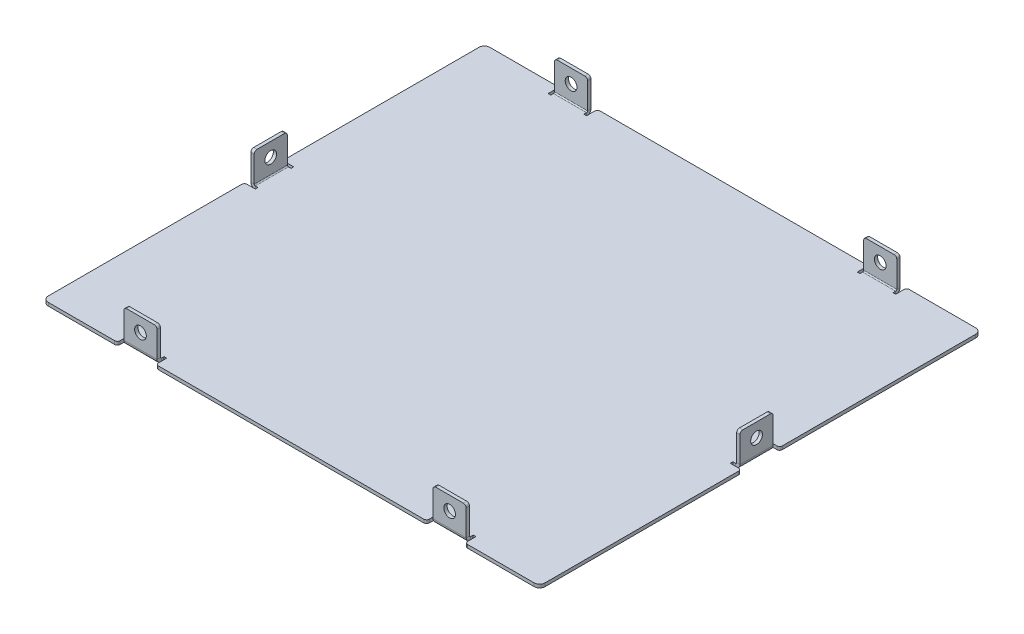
ISO-10303-21;
HEADER;
FILE_DESCRIPTION(('STEP AP214'),'2;1');
FILE_NAME('part.step','',(''),(''),'','','');
FILE_SCHEMA(('AUTOMOTIVE_DESIGN { 1 0 10303 214 1 1 1 1 }'));
ENDSEC;
DATA;
#1=APPLICATION_CONTEXT('core data for automotive mechanical design processes');
#2=APPLICATION_PROTOCOL_DEFINITION('international standard','automotive_design',2000,#1);
#3=PRODUCT_CONTEXT('',#1,'mechanical');
#4=PRODUCT('Part','Part','',(#3));
#5=PRODUCT_RELATED_PRODUCT_CATEGORY('part','',(#4));
#6=PRODUCT_DEFINITION_FORMATION('','',#4);
#7=PRODUCT_DEFINITION_CONTEXT('part definition',#1,'design');
#8=PRODUCT_DEFINITION('design','',#6,#7);
#9=PRODUCT_DEFINITION_SHAPE('','',#8);
#10=(LENGTH_UNIT() NAMED_UNIT(*) SI_UNIT(.MILLI.,.METRE.));
#11=(NAMED_UNIT(*) PLANE_ANGLE_UNIT() SI_UNIT($,.RADIAN.));
#12=(NAMED_UNIT(*) SI_UNIT($,.STERADIAN.) SOLID_ANGLE_UNIT());
#13=UNCERTAINTY_MEASURE_WITH_UNIT(LENGTH_MEASURE(1.E-05),#10,'distance_accuracy_value','');
#14=(GEOMETRIC_REPRESENTATION_CONTEXT(3) GLOBAL_UNCERTAINTY_ASSIGNED_CONTEXT((#13)) GLOBAL_UNIT_ASSIGNED_CONTEXT((#10,
#11,#12)) REPRESENTATION_CONTEXT('',''));
#15=CARTESIAN_POINT('',(0.,0.,0.));
#16=DIRECTION('',(0.,0.,1.));
#17=DIRECTION('',(1.,0.,0.));
#18=AXIS2_PLACEMENT_3D('',#15,#16,#17);
#19=CARTESIAN_POINT('',(0.,-1.2,0.));
#20=DIRECTION('',(0.,1.,0.));
#21=DIRECTION('',(0.,0.,1.));
#22=AXIS2_PLACEMENT_3D('',#19,#20,#21);
#23=PLANE('',#22);
#24=DIRECTION('',(1.,0.,0.));
#25=VECTOR('',#24,1.);
#26=CARTESIAN_POINT('',(0.,-1.2,-6.96));
#27=LINE('',#26,#25);
#28=CARTESIAN_POINT('',(-89.,-1.2,-6.96));
#29=VERTEX_POINT('',#28);
#30=CARTESIAN_POINT('',(-86.04,-1.2,-6.96));
#31=VERTEX_POINT('',#30);
#32=EDGE_CURVE('E1115',#29,#31,#27,.T.);
#33=ORIENTED_EDGE('',*,*,#32,.F.);
#34=CARTESIAN_POINT('',(-89.,-1.2,-7.96));
#35=DIRECTION('',(0.,1.,0.));
#36=DIRECTION('',(0.,0.,1.));
#37=AXIS2_PLACEMENT_3D('',#34,#35,#36);
#38=CIRCLE('',#37,1.);
#39=CARTESIAN_POINT('',(-90.,-1.2,-7.95999999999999));
#40=VERTEX_POINT('',#39);
#41=EDGE_CURVE('E1506',#29,#40,#38,.F.);
#42=ORIENTED_EDGE('',*,*,#41,.T.);
#43=DIRECTION('',(0.,0.,1.));
#44=VECTOR('',#43,1.);
#45=CARTESIAN_POINT('',(-90.,-1.2,-80.));
#46=LINE('',#45,#44);
#47=CARTESIAN_POINT('',(-90.,-1.2,-78.));
#48=VERTEX_POINT('',#47);
#49=EDGE_CURVE('E1399',#48,#40,#46,.T.);
#50=ORIENTED_EDGE('',*,*,#49,.F.);
#51=CARTESIAN_POINT('',(-88.,-1.2,-78.));
#52=DIRECTION('',(0.,1.,0.));
#53=DIRECTION('',(0.,0.,1.));
#54=AXIS2_PLACEMENT_3D('',#51,#52,#53);
#55=CIRCLE('',#54,2.);
#56=CARTESIAN_POINT('',(-88.,-1.2,-80.));
#57=VERTEX_POINT('',#56);
#58=EDGE_CURVE('E1451',#48,#57,#55,.F.);
#59=ORIENTED_EDGE('',*,*,#58,.T.);
#60=DIRECTION('',(-1.,0.,0.));
#61=VECTOR('',#60,1.);
#62=CARTESIAN_POINT('',(-90.,-1.2,-80.));
#63=LINE('',#62,#61);
#64=CARTESIAN_POINT('',(-63.96,-1.2,-80.));
#65=VERTEX_POINT('',#64);
#66=EDGE_CURVE('E1392',#65,#57,#63,.T.);
#67=ORIENTED_EDGE('',*,*,#66,.F.);
#68=CARTESIAN_POINT('',(-63.96,-1.2,-79.));
#69=DIRECTION('',(0.,1.,0.));
#70=DIRECTION('',(0.,0.,1.));
#71=AXIS2_PLACEMENT_3D('',#68,#69,#70);
#72=CIRCLE('',#71,1.);
#73=CARTESIAN_POINT('',(-62.96,-1.2,-79.));
#74=VERTEX_POINT('',#73);
#75=EDGE_CURVE('E1486',#65,#74,#72,.F.);
#76=ORIENTED_EDGE('',*,*,#75,.T.);
#77=DIRECTION('',(0.,0.,-1.));
#78=VECTOR('',#77,1.);
#79=CARTESIAN_POINT('',(-62.96,-1.2,0.));
#80=LINE('',#79,#78);
#81=CARTESIAN_POINT('',(-62.96,-1.2,-76.04));
#82=VERTEX_POINT('',#81);
#83=EDGE_CURVE('E1385',#82,#74,#80,.T.);
#84=ORIENTED_EDGE('',*,*,#83,.F.);
#85=DIRECTION('',(-1.,0.,0.));
#86=VECTOR('',#85,1.);
#87=CARTESIAN_POINT('',(0.,-1.2,-76.04));
#88=LINE('',#87,#86);
#89=CARTESIAN_POINT('',(-62.,-1.2,-76.04));
#90=VERTEX_POINT('',#89);
#91=EDGE_CURVE('E1382',#90,#82,#88,.T.);
#92=ORIENTED_EDGE('',*,*,#91,.F.);
#93=DIRECTION('',(0.,0.,1.));
#94=VECTOR('',#93,1.);
#95=CARTESIAN_POINT('',(-62.,-1.2,0.));
#96=LINE('',#95,#94);
#97=CARTESIAN_POINT('',(-62.,-1.2,-77.));
#98=VERTEX_POINT('',#97);
#99=EDGE_CURVE('E1379',#98,#90,#96,.T.);
#100=ORIENTED_EDGE('',*,*,#99,.F.);
#101=DIRECTION('',(-1.,0.,0.));
#102=VECTOR('',#101,1.);
#103=CARTESIAN_POINT('',(-62.,-1.2,-77.));
#104=LINE('',#103,#102);
#105=CARTESIAN_POINT('',(-50.,-1.2,-77.));
#106=VERTEX_POINT('',#105);
#107=EDGE_CURVE('E1091',#98,#106,#104,.F.);
#108=ORIENTED_EDGE('',*,*,#107,.T.);
#109=DIRECTION('',(0.,0.,-1.));
#110=VECTOR('',#109,1.);
#111=CARTESIAN_POINT('',(-50.,-1.2,0.));
#112=LINE('',#111,#110);
#113=CARTESIAN_POINT('',(-50.,-1.2,-76.04));
#114=VERTEX_POINT('',#113);
#115=EDGE_CURVE('E1376',#114,#106,#112,.T.);
#116=ORIENTED_EDGE('',*,*,#115,.F.);
#117=DIRECTION('',(-1.,0.,0.));
#118=VECTOR('',#117,1.);
#119=CARTESIAN_POINT('',(0.,-1.2,-76.04));
#120=LINE('',#119,#118);
#121=CARTESIAN_POINT('',(-49.04,-1.2,-76.04));
#122=VERTEX_POINT('',#121);
#123=EDGE_CURVE('E1373',#122,#114,#120,.T.);
#124=ORIENTED_EDGE('',*,*,#123,.F.);
#125=DIRECTION('',(0.,0.,1.));
#126=VECTOR('',#125,1.);
#127=CARTESIAN_POINT('',(-49.04,-1.2,0.));
#128=LINE('',#127,#126);
#129=CARTESIAN_POINT('',(-49.04,-1.2,-79.));
#130=VERTEX_POINT('',#129);
#131=EDGE_CURVE('E1345',#130,#122,#128,.T.);
#132=ORIENTED_EDGE('',*,*,#131,.F.);
#133=CARTESIAN_POINT('',(-48.04,-1.2,-79.));
#134=DIRECTION('',(0.,1.,0.));
#135=DIRECTION('',(0.,0.,1.));
#136=AXIS2_PLACEMENT_3D('',#133,#134,#135);
#137=CIRCLE('',#136,1.);
#138=CARTESIAN_POINT('',(-48.04,-1.2,-80.));
#139=VERTEX_POINT('',#138);
#140=EDGE_CURVE('E1484',#130,#139,#137,.F.);
#141=ORIENTED_EDGE('',*,*,#140,.T.);
#142=CARTESIAN_POINT('',(48.04,-1.2,-80.));
#143=VERTEX_POINT('',#142);
#144=EDGE_CURVE('E1398',#143,#139,#63,.T.);
#145=ORIENTED_EDGE('',*,*,#144,.F.);
#146=CARTESIAN_POINT('',(48.04,-1.2,-79.));
#147=DIRECTION('',(0.,1.,0.));
#148=DIRECTION('',(0.,0.,1.));
#149=AXIS2_PLACEMENT_3D('',#146,#147,#148);
#150=CIRCLE('',#149,1.);
#151=CARTESIAN_POINT('',(49.04,-1.2,-79.));
#152=VERTEX_POINT('',#151);
#153=EDGE_CURVE('E1488',#143,#152,#150,.F.);
#154=ORIENTED_EDGE('',*,*,#153,.T.);
#155=DIRECTION('',(0.,0.,-1.));
#156=VECTOR('',#155,1.);
#157=CARTESIAN_POINT('',(49.04,-1.2,0.));
#158=LINE('',#157,#156);
#159=CARTESIAN_POINT('',(49.04,-1.2,-76.04));
#160=VERTEX_POINT('',#159);
#161=EDGE_CURVE('E1339',#160,#152,#158,.T.);
#162=ORIENTED_EDGE('',*,*,#161,.F.);
#163=DIRECTION('',(-1.,0.,0.));
#164=VECTOR('',#163,1.);
#165=CARTESIAN_POINT('',(0.,-1.2,-76.04));
#166=LINE('',#165,#164);
#167=CARTESIAN_POINT('',(50.,-1.2,-76.04));
#168=VERTEX_POINT('',#167);
#169=EDGE_CURVE('E1336',#168,#160,#166,.T.);
#170=ORIENTED_EDGE('',*,*,#169,.F.);
#171=DIRECTION('',(0.,0.,1.));
#172=VECTOR('',#171,1.);
#173=CARTESIAN_POINT('',(50.,-1.2,0.));
#174=LINE('',#173,#172);
#175=CARTESIAN_POINT('',(50.,-1.2,-77.));
#176=VERTEX_POINT('',#175);
#177=EDGE_CURVE('E1333',#176,#168,#174,.T.);
#178=ORIENTED_EDGE('',*,*,#177,.F.);
#179=DIRECTION('',(-1.,0.,0.));
#180=VECTOR('',#179,1.);
#181=CARTESIAN_POINT('',(50.,-1.2,-77.));
#182=LINE('',#181,#180);
#183=CARTESIAN_POINT('',(62.,-1.2,-77.));
#184=VERTEX_POINT('',#183);
#185=EDGE_CURVE('E1042',#176,#184,#182,.F.);
#186=ORIENTED_EDGE('',*,*,#185,.T.);
#187=DIRECTION('',(0.,0.,-1.));
#188=VECTOR('',#187,1.);
#189=CARTESIAN_POINT('',(62.,-1.2,0.));
#190=LINE('',#189,#188);
#191=CARTESIAN_POINT('',(62.,-1.2,-76.04));
#192=VERTEX_POINT('',#191);
#193=EDGE_CURVE('E1330',#192,#184,#190,.T.);
#194=ORIENTED_EDGE('',*,*,#193,.F.);
#195=DIRECTION('',(-1.,0.,0.));
#196=VECTOR('',#195,1.);
#197=CARTESIAN_POINT('',(0.,-1.2,-76.04));
#198=LINE('',#197,#196);
#199=CARTESIAN_POINT('',(62.96,-1.2,-76.04));
#200=VERTEX_POINT('',#199);
#201=EDGE_CURVE('E1327',#200,#192,#198,.T.);
#202=ORIENTED_EDGE('',*,*,#201,.F.);
#203=DIRECTION('',(0.,0.,1.));
#204=VECTOR('',#203,1.);
#205=CARTESIAN_POINT('',(62.96,-1.2,0.));
#206=LINE('',#205,#204);
#207=CARTESIAN_POINT('',(62.96,-1.2,-79.));
#208=VERTEX_POINT('',#207);
#209=EDGE_CURVE('E1299',#208,#200,#206,.T.);
#210=ORIENTED_EDGE('',*,*,#209,.F.);
#211=CARTESIAN_POINT('',(63.96,-1.2,-79.));
#212=DIRECTION('',(0.,1.,0.));
#213=DIRECTION('',(0.,0.,1.));
#214=AXIS2_PLACEMENT_3D('',#211,#212,#213);
#215=CIRCLE('',#214,1.);
#216=CARTESIAN_POINT('',(63.96,-1.2,-80.));
#217=VERTEX_POINT('',#216);
#218=EDGE_CURVE('E1490',#208,#217,#215,.F.);
#219=ORIENTED_EDGE('',*,*,#218,.T.);
#220=CARTESIAN_POINT('',(87.9999999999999,-1.2,-80.));
#221=VERTEX_POINT('',#220);
#222=EDGE_CURVE('E1394',#221,#217,#63,.T.);
#223=ORIENTED_EDGE('',*,*,#222,.F.);
#224=CARTESIAN_POINT('',(88.,-1.2,-78.));
#225=DIRECTION('',(0.,1.,0.));
#226=DIRECTION('',(0.,0.,1.));
#227=AXIS2_PLACEMENT_3D('',#224,#225,#226);
#228=CIRCLE('',#227,2.);
#229=CARTESIAN_POINT('',(90.,-1.2,-78.));
#230=VERTEX_POINT('',#229);
#231=EDGE_CURVE('E1448',#221,#230,#228,.F.);
#232=ORIENTED_EDGE('',*,*,#231,.T.);
#233=DIRECTION('',(0.,0.,-1.));
#234=VECTOR('',#233,1.);
#235=CARTESIAN_POINT('',(90.,-1.2,-80.));
#236=LINE('',#235,#234);
#237=CARTESIAN_POINT('',(90.,-1.2,-7.95999999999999));
#238=VERTEX_POINT('',#237);
#239=EDGE_CURVE('E1393',#238,#230,#236,.T.);
#240=ORIENTED_EDGE('',*,*,#239,.F.);
#241=CARTESIAN_POINT('',(89.,-1.2,-7.95999999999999));
#242=DIRECTION('',(0.,1.,0.));
#243=DIRECTION('',(0.,0.,1.));
#244=AXIS2_PLACEMENT_3D('',#241,#242,#243);
#245=CIRCLE('',#244,1.);
#246=CARTESIAN_POINT('',(89.,-1.2,-6.96));
#247=VERTEX_POINT('',#246);
#248=EDGE_CURVE('E1492',#238,#247,#245,.F.);
#249=ORIENTED_EDGE('',*,*,#248,.T.);
#250=DIRECTION('',(1.,0.,0.));
#251=VECTOR('',#250,1.);
#252=CARTESIAN_POINT('',(0.,-1.2,-6.96));
#253=LINE('',#252,#251);
#254=CARTESIAN_POINT('',(86.04,-1.2,-6.96));
#255=VERTEX_POINT('',#254);
#256=EDGE_CURVE('E1293',#255,#247,#253,.T.);
#257=ORIENTED_EDGE('',*,*,#256,.F.);
#258=DIRECTION('',(0.,0.,-1.));
#259=VECTOR('',#258,1.);
#260=CARTESIAN_POINT('',(86.04,-1.2,0.));
#261=LINE('',#260,#259);
#262=CARTESIAN_POINT('',(86.04,-1.2,-6.));
#263=VERTEX_POINT('',#262);
#264=EDGE_CURVE('E1290',#263,#255,#261,.T.);
#265=ORIENTED_EDGE('',*,*,#264,.F.);
#266=DIRECTION('',(-1.,0.,0.));
#267=VECTOR('',#266,1.);
#268=CARTESIAN_POINT('',(0.,-1.2,-6.));
#269=LINE('',#268,#267);
#270=CARTESIAN_POINT('',(87.,-1.2,-6.));
#271=VERTEX_POINT('',#270);
#272=EDGE_CURVE('E1287',#271,#263,#269,.T.);
#273=ORIENTED_EDGE('',*,*,#272,.F.);
#274=DIRECTION('',(0.,0.,-1.));
#275=VECTOR('',#274,1.);
#276=CARTESIAN_POINT('',(87.,-1.2,-6.));
#277=LINE('',#276,#275);
#278=CARTESIAN_POINT('',(87.,-1.2,6.));
#279=VERTEX_POINT('',#278);
#280=EDGE_CURVE('E993',#271,#279,#277,.F.);
#281=ORIENTED_EDGE('',*,*,#280,.T.);
#282=DIRECTION('',(1.,0.,0.));
#283=VECTOR('',#282,1.);
#284=CARTESIAN_POINT('',(0.,-1.2,6.));
#285=LINE('',#284,#283);
#286=CARTESIAN_POINT('',(86.04,-1.2,6.));
#287=VERTEX_POINT('',#286);
#288=EDGE_CURVE('E1284',#287,#279,#285,.T.);
#289=ORIENTED_EDGE('',*,*,#288,.F.);
#290=DIRECTION('',(0.,0.,-1.));
#291=VECTOR('',#290,1.);
#292=CARTESIAN_POINT('',(86.04,-1.2,0.));
#293=LINE('',#292,#291);
#294=CARTESIAN_POINT('',(86.04,-1.2,6.96));
#295=VERTEX_POINT('',#294);
#296=EDGE_CURVE('E1281',#295,#287,#293,.T.);
#297=ORIENTED_EDGE('',*,*,#296,.F.);
#298=DIRECTION('',(-1.,0.,0.));
#299=VECTOR('',#298,1.);
#300=CARTESIAN_POINT('',(0.,-1.2,6.96));
#301=LINE('',#300,#299);
#302=CARTESIAN_POINT('',(89.,-1.2,6.96));
#303=VERTEX_POINT('',#302);
#304=EDGE_CURVE('E1253',#303,#295,#301,.T.);
#305=ORIENTED_EDGE('',*,*,#304,.F.);
#306=CARTESIAN_POINT('',(89.,-1.2,7.96));
#307=DIRECTION('',(0.,1.,0.));
#308=DIRECTION('',(0.,0.,1.));
#309=AXIS2_PLACEMENT_3D('',#306,#307,#308);
#310=CIRCLE('',#309,1.);
#311=CARTESIAN_POINT('',(90.,-1.2,7.95999999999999));
#312=VERTEX_POINT('',#311);
#313=EDGE_CURVE('E1494',#303,#312,#310,.F.);
#314=ORIENTED_EDGE('',*,*,#313,.T.);
#315=CARTESIAN_POINT('',(90.,-1.2,78.));
#316=VERTEX_POINT('',#315);
#317=EDGE_CURVE('E1389',#316,#312,#236,.T.);
#318=ORIENTED_EDGE('',*,*,#317,.F.);
#319=CARTESIAN_POINT('',(88.,-1.2,78.));
#320=DIRECTION('',(0.,1.,0.));
#321=DIRECTION('',(0.,0.,1.));
#322=AXIS2_PLACEMENT_3D('',#319,#320,#321);
#323=CIRCLE('',#322,2.);
#324=CARTESIAN_POINT('',(87.9999999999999,-1.2,80.));
#325=VERTEX_POINT('',#324);
#326=EDGE_CURVE('E1445',#316,#325,#323,.F.);
#327=ORIENTED_EDGE('',*,*,#326,.T.);
#328=DIRECTION('',(1.,0.,0.));
#329=VECTOR('',#328,1.);
#330=CARTESIAN_POINT('',(-90.,-1.2,80.));
#331=LINE('',#330,#329);
#332=CARTESIAN_POINT('',(63.96,-1.2,80.));
#333=VERTEX_POINT('',#332);
#334=EDGE_CURVE('E1402',#333,#325,#331,.T.);
#335=ORIENTED_EDGE('',*,*,#334,.F.);
#336=CARTESIAN_POINT('',(63.96,-1.2,79.));
#337=DIRECTION('',(0.,1.,0.));
#338=DIRECTION('',(0.,0.,1.));
#339=AXIS2_PLACEMENT_3D('',#336,#337,#338);
#340=CIRCLE('',#339,1.);
#341=CARTESIAN_POINT('',(62.96,-1.2,79.));
#342=VERTEX_POINT('',#341);
#343=EDGE_CURVE('E1496',#333,#342,#340,.F.);
#344=ORIENTED_EDGE('',*,*,#343,.T.);
#345=DIRECTION('',(0.,0.,1.));
#346=VECTOR('',#345,1.);
#347=CARTESIAN_POINT('',(62.96,-1.2,0.));
#348=LINE('',#347,#346);
#349=CARTESIAN_POINT('',(62.96,-1.2,76.04));
#350=VERTEX_POINT('',#349);
#351=EDGE_CURVE('E1247',#350,#342,#348,.T.);
#352=ORIENTED_EDGE('',*,*,#351,.F.);
#353=DIRECTION('',(1.,0.,0.));
#354=VECTOR('',#353,1.);
#355=CARTESIAN_POINT('',(0.,-1.2,76.04));
#356=LINE('',#355,#354);
#357=CARTESIAN_POINT('',(62.,-1.2,76.04));
#358=VERTEX_POINT('',#357);
#359=EDGE_CURVE('E1244',#358,#350,#356,.T.);
#360=ORIENTED_EDGE('',*,*,#359,.F.);
#361=DIRECTION('',(0.,0.,-1.));
#362=VECTOR('',#361,1.);
#363=CARTESIAN_POINT('',(62.,-1.2,0.));
#364=LINE('',#363,#362);
#365=CARTESIAN_POINT('',(62.,-1.2,77.));
#366=VERTEX_POINT('',#365);
#367=EDGE_CURVE('E1241',#366,#358,#364,.T.);
#368=ORIENTED_EDGE('',*,*,#367,.F.);
#369=DIRECTION('',(1.,0.,0.));
#370=VECTOR('',#369,1.);
#371=CARTESIAN_POINT('',(62.,-1.2,77.));
#372=LINE('',#371,#370);
#373=CARTESIAN_POINT('',(50.,-1.2,77.));
#374=VERTEX_POINT('',#373);
#375=EDGE_CURVE('E944',#366,#374,#372,.F.);
#376=ORIENTED_EDGE('',*,*,#375,.T.);
#377=DIRECTION('',(0.,0.,1.));
#378=VECTOR('',#377,1.);
#379=CARTESIAN_POINT('',(50.,-1.2,0.));
#380=LINE('',#379,#378);
#381=CARTESIAN_POINT('',(50.,-1.2,76.04));
#382=VERTEX_POINT('',#381);
#383=EDGE_CURVE('E1238',#382,#374,#380,.T.);
#384=ORIENTED_EDGE('',*,*,#383,.F.);
#385=DIRECTION('',(1.,0.,0.));
#386=VECTOR('',#385,1.);
#387=CARTESIAN_POINT('',(0.,-1.2,76.04));
#388=LINE('',#387,#386);
#389=CARTESIAN_POINT('',(49.04,-1.2,76.04));
#390=VERTEX_POINT('',#389);
#391=EDGE_CURVE('E1235',#390,#382,#388,.T.);
#392=ORIENTED_EDGE('',*,*,#391,.F.);
#393=DIRECTION('',(0.,0.,-1.));
#394=VECTOR('',#393,1.);
#395=CARTESIAN_POINT('',(49.04,-1.2,0.));
#396=LINE('',#395,#394);
#397=CARTESIAN_POINT('',(49.04,-1.2,79.));
#398=VERTEX_POINT('',#397);
#399=EDGE_CURVE('E1207',#398,#390,#396,.T.);
#400=ORIENTED_EDGE('',*,*,#399,.F.);
#401=CARTESIAN_POINT('',(48.04,-1.2,79.));
#402=DIRECTION('',(0.,1.,0.));
#403=DIRECTION('',(0.,0.,1.));
#404=AXIS2_PLACEMENT_3D('',#401,#402,#403);
#405=CIRCLE('',#404,1.);
#406=CARTESIAN_POINT('',(48.04,-1.2,80.));
#407=VERTEX_POINT('',#406);
#408=EDGE_CURVE('E1498',#398,#407,#405,.F.);
#409=ORIENTED_EDGE('',*,*,#408,.T.);
#410=CARTESIAN_POINT('',(-48.04,-1.2,80.));
#411=VERTEX_POINT('',#410);
#412=EDGE_CURVE('E1407',#411,#407,#331,.T.);
#413=ORIENTED_EDGE('',*,*,#412,.F.);
#414=CARTESIAN_POINT('',(-48.04,-1.2,79.));
#415=DIRECTION('',(0.,1.,0.));
#416=DIRECTION('',(0.,0.,1.));
#417=AXIS2_PLACEMENT_3D('',#414,#415,#416);
#418=CIRCLE('',#417,1.);
#419=CARTESIAN_POINT('',(-49.04,-1.2,79.));
#420=VERTEX_POINT('',#419);
#421=EDGE_CURVE('E1500',#411,#420,#418,.F.);
#422=ORIENTED_EDGE('',*,*,#421,.T.);
#423=DIRECTION('',(0.,0.,1.));
#424=VECTOR('',#423,1.);
#425=CARTESIAN_POINT('',(-49.04,-1.2,0.));
#426=LINE('',#425,#424);
#427=CARTESIAN_POINT('',(-49.04,-1.2,76.04));
#428=VERTEX_POINT('',#427);
#429=EDGE_CURVE('E1201',#428,#420,#426,.T.);
#430=ORIENTED_EDGE('',*,*,#429,.F.);
#431=DIRECTION('',(1.,0.,0.));
#432=VECTOR('',#431,1.);
#433=CARTESIAN_POINT('',(0.,-1.2,76.04));
#434=LINE('',#433,#432);
#435=CARTESIAN_POINT('',(-50.,-1.2,76.04));
#436=VERTEX_POINT('',#435);
#437=EDGE_CURVE('E1198',#436,#428,#434,.T.);
#438=ORIENTED_EDGE('',*,*,#437,.F.);
#439=DIRECTION('',(0.,0.,-1.));
#440=VECTOR('',#439,1.);
#441=CARTESIAN_POINT('',(-50.,-1.2,0.));
#442=LINE('',#441,#440);
#443=CARTESIAN_POINT('',(-50.,-1.2,77.));
#444=VERTEX_POINT('',#443);
#445=EDGE_CURVE('E1195',#444,#436,#442,.T.);
#446=ORIENTED_EDGE('',*,*,#445,.F.);
#447=DIRECTION('',(1.,0.,0.));
#448=VECTOR('',#447,1.);
#449=CARTESIAN_POINT('',(-50.,-1.2,77.));
#450=LINE('',#449,#448);
#451=CARTESIAN_POINT('',(-62.,-1.2,77.));
#452=VERTEX_POINT('',#451);
#453=EDGE_CURVE('E895',#444,#452,#450,.F.);
#454=ORIENTED_EDGE('',*,*,#453,.T.);
#455=DIRECTION('',(0.,0.,1.));
#456=VECTOR('',#455,1.);
#457=CARTESIAN_POINT('',(-62.,-1.2,0.));
#458=LINE('',#457,#456);
#459=CARTESIAN_POINT('',(-62.,-1.2,76.04));
#460=VERTEX_POINT('',#459);
#461=EDGE_CURVE('E1192',#460,#452,#458,.T.);
#462=ORIENTED_EDGE('',*,*,#461,.F.);
#463=DIRECTION('',(1.,0.,0.));
#464=VECTOR('',#463,1.);
#465=CARTESIAN_POINT('',(0.,-1.2,76.04));
#466=LINE('',#465,#464);
#467=CARTESIAN_POINT('',(-62.96,-1.2,76.04));
#468=VERTEX_POINT('',#467);
#469=EDGE_CURVE('E1189',#468,#460,#466,.T.);
#470=ORIENTED_EDGE('',*,*,#469,.F.);
#471=DIRECTION('',(0.,0.,-1.));
#472=VECTOR('',#471,1.);
#473=CARTESIAN_POINT('',(-62.96,-1.2,0.));
#474=LINE('',#473,#472);
#475=CARTESIAN_POINT('',(-62.96,-1.2,79.));
#476=VERTEX_POINT('',#475);
#477=EDGE_CURVE('E1161',#476,#468,#474,.T.);
#478=ORIENTED_EDGE('',*,*,#477,.F.);
#479=CARTESIAN_POINT('',(-63.96,-1.2,79.));
#480=DIRECTION('',(0.,1.,0.));
#481=DIRECTION('',(0.,0.,1.));
#482=AXIS2_PLACEMENT_3D('',#479,#480,#481);
#483=CIRCLE('',#482,1.);
#484=CARTESIAN_POINT('',(-63.96,-1.2,80.));
#485=VERTEX_POINT('',#484);
#486=EDGE_CURVE('E1502',#476,#485,#483,.F.);
#487=ORIENTED_EDGE('',*,*,#486,.T.);
#488=CARTESIAN_POINT('',(-88.,-1.2,80.));
#489=VERTEX_POINT('',#488);
#490=EDGE_CURVE('E1403',#489,#485,#331,.T.);
#491=ORIENTED_EDGE('',*,*,#490,.F.);
#492=CARTESIAN_POINT('',(-88.,-1.2,78.));
#493=DIRECTION('',(0.,1.,0.));
#494=DIRECTION('',(0.,0.,1.));
#495=AXIS2_PLACEMENT_3D('',#492,#493,#494);
#496=CIRCLE('',#495,2.);
#497=CARTESIAN_POINT('',(-90.,-1.2,78.));
#498=VERTEX_POINT('',#497);
#499=EDGE_CURVE('E1442',#489,#498,#496,.F.);
#500=ORIENTED_EDGE('',*,*,#499,.T.);
#501=CARTESIAN_POINT('',(-90.,-1.2,7.95999999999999));
#502=VERTEX_POINT('',#501);
#503=EDGE_CURVE('E1397',#502,#498,#46,.T.);
#504=ORIENTED_EDGE('',*,*,#503,.F.);
#505=CARTESIAN_POINT('',(-89.,-1.2,7.95999999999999));
#506=DIRECTION('',(0.,1.,0.));
#507=DIRECTION('',(0.,0.,1.));
#508=AXIS2_PLACEMENT_3D('',#505,#506,#507);
#509=CIRCLE('',#508,1.);
#510=CARTESIAN_POINT('',(-89.,-1.2,6.96));
#511=VERTEX_POINT('',#510);
#512=EDGE_CURVE('E1504',#502,#511,#509,.F.);
#513=ORIENTED_EDGE('',*,*,#512,.T.);
#514=DIRECTION('',(-1.,0.,0.));
#515=VECTOR('',#514,1.);
#516=CARTESIAN_POINT('',(0.,-1.2,6.96));
#517=LINE('',#516,#515);
#518=CARTESIAN_POINT('',(-86.04,-1.2,6.96));
#519=VERTEX_POINT('',#518);
#520=EDGE_CURVE('E1155',#519,#511,#517,.T.);
#521=ORIENTED_EDGE('',*,*,#520,.F.);
#522=DIRECTION('',(0.,0.,1.));
#523=VECTOR('',#522,1.);
#524=CARTESIAN_POINT('',(-86.04,-1.2,0.));
#525=LINE('',#524,#523);
#526=CARTESIAN_POINT('',(-86.04,-1.2,6.));
#527=VERTEX_POINT('',#526);
#528=EDGE_CURVE('E1152',#527,#519,#525,.T.);
#529=ORIENTED_EDGE('',*,*,#528,.F.);
#530=DIRECTION('',(1.,0.,0.));
#531=VECTOR('',#530,1.);
#532=CARTESIAN_POINT('',(0.,-1.2,6.));
#533=LINE('',#532,#531);
#534=CARTESIAN_POINT('',(-87.,-1.2,6.));
#535=VERTEX_POINT('',#534);
#536=EDGE_CURVE('E1149',#535,#527,#533,.T.);
#537=ORIENTED_EDGE('',*,*,#536,.F.);
#538=DIRECTION('',(0.,0.,1.));
#539=VECTOR('',#538,1.);
#540=CARTESIAN_POINT('',(-87.,-1.2,6.));
#541=LINE('',#540,#539);
#542=CARTESIAN_POINT('',(-87.,-1.2,-6.));
#543=VERTEX_POINT('',#542);
#544=EDGE_CURVE('E825',#535,#543,#541,.F.);
#545=ORIENTED_EDGE('',*,*,#544,.T.);
#546=DIRECTION('',(-1.,0.,0.));
#547=VECTOR('',#546,1.);
#548=CARTESIAN_POINT('',(0.,-1.2,-6.));
#549=LINE('',#548,#547);
#550=CARTESIAN_POINT('',(-86.04,-1.2,-6.));
#551=VERTEX_POINT('',#550);
#552=EDGE_CURVE('E1146',#551,#543,#549,.T.);
#553=ORIENTED_EDGE('',*,*,#552,.F.);
#554=DIRECTION('',(0.,0.,1.));
#555=VECTOR('',#554,1.);
#556=CARTESIAN_POINT('',(-86.04,-1.2,0.));
#557=LINE('',#556,#555);
#558=EDGE_CURVE('E1143',#31,#551,#557,.T.);
#559=ORIENTED_EDGE('',*,*,#558,.F.);
#560=EDGE_LOOP('',(#33,#42,#50,#59,#67,#76,#84,#92,#100,#108,#116,#124,#132,#141,#145,#154,#162,
#170,#178,#186,#194,#202,#210,#219,#223,#232,#240,#249,#257,#265,#273,#281,#289,#297,#305,#314,
#318,#327,#335,#344,#352,#360,#368,#376,#384,#392,#400,#409,#413,#422,#430,#438,#446,#454,#462,
#470,#478,#487,#491,#500,#504,#513,#521,#529,#537,#545,#553,#559));
#561=FACE_BOUND('',#560,.T.);
#562=ADVANCED_FACE('F158',(#561),#23,.F.);
#563=CARTESIAN_POINT('',(0.,0.,0.));
#564=DIRECTION('',(0.,1.,0.));
#565=DIRECTION('',(0.,0.,1.));
#566=AXIS2_PLACEMENT_3D('',#563,#564,#565);
#567=PLANE('',#566);
#568=DIRECTION('',(0.,0.,1.));
#569=VECTOR('',#568,1.);
#570=CARTESIAN_POINT('',(-90.,0.,-80.));
#571=LINE('',#570,#569);
#572=CARTESIAN_POINT('',(-90.,0.,-78.));
#573=VERTEX_POINT('',#572);
#574=CARTESIAN_POINT('',(-90.,0.,-7.95999999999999));
#575=VERTEX_POINT('',#574);
#576=EDGE_CURVE('E1417',#573,#575,#571,.T.);
#577=ORIENTED_EDGE('',*,*,#576,.T.);
#578=CARTESIAN_POINT('',(-89.,0.,-7.96));
#579=DIRECTION('',(0.,1.,0.));
#580=DIRECTION('',(0.,0.,1.));
#581=AXIS2_PLACEMENT_3D('',#578,#579,#580);
#582=CIRCLE('',#581,1.);
#583=CARTESIAN_POINT('',(-89.,0.,-6.96));
#584=VERTEX_POINT('',#583);
#585=EDGE_CURVE('E1532',#575,#584,#582,.T.);
#586=ORIENTED_EDGE('',*,*,#585,.T.);
#587=DIRECTION('',(-1.,0.,0.));
#588=VECTOR('',#587,1.);
#589=CARTESIAN_POINT('',(-86.04,0.,-6.96));
#590=LINE('',#589,#588);
#591=CARTESIAN_POINT('',(-86.04,0.,-6.96));
#592=VERTEX_POINT('',#591);
#593=EDGE_CURVE('E1131',#592,#584,#590,.T.);
#594=ORIENTED_EDGE('',*,*,#593,.F.);
#595=DIRECTION('',(0.,0.,-1.));
#596=VECTOR('',#595,1.);
#597=CARTESIAN_POINT('',(-86.04,0.,-6.));
#598=LINE('',#597,#596);
#599=CARTESIAN_POINT('',(-86.04,0.,-6.));
#600=VERTEX_POINT('',#599);
#601=EDGE_CURVE('E1127',#600,#592,#598,.T.);
#602=ORIENTED_EDGE('',*,*,#601,.F.);
#603=DIRECTION('',(1.,0.,0.));
#604=VECTOR('',#603,1.);
#605=CARTESIAN_POINT('',(-87.,0.,-6.));
#606=LINE('',#605,#604);
#607=CARTESIAN_POINT('',(-87.,0.,-6.));
#608=VERTEX_POINT('',#607);
#609=EDGE_CURVE('E1124',#608,#600,#606,.T.);
#610=ORIENTED_EDGE('',*,*,#609,.F.);
#611=DIRECTION('',(0.,0.,1.));
#612=VECTOR('',#611,1.);
#613=CARTESIAN_POINT('',(-87.,0.,6.));
#614=LINE('',#613,#612);
#615=CARTESIAN_POINT('',(-87.,0.,6.));
#616=VERTEX_POINT('',#615);
#617=EDGE_CURVE('E859',#616,#608,#614,.F.);
#618=ORIENTED_EDGE('',*,*,#617,.F.);
#619=DIRECTION('',(-1.,0.,0.));
#620=VECTOR('',#619,1.);
#621=CARTESIAN_POINT('',(-86.04,0.,6.));
#622=LINE('',#621,#620);
#623=CARTESIAN_POINT('',(-86.04,0.,6.));
#624=VERTEX_POINT('',#623);
#625=EDGE_CURVE('E1120',#624,#616,#622,.T.);
#626=ORIENTED_EDGE('',*,*,#625,.F.);
#627=DIRECTION('',(0.,0.,-1.));
#628=VECTOR('',#627,1.);
#629=CARTESIAN_POINT('',(-86.04,0.,6.96));
#630=LINE('',#629,#628);
#631=CARTESIAN_POINT('',(-86.04,0.,6.96));
#632=VERTEX_POINT('',#631);
#633=EDGE_CURVE('E1116',#632,#624,#630,.T.);
#634=ORIENTED_EDGE('',*,*,#633,.F.);
#635=DIRECTION('',(1.,0.,0.));
#636=VECTOR('',#635,1.);
#637=CARTESIAN_POINT('',(-88.6,0.,6.96));
#638=LINE('',#637,#636);
#639=CARTESIAN_POINT('',(-89.,0.,6.96));
#640=VERTEX_POINT('',#639);
#641=EDGE_CURVE('E1113',#640,#632,#638,.T.);
#642=ORIENTED_EDGE('',*,*,#641,.F.);
#643=CARTESIAN_POINT('',(-89.,0.,7.95999999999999));
#644=DIRECTION('',(0.,1.,0.));
#645=DIRECTION('',(0.,0.,1.));
#646=AXIS2_PLACEMENT_3D('',#643,#644,#645);
#647=CIRCLE('',#646,1.);
#648=CARTESIAN_POINT('',(-90.,0.,7.95999999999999));
#649=VERTEX_POINT('',#648);
#650=EDGE_CURVE('E1530',#640,#649,#647,.T.);
#651=ORIENTED_EDGE('',*,*,#650,.T.);
#652=CARTESIAN_POINT('',(-90.,0.,78.));
#653=VERTEX_POINT('',#652);
#654=EDGE_CURVE('E1415',#649,#653,#571,.T.);
#655=ORIENTED_EDGE('',*,*,#654,.T.);
#656=CARTESIAN_POINT('',(-88.,0.,78.));
#657=DIRECTION('',(0.,1.,0.));
#658=DIRECTION('',(0.,0.,1.));
#659=AXIS2_PLACEMENT_3D('',#656,#657,#658);
#660=CIRCLE('',#659,2.);
#661=CARTESIAN_POINT('',(-88.,0.,80.));
#662=VERTEX_POINT('',#661);
#663=EDGE_CURVE('E1429',#653,#662,#660,.T.);
#664=ORIENTED_EDGE('',*,*,#663,.T.);
#665=DIRECTION('',(1.,0.,0.));
#666=VECTOR('',#665,1.);
#667=CARTESIAN_POINT('',(-90.,0.,80.));
#668=LINE('',#667,#666);
#669=CARTESIAN_POINT('',(-63.96,0.,80.));
#670=VERTEX_POINT('',#669);
#671=EDGE_CURVE('E1421',#662,#670,#668,.T.);
#672=ORIENTED_EDGE('',*,*,#671,.T.);
#673=CARTESIAN_POINT('',(-63.96,0.,79.));
#674=DIRECTION('',(0.,1.,0.));
#675=DIRECTION('',(0.,0.,1.));
#676=AXIS2_PLACEMENT_3D('',#673,#674,#675);
#677=CIRCLE('',#676,1.);
#678=CARTESIAN_POINT('',(-62.96,0.,79.));
#679=VERTEX_POINT('',#678);
#680=EDGE_CURVE('E1528',#670,#679,#677,.T.);
#681=ORIENTED_EDGE('',*,*,#680,.T.);
#682=DIRECTION('',(0.,0.,1.));
#683=VECTOR('',#682,1.);
#684=CARTESIAN_POINT('',(-62.96,0.,76.04));
#685=LINE('',#684,#683);
#686=CARTESIAN_POINT('',(-62.96,0.,76.04));
#687=VERTEX_POINT('',#686);
#688=EDGE_CURVE('E1177',#687,#679,#685,.T.);
#689=ORIENTED_EDGE('',*,*,#688,.F.);
#690=DIRECTION('',(-1.,0.,0.));
#691=VECTOR('',#690,1.);
#692=CARTESIAN_POINT('',(-62.,0.,76.04));
#693=LINE('',#692,#691);
#694=CARTESIAN_POINT('',(-62.,0.,76.04));
#695=VERTEX_POINT('',#694);
#696=EDGE_CURVE('E1173',#695,#687,#693,.T.);
#697=ORIENTED_EDGE('',*,*,#696,.F.);
#698=DIRECTION('',(0.,0.,-1.));
#699=VECTOR('',#698,1.);
#700=CARTESIAN_POINT('',(-62.,0.,77.));
#701=LINE('',#700,#699);
#702=CARTESIAN_POINT('',(-62.,0.,77.));
#703=VERTEX_POINT('',#702);
#704=EDGE_CURVE('E1170',#703,#695,#701,.T.);
#705=ORIENTED_EDGE('',*,*,#704,.F.);
#706=DIRECTION('',(1.,0.,0.));
#707=VECTOR('',#706,1.);
#708=CARTESIAN_POINT('',(-50.,0.,77.));
#709=LINE('',#708,#707);
#710=CARTESIAN_POINT('',(-50.,0.,77.));
#711=VERTEX_POINT('',#710);
#712=EDGE_CURVE('E907',#711,#703,#709,.F.);
#713=ORIENTED_EDGE('',*,*,#712,.F.);
#714=DIRECTION('',(0.,0.,1.));
#715=VECTOR('',#714,1.);
#716=CARTESIAN_POINT('',(-50.,0.,76.04));
#717=LINE('',#716,#715);
#718=CARTESIAN_POINT('',(-50.,0.,76.04));
#719=VERTEX_POINT('',#718);
#720=EDGE_CURVE('E1166',#719,#711,#717,.T.);
#721=ORIENTED_EDGE('',*,*,#720,.F.);
#722=DIRECTION('',(-1.,0.,0.));
#723=VECTOR('',#722,1.);
#724=CARTESIAN_POINT('',(-49.04,0.,76.04));
#725=LINE('',#724,#723);
#726=CARTESIAN_POINT('',(-49.04,0.,76.04));
#727=VERTEX_POINT('',#726);
#728=EDGE_CURVE('E1162',#727,#719,#725,.T.);
#729=ORIENTED_EDGE('',*,*,#728,.F.);
#730=DIRECTION('',(0.,0.,-1.));
#731=VECTOR('',#730,1.);
#732=CARTESIAN_POINT('',(-49.04,0.,78.6));
#733=LINE('',#732,#731);
#734=CARTESIAN_POINT('',(-49.04,0.,79.));
#735=VERTEX_POINT('',#734);
#736=EDGE_CURVE('E1159',#735,#727,#733,.T.);
#737=ORIENTED_EDGE('',*,*,#736,.F.);
#738=CARTESIAN_POINT('',(-48.04,0.,79.));
#739=DIRECTION('',(0.,1.,0.));
#740=DIRECTION('',(0.,0.,1.));
#741=AXIS2_PLACEMENT_3D('',#738,#739,#740);
#742=CIRCLE('',#741,1.);
#743=CARTESIAN_POINT('',(-48.04,0.,80.));
#744=VERTEX_POINT('',#743);
#745=EDGE_CURVE('E1526',#735,#744,#742,.T.);
#746=ORIENTED_EDGE('',*,*,#745,.T.);
#747=CARTESIAN_POINT('',(48.04,0.,80.));
#748=VERTEX_POINT('',#747);
#749=EDGE_CURVE('E1424',#744,#748,#668,.T.);
#750=ORIENTED_EDGE('',*,*,#749,.T.);
#751=CARTESIAN_POINT('',(48.04,0.,79.));
#752=DIRECTION('',(0.,1.,0.));
#753=DIRECTION('',(0.,0.,1.));
#754=AXIS2_PLACEMENT_3D('',#751,#752,#753);
#755=CIRCLE('',#754,1.);
#756=CARTESIAN_POINT('',(49.04,0.,79.));
#757=VERTEX_POINT('',#756);
#758=EDGE_CURVE('E1524',#748,#757,#755,.T.);
#759=ORIENTED_EDGE('',*,*,#758,.T.);
#760=DIRECTION('',(0.,0.,1.));
#761=VECTOR('',#760,1.);
#762=CARTESIAN_POINT('',(49.04,0.,76.04));
#763=LINE('',#762,#761);
#764=CARTESIAN_POINT('',(49.04,0.,76.04));
#765=VERTEX_POINT('',#764);
#766=EDGE_CURVE('E1223',#765,#757,#763,.T.);
#767=ORIENTED_EDGE('',*,*,#766,.F.);
#768=DIRECTION('',(-1.,0.,0.));
#769=VECTOR('',#768,1.);
#770=CARTESIAN_POINT('',(50.,0.,76.04));
#771=LINE('',#770,#769);
#772=CARTESIAN_POINT('',(50.,0.,76.04));
#773=VERTEX_POINT('',#772);
#774=EDGE_CURVE('E1219',#773,#765,#771,.T.);
#775=ORIENTED_EDGE('',*,*,#774,.F.);
#776=DIRECTION('',(0.,0.,-1.));
#777=VECTOR('',#776,1.);
#778=CARTESIAN_POINT('',(50.,0.,77.));
#779=LINE('',#778,#777);
#780=CARTESIAN_POINT('',(50.,0.,77.));
#781=VERTEX_POINT('',#780);
#782=EDGE_CURVE('E1216',#781,#773,#779,.T.);
#783=ORIENTED_EDGE('',*,*,#782,.F.);
#784=DIRECTION('',(1.,0.,0.));
#785=VECTOR('',#784,1.);
#786=CARTESIAN_POINT('',(62.,0.,77.));
#787=LINE('',#786,#785);
#788=CARTESIAN_POINT('',(62.,0.,77.));
#789=VERTEX_POINT('',#788);
#790=EDGE_CURVE('E956',#789,#781,#787,.F.);
#791=ORIENTED_EDGE('',*,*,#790,.F.);
#792=DIRECTION('',(0.,0.,1.));
#793=VECTOR('',#792,1.);
#794=CARTESIAN_POINT('',(62.,0.,76.04));
#795=LINE('',#794,#793);
#796=CARTESIAN_POINT('',(62.,0.,76.04));
#797=VERTEX_POINT('',#796);
#798=EDGE_CURVE('E1212',#797,#789,#795,.T.);
#799=ORIENTED_EDGE('',*,*,#798,.F.);
#800=DIRECTION('',(-1.,0.,0.));
#801=VECTOR('',#800,1.);
#802=CARTESIAN_POINT('',(62.96,0.,76.04));
#803=LINE('',#802,#801);
#804=CARTESIAN_POINT('',(62.96,0.,76.04));
#805=VERTEX_POINT('',#804);
#806=EDGE_CURVE('E1208',#805,#797,#803,.T.);
#807=ORIENTED_EDGE('',*,*,#806,.F.);
#808=DIRECTION('',(0.,0.,-1.));
#809=VECTOR('',#808,1.);
#810=CARTESIAN_POINT('',(62.96,0.,78.6));
#811=LINE('',#810,#809);
#812=CARTESIAN_POINT('',(62.96,0.,79.));
#813=VERTEX_POINT('',#812);
#814=EDGE_CURVE('E1205',#813,#805,#811,.T.);
#815=ORIENTED_EDGE('',*,*,#814,.F.);
#816=CARTESIAN_POINT('',(63.96,0.,79.));
#817=DIRECTION('',(0.,1.,0.));
#818=DIRECTION('',(0.,0.,1.));
#819=AXIS2_PLACEMENT_3D('',#816,#817,#818);
#820=CIRCLE('',#819,1.);
#821=CARTESIAN_POINT('',(63.96,0.,80.));
#822=VERTEX_POINT('',#821);
#823=EDGE_CURVE('E1522',#813,#822,#820,.T.);
#824=ORIENTED_EDGE('',*,*,#823,.T.);
#825=CARTESIAN_POINT('',(87.9999999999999,0.,80.));
#826=VERTEX_POINT('',#825);
#827=EDGE_CURVE('E1420',#822,#826,#668,.T.);
#828=ORIENTED_EDGE('',*,*,#827,.T.);
#829=CARTESIAN_POINT('',(88.,0.,78.));
#830=DIRECTION('',(0.,1.,0.));
#831=DIRECTION('',(0.,0.,1.));
#832=AXIS2_PLACEMENT_3D('',#829,#830,#831);
#833=CIRCLE('',#832,2.);
#834=CARTESIAN_POINT('',(90.,0.,78.));
#835=VERTEX_POINT('',#834);
#836=EDGE_CURVE('E1431',#826,#835,#833,.T.);
#837=ORIENTED_EDGE('',*,*,#836,.T.);
#838=DIRECTION('',(0.,0.,-1.));
#839=VECTOR('',#838,1.);
#840=CARTESIAN_POINT('',(90.,0.,-80.));
#841=LINE('',#840,#839);
#842=CARTESIAN_POINT('',(90.,0.,7.95999999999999));
#843=VERTEX_POINT('',#842);
#844=EDGE_CURVE('E1408',#835,#843,#841,.T.);
#845=ORIENTED_EDGE('',*,*,#844,.T.);
#846=CARTESIAN_POINT('',(89.,0.,7.96));
#847=DIRECTION('',(0.,1.,0.));
#848=DIRECTION('',(0.,0.,1.));
#849=AXIS2_PLACEMENT_3D('',#846,#847,#848);
#850=CIRCLE('',#849,1.);
#851=CARTESIAN_POINT('',(89.,0.,6.96));
#852=VERTEX_POINT('',#851);
#853=EDGE_CURVE('E1520',#843,#852,#850,.T.);
#854=ORIENTED_EDGE('',*,*,#853,.T.);
#855=DIRECTION('',(1.,0.,0.));
#856=VECTOR('',#855,1.);
#857=CARTESIAN_POINT('',(86.04,0.,6.96));
#858=LINE('',#857,#856);
#859=CARTESIAN_POINT('',(86.04,0.,6.96));
#860=VERTEX_POINT('',#859);
#861=EDGE_CURVE('E1269',#860,#852,#858,.T.);
#862=ORIENTED_EDGE('',*,*,#861,.F.);
#863=DIRECTION('',(0.,0.,1.));
#864=VECTOR('',#863,1.);
#865=CARTESIAN_POINT('',(86.04,0.,6.));
#866=LINE('',#865,#864);
#867=CARTESIAN_POINT('',(86.04,0.,6.));
#868=VERTEX_POINT('',#867);
#869=EDGE_CURVE('E1265',#868,#860,#866,.T.);
#870=ORIENTED_EDGE('',*,*,#869,.F.);
#871=DIRECTION('',(-1.,0.,0.));
#872=VECTOR('',#871,1.);
#873=CARTESIAN_POINT('',(87.,0.,6.));
#874=LINE('',#873,#872);
#875=CARTESIAN_POINT('',(87.,0.,6.));
#876=VERTEX_POINT('',#875);
#877=EDGE_CURVE('E1262',#876,#868,#874,.T.);
#878=ORIENTED_EDGE('',*,*,#877,.F.);
#879=DIRECTION('',(0.,0.,-1.));
#880=VECTOR('',#879,1.);
#881=CARTESIAN_POINT('',(87.,0.,-6.));
#882=LINE('',#881,#880);
#883=CARTESIAN_POINT('',(87.,0.,-6.));
#884=VERTEX_POINT('',#883);
#885=EDGE_CURVE('E1005',#884,#876,#882,.F.);
#886=ORIENTED_EDGE('',*,*,#885,.F.);
#887=DIRECTION('',(1.,0.,0.));
#888=VECTOR('',#887,1.);
#889=CARTESIAN_POINT('',(86.04,0.,-6.));
#890=LINE('',#889,#888);
#891=CARTESIAN_POINT('',(86.04,0.,-6.));
#892=VERTEX_POINT('',#891);
#893=EDGE_CURVE('E1258',#892,#884,#890,.T.);
#894=ORIENTED_EDGE('',*,*,#893,.F.);
#895=DIRECTION('',(0.,0.,1.));
#896=VECTOR('',#895,1.);
#897=CARTESIAN_POINT('',(86.04,0.,-6.96));
#898=LINE('',#897,#896);
#899=CARTESIAN_POINT('',(86.04,0.,-6.96));
#900=VERTEX_POINT('',#899);
#901=EDGE_CURVE('E1254',#900,#892,#898,.T.);
#902=ORIENTED_EDGE('',*,*,#901,.F.);
#903=DIRECTION('',(-1.,0.,0.));
#904=VECTOR('',#903,1.);
#905=CARTESIAN_POINT('',(88.6,0.,-6.96));
#906=LINE('',#905,#904);
#907=CARTESIAN_POINT('',(89.,0.,-6.96));
#908=VERTEX_POINT('',#907);
#909=EDGE_CURVE('E1251',#908,#900,#906,.T.);
#910=ORIENTED_EDGE('',*,*,#909,.F.);
#911=CARTESIAN_POINT('',(89.,0.,-7.95999999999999));
#912=DIRECTION('',(0.,1.,0.));
#913=DIRECTION('',(0.,0.,1.));
#914=AXIS2_PLACEMENT_3D('',#911,#912,#913);
#915=CIRCLE('',#914,1.);
#916=CARTESIAN_POINT('',(90.,0.,-7.95999999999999));
#917=VERTEX_POINT('',#916);
#918=EDGE_CURVE('E1518',#908,#917,#915,.T.);
#919=ORIENTED_EDGE('',*,*,#918,.T.);
#920=CARTESIAN_POINT('',(90.,0.,-78.));
#921=VERTEX_POINT('',#920);
#922=EDGE_CURVE('E1388',#917,#921,#841,.T.);
#923=ORIENTED_EDGE('',*,*,#922,.T.);
#924=CARTESIAN_POINT('',(88.,0.,-78.));
#925=DIRECTION('',(0.,1.,0.));
#926=DIRECTION('',(0.,0.,1.));
#927=AXIS2_PLACEMENT_3D('',#924,#925,#926);
#928=CIRCLE('',#927,2.);
#929=CARTESIAN_POINT('',(87.9999999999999,0.,-80.));
#930=VERTEX_POINT('',#929);
#931=EDGE_CURVE('E1433',#921,#930,#928,.T.);
#932=ORIENTED_EDGE('',*,*,#931,.T.);
#933=DIRECTION('',(-1.,0.,0.));
#934=VECTOR('',#933,1.);
#935=CARTESIAN_POINT('',(-90.,0.,-80.));
#936=LINE('',#935,#934);
#937=CARTESIAN_POINT('',(63.96,0.,-80.));
#938=VERTEX_POINT('',#937);
#939=EDGE_CURVE('E1412',#930,#938,#936,.T.);
#940=ORIENTED_EDGE('',*,*,#939,.T.);
#941=CARTESIAN_POINT('',(63.96,0.,-79.));
#942=DIRECTION('',(0.,1.,0.));
#943=DIRECTION('',(0.,0.,1.));
#944=AXIS2_PLACEMENT_3D('',#941,#942,#943);
#945=CIRCLE('',#944,1.);
#946=CARTESIAN_POINT('',(62.96,0.,-79.));
#947=VERTEX_POINT('',#946);
#948=EDGE_CURVE('E1516',#938,#947,#945,.T.);
#949=ORIENTED_EDGE('',*,*,#948,.T.);
#950=DIRECTION('',(0.,0.,-1.));
#951=VECTOR('',#950,1.);
#952=CARTESIAN_POINT('',(62.96,0.,-76.04));
#953=LINE('',#952,#951);
#954=CARTESIAN_POINT('',(62.96,0.,-76.04));
#955=VERTEX_POINT('',#954);
#956=EDGE_CURVE('E1315',#955,#947,#953,.T.);
#957=ORIENTED_EDGE('',*,*,#956,.F.);
#958=DIRECTION('',(1.,0.,0.));
#959=VECTOR('',#958,1.);
#960=CARTESIAN_POINT('',(62.,0.,-76.04));
#961=LINE('',#960,#959);
#962=CARTESIAN_POINT('',(62.,0.,-76.04));
#963=VERTEX_POINT('',#962);
#964=EDGE_CURVE('E1311',#963,#955,#961,.T.);
#965=ORIENTED_EDGE('',*,*,#964,.F.);
#966=DIRECTION('',(0.,0.,1.));
#967=VECTOR('',#966,1.);
#968=CARTESIAN_POINT('',(62.,0.,-77.));
#969=LINE('',#968,#967);
#970=CARTESIAN_POINT('',(62.,0.,-77.));
#971=VERTEX_POINT('',#970);
#972=EDGE_CURVE('E1308',#971,#963,#969,.T.);
#973=ORIENTED_EDGE('',*,*,#972,.F.);
#974=DIRECTION('',(-1.,0.,0.));
#975=VECTOR('',#974,1.);
#976=CARTESIAN_POINT('',(50.,0.,-77.));
#977=LINE('',#976,#975);
#978=CARTESIAN_POINT('',(50.,0.,-77.));
#979=VERTEX_POINT('',#978);
#980=EDGE_CURVE('E1054',#979,#971,#977,.F.);
#981=ORIENTED_EDGE('',*,*,#980,.F.);
#982=DIRECTION('',(0.,0.,-1.));
#983=VECTOR('',#982,1.);
#984=CARTESIAN_POINT('',(50.,0.,-76.04));
#985=LINE('',#984,#983);
#986=CARTESIAN_POINT('',(50.,0.,-76.04));
#987=VERTEX_POINT('',#986);
#988=EDGE_CURVE('E1304',#987,#979,#985,.T.);
#989=ORIENTED_EDGE('',*,*,#988,.F.);
#990=DIRECTION('',(1.,0.,0.));
#991=VECTOR('',#990,1.);
#992=CARTESIAN_POINT('',(49.04,0.,-76.04));
#993=LINE('',#992,#991);
#994=CARTESIAN_POINT('',(49.04,0.,-76.04));
#995=VERTEX_POINT('',#994);
#996=EDGE_CURVE('E1300',#995,#987,#993,.T.);
#997=ORIENTED_EDGE('',*,*,#996,.F.);
#998=DIRECTION('',(0.,0.,1.));
#999=VECTOR('',#998,1.);
#1000=CARTESIAN_POINT('',(49.04,0.,-78.6));
#1001=LINE('',#1000,#999);
#1002=CARTESIAN_POINT('',(49.04,0.,-79.));
#1003=VERTEX_POINT('',#1002);
#1004=EDGE_CURVE('E1297',#1003,#995,#1001,.T.);
#1005=ORIENTED_EDGE('',*,*,#1004,.F.);
#1006=CARTESIAN_POINT('',(48.04,0.,-79.));
#1007=DIRECTION('',(0.,1.,0.));
#1008=DIRECTION('',(0.,0.,1.));
#1009=AXIS2_PLACEMENT_3D('',#1006,#1007,#1008);
#1010=CIRCLE('',#1009,1.);
#1011=CARTESIAN_POINT('',(48.04,0.,-80.));
#1012=VERTEX_POINT('',#1011);
#1013=EDGE_CURVE('E1514',#1003,#1012,#1010,.T.);
#1014=ORIENTED_EDGE('',*,*,#1013,.T.);
#1015=CARTESIAN_POINT('',(-48.04,0.,-80.));
#1016=VERTEX_POINT('',#1015);
#1017=EDGE_CURVE('E1416',#1012,#1016,#936,.T.);
#1018=ORIENTED_EDGE('',*,*,#1017,.T.);
#1019=CARTESIAN_POINT('',(-48.04,0.,-79.));
#1020=DIRECTION('',(0.,1.,0.));
#1021=DIRECTION('',(0.,0.,1.));
#1022=AXIS2_PLACEMENT_3D('',#1019,#1020,#1021);
#1023=CIRCLE('',#1022,1.);
#1024=CARTESIAN_POINT('',(-49.04,0.,-79.));
#1025=VERTEX_POINT('',#1024);
#1026=EDGE_CURVE('E1510',#1016,#1025,#1023,.T.);
#1027=ORIENTED_EDGE('',*,*,#1026,.T.);
#1028=DIRECTION('',(0.,0.,-1.));
#1029=VECTOR('',#1028,1.);
#1030=CARTESIAN_POINT('',(-49.04,0.,-76.04));
#1031=LINE('',#1030,#1029);
#1032=CARTESIAN_POINT('',(-49.04,0.,-76.04));
#1033=VERTEX_POINT('',#1032);
#1034=EDGE_CURVE('E1361',#1033,#1025,#1031,.T.);
#1035=ORIENTED_EDGE('',*,*,#1034,.F.);
#1036=DIRECTION('',(1.,0.,0.));
#1037=VECTOR('',#1036,1.);
#1038=CARTESIAN_POINT('',(-50.,0.,-76.04));
#1039=LINE('',#1038,#1037);
#1040=CARTESIAN_POINT('',(-50.,0.,-76.04));
#1041=VERTEX_POINT('',#1040);
#1042=EDGE_CURVE('E1357',#1041,#1033,#1039,.T.);
#1043=ORIENTED_EDGE('',*,*,#1042,.F.);
#1044=DIRECTION('',(0.,0.,1.));
#1045=VECTOR('',#1044,1.);
#1046=CARTESIAN_POINT('',(-50.,0.,-77.));
#1047=LINE('',#1046,#1045);
#1048=CARTESIAN_POINT('',(-50.,0.,-77.));
#1049=VERTEX_POINT('',#1048);
#1050=EDGE_CURVE('E1354',#1049,#1041,#1047,.T.);
#1051=ORIENTED_EDGE('',*,*,#1050,.F.);
#1052=DIRECTION('',(-1.,0.,0.));
#1053=VECTOR('',#1052,1.);
#1054=CARTESIAN_POINT('',(-62.,0.,-77.));
#1055=LINE('',#1054,#1053);
#1056=CARTESIAN_POINT('',(-62.,0.,-77.));
#1057=VERTEX_POINT('',#1056);
#1058=EDGE_CURVE('E1103',#1057,#1049,#1055,.F.);
#1059=ORIENTED_EDGE('',*,*,#1058,.F.);
#1060=DIRECTION('',(0.,0.,-1.));
#1061=VECTOR('',#1060,1.);
#1062=CARTESIAN_POINT('',(-62.,0.,-76.04));
#1063=LINE('',#1062,#1061);
#1064=CARTESIAN_POINT('',(-62.,0.,-76.04));
#1065=VERTEX_POINT('',#1064);
#1066=EDGE_CURVE('E1350',#1065,#1057,#1063,.T.);
#1067=ORIENTED_EDGE('',*,*,#1066,.F.);
#1068=DIRECTION('',(1.,0.,0.));
#1069=VECTOR('',#1068,1.);
#1070=CARTESIAN_POINT('',(-62.96,0.,-76.04));
#1071=LINE('',#1070,#1069);
#1072=CARTESIAN_POINT('',(-62.96,0.,-76.04));
#1073=VERTEX_POINT('',#1072);
#1074=EDGE_CURVE('E1346',#1073,#1065,#1071,.T.);
#1075=ORIENTED_EDGE('',*,*,#1074,.F.);
#1076=DIRECTION('',(0.,0.,1.));
#1077=VECTOR('',#1076,1.);
#1078=CARTESIAN_POINT('',(-62.96,0.,-78.6));
#1079=LINE('',#1078,#1077);
#1080=CARTESIAN_POINT('',(-62.96,0.,-79.));
#1081=VERTEX_POINT('',#1080);
#1082=EDGE_CURVE('E1343',#1081,#1073,#1079,.T.);
#1083=ORIENTED_EDGE('',*,*,#1082,.F.);
#1084=CARTESIAN_POINT('',(-63.96,0.,-79.));
#1085=DIRECTION('',(0.,1.,0.));
#1086=DIRECTION('',(0.,0.,1.));
#1087=AXIS2_PLACEMENT_3D('',#1084,#1085,#1086);
#1088=CIRCLE('',#1087,1.);
#1089=CARTESIAN_POINT('',(-63.96,0.,-80.));
#1090=VERTEX_POINT('',#1089);
#1091=EDGE_CURVE('E1512',#1081,#1090,#1088,.T.);
#1092=ORIENTED_EDGE('',*,*,#1091,.T.);
#1093=CARTESIAN_POINT('',(-88.,0.,-80.));
#1094=VERTEX_POINT('',#1093);
#1095=EDGE_CURVE('E1411',#1090,#1094,#936,.T.);
#1096=ORIENTED_EDGE('',*,*,#1095,.T.);
#1097=CARTESIAN_POINT('',(-88.,0.,-78.));
#1098=DIRECTION('',(0.,1.,0.));
#1099=DIRECTION('',(0.,0.,1.));
#1100=AXIS2_PLACEMENT_3D('',#1097,#1098,#1099);
#1101=CIRCLE('',#1100,2.);
#1102=EDGE_CURVE('E1435',#1094,#573,#1101,.T.);
#1103=ORIENTED_EDGE('',*,*,#1102,.T.);
#1104=EDGE_LOOP('',(#577,#586,#594,#602,#610,#618,#626,#634,#642,#651,#655,#664,#672,#681,#689,
#697,#705,#713,#721,#729,#737,#746,#750,#759,#767,#775,#783,#791,#799,#807,#815,#824,#828,#837,
#845,#854,#862,#870,#878,#886,#894,#902,#910,#919,#923,#932,#940,#949,#957,#965,#973,#981,#989,
#997,#1005,#1014,#1018,#1027,#1035,#1043,#1051,#1059,#1067,#1075,#1083,#1092,#1096,#1103));
#1105=FACE_BOUND('',#1104,.T.);
#1106=ADVANCED_FACE('F1743',(#1105),#567,.T.);
#1107=CARTESIAN_POINT('',(-90.,-1.2,-80.));
#1108=DIRECTION('',(0.,0.,-1.));
#1109=DIRECTION('',(-1.,0.,0.));
#1110=AXIS2_PLACEMENT_3D('',#1107,#1108,#1109);
#1111=PLANE('',#1110);
#1112=ORIENTED_EDGE('',*,*,#1017,.F.);
#1113=DIRECTION('',(0.,-1.,0.));
#1114=VECTOR('',#1113,1.);
#1115=CARTESIAN_POINT('',(48.04,-1.2,-80.));
#1116=LINE('',#1115,#1114);
#1117=EDGE_CURVE('E1648',#1012,#143,#1116,.T.);
#1118=ORIENTED_EDGE('',*,*,#1117,.T.);
#1119=ORIENTED_EDGE('',*,*,#144,.T.);
#1120=DIRECTION('',(0.,-1.,0.));
#1121=VECTOR('',#1120,1.);
#1122=CARTESIAN_POINT('',(-48.04,-1.2,-80.));
#1123=LINE('',#1122,#1121);
#1124=EDGE_CURVE('E1646',#139,#1016,#1123,.F.);
#1125=ORIENTED_EDGE('',*,*,#1124,.T.);
#1126=EDGE_LOOP('',(#1112,#1118,#1119,#1125));
#1127=FACE_BOUND('',#1126,.T.);
#1128=ADVANCED_FACE('F1749',(#1127),#1111,.T.);
#1129=CARTESIAN_POINT('',(90.,-1.2,-80.));
#1130=DIRECTION('',(1.,0.,0.));
#1131=DIRECTION('',(0.,0.,-1.));
#1132=AXIS2_PLACEMENT_3D('',#1129,#1130,#1131);
#1133=PLANE('',#1132);
#1134=ORIENTED_EDGE('',*,*,#922,.F.);
#1135=DIRECTION('',(0.,-1.,0.));
#1136=VECTOR('',#1135,1.);
#1137=CARTESIAN_POINT('',(90.,-1.2,-7.95999999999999));
#1138=LINE('',#1137,#1136);
#1139=EDGE_CURVE('E1618',#917,#238,#1138,.T.);
#1140=ORIENTED_EDGE('',*,*,#1139,.T.);
#1141=ORIENTED_EDGE('',*,*,#239,.T.);
#1142=DIRECTION('',(0.,1.,0.));
#1143=VECTOR('',#1142,1.);
#1144=CARTESIAN_POINT('',(90.,-1.2,-78.));
#1145=LINE('',#1144,#1143);
#1146=EDGE_CURVE('E1456',#230,#921,#1145,.T.);
#1147=ORIENTED_EDGE('',*,*,#1146,.T.);
#1148=EDGE_LOOP('',(#1134,#1140,#1141,#1147));
#1149=FACE_BOUND('',#1148,.T.);
#1150=ADVANCED_FACE('F1761',(#1149),#1133,.T.);
#1151=CARTESIAN_POINT('',(-90.,-1.2,80.));
#1152=DIRECTION('',(0.,0.,1.));
#1153=DIRECTION('',(1.,0.,0.));
#1154=AXIS2_PLACEMENT_3D('',#1151,#1152,#1153);
#1155=PLANE('',#1154);
#1156=ORIENTED_EDGE('',*,*,#749,.F.);
#1157=DIRECTION('',(0.,-1.,0.));
#1158=VECTOR('',#1157,1.);
#1159=CARTESIAN_POINT('',(-48.04,-1.2,80.));
#1160=LINE('',#1159,#1158);
#1161=EDGE_CURVE('E1564',#744,#411,#1160,.T.);
#1162=ORIENTED_EDGE('',*,*,#1161,.T.);
#1163=ORIENTED_EDGE('',*,*,#412,.T.);
#1164=DIRECTION('',(0.,-1.,0.));
#1165=VECTOR('',#1164,1.);
#1166=CARTESIAN_POINT('',(48.04,-1.2,80.));
#1167=LINE('',#1166,#1165);
#1168=EDGE_CURVE('E1562',#407,#748,#1167,.F.);
#1169=ORIENTED_EDGE('',*,*,#1168,.T.);
#1170=EDGE_LOOP('',(#1156,#1162,#1163,#1169));
#1171=FACE_BOUND('',#1170,.T.);
#1172=ADVANCED_FACE('F1757',(#1171),#1155,.T.);
#1173=ORIENTED_EDGE('',*,*,#827,.F.);
#1174=DIRECTION('',(0.,-1.,0.));
#1175=VECTOR('',#1174,1.);
#1176=CARTESIAN_POINT('',(63.96,-1.2,80.));
#1177=LINE('',#1176,#1175);
#1178=EDGE_CURVE('E1572',#822,#333,#1177,.T.);
#1179=ORIENTED_EDGE('',*,*,#1178,.T.);
#1180=ORIENTED_EDGE('',*,*,#334,.T.);
#1181=DIRECTION('',(0.,1.,0.));
#1182=VECTOR('',#1181,1.);
#1183=CARTESIAN_POINT('',(88.,-1.2,80.));
#1184=LINE('',#1183,#1182);
#1185=EDGE_CURVE('E1461',#325,#826,#1184,.T.);
#1186=ORIENTED_EDGE('',*,*,#1185,.T.);
#1187=EDGE_LOOP('',(#1173,#1179,#1180,#1186));
#1188=FACE_BOUND('',#1187,.T.);
#1189=ADVANCED_FACE('F1760',(#1188),#1155,.T.);
#1190=CARTESIAN_POINT('',(-90.,-1.2,-80.));
#1191=DIRECTION('',(-1.,0.,0.));
#1192=DIRECTION('',(0.,0.,1.));
#1193=AXIS2_PLACEMENT_3D('',#1190,#1191,#1192);
#1194=PLANE('',#1193);
#1195=ORIENTED_EDGE('',*,*,#654,.F.);
#1196=DIRECTION('',(0.,-1.,0.));
#1197=VECTOR('',#1196,1.);
#1198=CARTESIAN_POINT('',(-90.,-1.19999999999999,7.95999999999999));
#1199=LINE('',#1198,#1197);
#1200=EDGE_CURVE('E1534',#649,#502,#1199,.T.);
#1201=ORIENTED_EDGE('',*,*,#1200,.T.);
#1202=ORIENTED_EDGE('',*,*,#503,.T.);
#1203=DIRECTION('',(0.,1.,0.));
#1204=VECTOR('',#1203,1.);
#1205=CARTESIAN_POINT('',(-90.,-1.2,78.));
#1206=LINE('',#1205,#1204);
#1207=EDGE_CURVE('E1437',#498,#653,#1206,.T.);
#1208=ORIENTED_EDGE('',*,*,#1207,.T.);
#1209=EDGE_LOOP('',(#1195,#1201,#1202,#1208));
#1210=FACE_BOUND('',#1209,.T.);
#1211=ADVANCED_FACE('F1764',(#1210),#1194,.T.);
#1212=ORIENTED_EDGE('',*,*,#1095,.F.);
#1213=DIRECTION('',(0.,-1.,0.));
#1214=VECTOR('',#1213,1.);
#1215=CARTESIAN_POINT('',(-63.96,-1.2,-80.));
#1216=LINE('',#1215,#1214);
#1217=EDGE_CURVE('E1669',#1090,#65,#1216,.T.);
#1218=ORIENTED_EDGE('',*,*,#1217,.T.);
#1219=ORIENTED_EDGE('',*,*,#66,.T.);
#1220=DIRECTION('',(0.,1.,0.));
#1221=VECTOR('',#1220,1.);
#1222=CARTESIAN_POINT('',(-88.,-1.2,-80.));
#1223=LINE('',#1222,#1221);
#1224=EDGE_CURVE('E1426',#57,#1094,#1223,.T.);
#1225=ORIENTED_EDGE('',*,*,#1224,.T.);
#1226=EDGE_LOOP('',(#1212,#1218,#1219,#1225));
#1227=FACE_BOUND('',#1226,.T.);
#1228=ADVANCED_FACE('F1767',(#1227),#1111,.T.);
#1229=ORIENTED_EDGE('',*,*,#317,.T.);
#1230=DIRECTION('',(0.,-1.,0.));
#1231=VECTOR('',#1230,1.);
#1232=CARTESIAN_POINT('',(90.,-1.19999999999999,7.95999999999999));
#1233=LINE('',#1232,#1231);
#1234=EDGE_CURVE('E1616',#312,#843,#1233,.F.);
#1235=ORIENTED_EDGE('',*,*,#1234,.T.);
#1236=ORIENTED_EDGE('',*,*,#844,.F.);
#1237=DIRECTION('',(0.,1.,0.));
#1238=VECTOR('',#1237,1.);
#1239=CARTESIAN_POINT('',(90.,-1.2,78.));
#1240=LINE('',#1239,#1238);
#1241=EDGE_CURVE('E1454',#835,#316,#1240,.F.);
#1242=ORIENTED_EDGE('',*,*,#1241,.T.);
#1243=EDGE_LOOP('',(#1229,#1235,#1236,#1242));
#1244=FACE_BOUND('',#1243,.T.);
#1245=ADVANCED_FACE('F1777',(#1244),#1133,.T.);
#1246=ORIENTED_EDGE('',*,*,#490,.T.);
#1247=DIRECTION('',(0.,-1.,0.));
#1248=VECTOR('',#1247,1.);
#1249=CARTESIAN_POINT('',(-63.96,-1.2,80.));
#1250=LINE('',#1249,#1248);
#1251=EDGE_CURVE('E1560',#485,#670,#1250,.F.);
#1252=ORIENTED_EDGE('',*,*,#1251,.T.);
#1253=ORIENTED_EDGE('',*,*,#671,.F.);
#1254=DIRECTION('',(0.,1.,0.));
#1255=VECTOR('',#1254,1.);
#1256=CARTESIAN_POINT('',(-88.,-1.2,80.));
#1257=LINE('',#1256,#1255);
#1258=EDGE_CURVE('E1459',#662,#489,#1257,.F.);
#1259=ORIENTED_EDGE('',*,*,#1258,.T.);
#1260=EDGE_LOOP('',(#1246,#1252,#1253,#1259));
#1261=FACE_BOUND('',#1260,.T.);
#1262=ADVANCED_FACE('F1763',(#1261),#1155,.T.);
#1263=ORIENTED_EDGE('',*,*,#49,.T.);
#1264=DIRECTION('',(0.,-1.,0.));
#1265=VECTOR('',#1264,1.);
#1266=CARTESIAN_POINT('',(-90.,-1.2,-7.95999999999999));
#1267=LINE('',#1266,#1265);
#1268=EDGE_CURVE('E1508',#40,#575,#1267,.F.);
#1269=ORIENTED_EDGE('',*,*,#1268,.T.);
#1270=ORIENTED_EDGE('',*,*,#576,.F.);
#1271=DIRECTION('',(0.,1.,0.));
#1272=VECTOR('',#1271,1.);
#1273=CARTESIAN_POINT('',(-90.,-1.2,-78.));
#1274=LINE('',#1273,#1272);
#1275=EDGE_CURVE('E1440',#573,#48,#1274,.F.);
#1276=ORIENTED_EDGE('',*,*,#1275,.T.);
#1277=EDGE_LOOP('',(#1263,#1269,#1270,#1276));
#1278=FACE_BOUND('',#1277,.T.);
#1279=ADVANCED_FACE('F1769',(#1278),#1194,.T.);
#1280=ORIENTED_EDGE('',*,*,#222,.T.);
#1281=DIRECTION('',(0.,-1.,0.));
#1282=VECTOR('',#1281,1.);
#1283=CARTESIAN_POINT('',(63.96,-1.2,-80.));
#1284=LINE('',#1283,#1282);
#1285=EDGE_CURVE('E1644',#217,#938,#1284,.F.);
#1286=ORIENTED_EDGE('',*,*,#1285,.T.);
#1287=ORIENTED_EDGE('',*,*,#939,.F.);
#1288=DIRECTION('',(0.,1.,0.));
#1289=VECTOR('',#1288,1.);
#1290=CARTESIAN_POINT('',(88.,-1.2,-80.));
#1291=LINE('',#1290,#1289);
#1292=EDGE_CURVE('E1406',#930,#221,#1291,.F.);
#1293=ORIENTED_EDGE('',*,*,#1292,.T.);
#1294=EDGE_LOOP('',(#1280,#1286,#1287,#1293));
#1295=FACE_BOUND('',#1294,.T.);
#1296=ADVANCED_FACE('F1773',(#1295),#1111,.T.);
#1297=CARTESIAN_POINT('',(-88.,-1.2,-78.));
#1298=DIRECTION('',(0.,1.,0.));
#1299=DIRECTION('',(0.,0.,1.));
#1300=AXIS2_PLACEMENT_3D('',#1297,#1298,#1299);
#1301=CYLINDRICAL_SURFACE('',#1300,2.);
#1302=ORIENTED_EDGE('',*,*,#58,.F.);
#1303=ORIENTED_EDGE('',*,*,#1275,.F.);
#1304=ORIENTED_EDGE('',*,*,#1102,.F.);
#1305=ORIENTED_EDGE('',*,*,#1224,.F.);
#1306=EDGE_LOOP('',(#1302,#1303,#1304,#1305));
#1307=FACE_BOUND('',#1306,.T.);
#1308=ADVANCED_FACE('F1778',(#1307),#1301,.T.);
#1309=CARTESIAN_POINT('',(88.,-1.2,-78.));
#1310=DIRECTION('',(0.,1.,0.));
#1311=DIRECTION('',(0.,0.,1.));
#1312=AXIS2_PLACEMENT_3D('',#1309,#1310,#1311);
#1313=CYLINDRICAL_SURFACE('',#1312,2.);
#1314=ORIENTED_EDGE('',*,*,#231,.F.);
#1315=ORIENTED_EDGE('',*,*,#1292,.F.);
#1316=ORIENTED_EDGE('',*,*,#931,.F.);
#1317=ORIENTED_EDGE('',*,*,#1146,.F.);
#1318=EDGE_LOOP('',(#1314,#1315,#1316,#1317));
#1319=FACE_BOUND('',#1318,.T.);
#1320=ADVANCED_FACE('F1781',(#1319),#1313,.T.);
#1321=CARTESIAN_POINT('',(88.,-1.2,78.));
#1322=DIRECTION('',(0.,1.,0.));
#1323=DIRECTION('',(0.,0.,1.));
#1324=AXIS2_PLACEMENT_3D('',#1321,#1322,#1323);
#1325=CYLINDRICAL_SURFACE('',#1324,2.);
#1326=ORIENTED_EDGE('',*,*,#326,.F.);
#1327=ORIENTED_EDGE('',*,*,#1241,.F.);
#1328=ORIENTED_EDGE('',*,*,#836,.F.);
#1329=ORIENTED_EDGE('',*,*,#1185,.F.);
#1330=EDGE_LOOP('',(#1326,#1327,#1328,#1329));
#1331=FACE_BOUND('',#1330,.T.);
#1332=ADVANCED_FACE('F1785',(#1331),#1325,.T.);
#1333=CARTESIAN_POINT('',(-88.,-1.2,78.));
#1334=DIRECTION('',(0.,1.,0.));
#1335=DIRECTION('',(0.,0.,1.));
#1336=AXIS2_PLACEMENT_3D('',#1333,#1334,#1335);
#1337=CYLINDRICAL_SURFACE('',#1336,2.);
#1338=ORIENTED_EDGE('',*,*,#499,.F.);
#1339=ORIENTED_EDGE('',*,*,#1258,.F.);
#1340=ORIENTED_EDGE('',*,*,#663,.F.);
#1341=ORIENTED_EDGE('',*,*,#1207,.F.);
#1342=EDGE_LOOP('',(#1338,#1339,#1340,#1341));
#1343=FACE_BOUND('',#1342,.T.);
#1344=ADVANCED_FACE('F1789',(#1343),#1337,.T.);
#1345=CARTESIAN_POINT('',(-62.96,0.,-78.6));
#1346=DIRECTION('',(1.,0.,0.));
#1347=DIRECTION('',(0.,0.,-1.));
#1348=AXIS2_PLACEMENT_3D('',#1345,#1346,#1347);
#1349=PLANE('',#1348);
#1350=ORIENTED_EDGE('',*,*,#83,.T.);
#1351=DIRECTION('',(0.,-1.,0.));
#1352=VECTOR('',#1351,1.);
#1353=CARTESIAN_POINT('',(-62.96,0.,-79.));
#1354=LINE('',#1353,#1352);
#1355=EDGE_CURVE('E167',#74,#1081,#1354,.F.);
#1356=ORIENTED_EDGE('',*,*,#1355,.T.);
#1357=ORIENTED_EDGE('',*,*,#1082,.T.);
#1358=DIRECTION('',(0.,-1.,0.));
#1359=VECTOR('',#1358,1.);
#1360=CARTESIAN_POINT('',(-62.96,0.,-76.04));
#1361=LINE('',#1360,#1359);
#1362=EDGE_CURVE('E1349',#1073,#82,#1361,.T.);
#1363=ORIENTED_EDGE('',*,*,#1362,.T.);
#1364=EDGE_LOOP('',(#1350,#1356,#1357,#1363));
#1365=FACE_BOUND('',#1364,.T.);
#1366=ADVANCED_FACE('F1754',(#1365),#1349,.T.);
#1367=CARTESIAN_POINT('',(-62.96,0.,-76.04));
#1368=DIRECTION('',(0.,0.,-1.));
#1369=DIRECTION('',(0.,1.,0.));
#1370=AXIS2_PLACEMENT_3D('',#1367,#1368,#1369);
#1371=PLANE('',#1370);
#1372=DIRECTION('',(0.,-1.,0.));
#1373=VECTOR('',#1372,1.);
#1374=CARTESIAN_POINT('',(-62.,0.,-76.04));
#1375=LINE('',#1374,#1373);
#1376=EDGE_CURVE('E1353',#1065,#90,#1375,.T.);
#1377=ORIENTED_EDGE('',*,*,#1376,.T.);
#1378=ORIENTED_EDGE('',*,*,#91,.T.);
#1379=ORIENTED_EDGE('',*,*,#1362,.F.);
#1380=ORIENTED_EDGE('',*,*,#1074,.T.);
#1381=EDGE_LOOP('',(#1377,#1378,#1379,#1380));
#1382=FACE_BOUND('',#1381,.T.);
#1383=ADVANCED_FACE('F1796',(#1382),#1371,.T.);
#1384=CARTESIAN_POINT('',(-62.,0.,-76.04));
#1385=DIRECTION('',(-1.,0.,0.));
#1386=DIRECTION('',(0.,0.,1.));
#1387=AXIS2_PLACEMENT_3D('',#1384,#1385,#1386);
#1388=PLANE('',#1387);
#1389=DIRECTION('',(0.,-1.,0.));
#1390=VECTOR('',#1389,1.);
#1391=CARTESIAN_POINT('',(-62.,0.,-77.));
#1392=LINE('',#1391,#1390);
#1393=EDGE_CURVE('E1097',#1057,#98,#1392,.T.);
#1394=ORIENTED_EDGE('',*,*,#1393,.T.);
#1395=ORIENTED_EDGE('',*,*,#99,.T.);
#1396=ORIENTED_EDGE('',*,*,#1376,.F.);
#1397=ORIENTED_EDGE('',*,*,#1066,.T.);
#1398=EDGE_LOOP('',(#1394,#1395,#1396,#1397));
#1399=FACE_BOUND('',#1398,.T.);
#1400=ADVANCED_FACE('F2167',(#1399),#1388,.T.);
#1401=CARTESIAN_POINT('',(-50.,0.,-77.));
#1402=DIRECTION('',(1.,0.,0.));
#1403=DIRECTION('',(0.,0.,-1.));
#1404=AXIS2_PLACEMENT_3D('',#1401,#1402,#1403);
#1405=PLANE('',#1404);
#1406=DIRECTION('',(0.,-1.,0.));
#1407=VECTOR('',#1406,1.);
#1408=CARTESIAN_POINT('',(-50.,0.,-76.04));
#1409=LINE('',#1408,#1407);
#1410=EDGE_CURVE('E1360',#1041,#114,#1409,.T.);
#1411=ORIENTED_EDGE('',*,*,#1410,.T.);
#1412=ORIENTED_EDGE('',*,*,#115,.T.);
#1413=DIRECTION('',(0.,-1.,0.));
#1414=VECTOR('',#1413,1.);
#1415=CARTESIAN_POINT('',(-50.,0.,-77.));
#1416=LINE('',#1415,#1414);
#1417=EDGE_CURVE('E1108',#1049,#106,#1416,.T.);
#1418=ORIENTED_EDGE('',*,*,#1417,.F.);
#1419=ORIENTED_EDGE('',*,*,#1050,.T.);
#1420=EDGE_LOOP('',(#1411,#1412,#1418,#1419));
#1421=FACE_BOUND('',#1420,.T.);
#1422=ADVANCED_FACE('F2163',(#1421),#1405,.T.);
#1423=CARTESIAN_POINT('',(-50.,0.,-76.04));
#1424=DIRECTION('',(0.,0.,-1.));
#1425=DIRECTION('',(0.,1.,0.));
#1426=AXIS2_PLACEMENT_3D('',#1423,#1424,#1425);
#1427=PLANE('',#1426);
#1428=DIRECTION('',(0.,-1.,0.));
#1429=VECTOR('',#1428,1.);
#1430=CARTESIAN_POINT('',(-49.04,0.,-76.04));
#1431=LINE('',#1430,#1429);
#1432=EDGE_CURVE('E1342',#1033,#122,#1431,.T.);
#1433=ORIENTED_EDGE('',*,*,#1432,.T.);
#1434=ORIENTED_EDGE('',*,*,#123,.T.);
#1435=ORIENTED_EDGE('',*,*,#1410,.F.);
#1436=ORIENTED_EDGE('',*,*,#1042,.T.);
#1437=EDGE_LOOP('',(#1433,#1434,#1435,#1436));
#1438=FACE_BOUND('',#1437,.T.);
#1439=ADVANCED_FACE('F2159',(#1438),#1427,.T.);
#1440=CARTESIAN_POINT('',(-49.04,0.,-76.04));
#1441=DIRECTION('',(-1.,0.,0.));
#1442=DIRECTION('',(0.,0.,1.));
#1443=AXIS2_PLACEMENT_3D('',#1440,#1441,#1442);
#1444=PLANE('',#1443);
#1445=ORIENTED_EDGE('',*,*,#1034,.T.);
#1446=DIRECTION('',(0.,-1.,0.));
#1447=VECTOR('',#1446,1.);
#1448=CARTESIAN_POINT('',(-49.04,0.,-79.));
#1449=LINE('',#1448,#1447);
#1450=EDGE_CURVE('E13',#1025,#130,#1449,.T.);
#1451=ORIENTED_EDGE('',*,*,#1450,.T.);
#1452=ORIENTED_EDGE('',*,*,#131,.T.);
#1453=ORIENTED_EDGE('',*,*,#1432,.F.);
#1454=EDGE_LOOP('',(#1445,#1451,#1452,#1453));
#1455=FACE_BOUND('',#1454,.T.);
#1456=ADVANCED_FACE('F2156',(#1455),#1444,.T.);
#1457=CARTESIAN_POINT('',(49.04,0.,-78.6));
#1458=DIRECTION('',(1.,0.,0.));
#1459=DIRECTION('',(0.,0.,-1.));
#1460=AXIS2_PLACEMENT_3D('',#1457,#1458,#1459);
#1461=PLANE('',#1460);
#1462=ORIENTED_EDGE('',*,*,#161,.T.);
#1463=DIRECTION('',(0.,-1.,0.));
#1464=VECTOR('',#1463,1.);
#1465=CARTESIAN_POINT('',(49.04,0.,-79.));
#1466=LINE('',#1465,#1464);
#1467=EDGE_CURVE('E1651',#152,#1003,#1466,.F.);
#1468=ORIENTED_EDGE('',*,*,#1467,.T.);
#1469=ORIENTED_EDGE('',*,*,#1004,.T.);
#1470=DIRECTION('',(0.,-1.,0.));
#1471=VECTOR('',#1470,1.);
#1472=CARTESIAN_POINT('',(49.04,0.,-76.04));
#1473=LINE('',#1472,#1471);
#1474=EDGE_CURVE('E1303',#995,#160,#1473,.T.);
#1475=ORIENTED_EDGE('',*,*,#1474,.T.);
#1476=EDGE_LOOP('',(#1462,#1468,#1469,#1475));
#1477=FACE_BOUND('',#1476,.T.);
#1478=ADVANCED_FACE('F2153',(#1477),#1461,.T.);
#1479=CARTESIAN_POINT('',(49.04,0.,-76.04));
#1480=DIRECTION('',(0.,0.,-1.));
#1481=DIRECTION('',(0.,1.,0.));
#1482=AXIS2_PLACEMENT_3D('',#1479,#1480,#1481);
#1483=PLANE('',#1482);
#1484=DIRECTION('',(0.,-1.,0.));
#1485=VECTOR('',#1484,1.);
#1486=CARTESIAN_POINT('',(50.,0.,-76.04));
#1487=LINE('',#1486,#1485);
#1488=EDGE_CURVE('E1307',#987,#168,#1487,.T.);
#1489=ORIENTED_EDGE('',*,*,#1488,.T.);
#1490=ORIENTED_EDGE('',*,*,#169,.T.);
#1491=ORIENTED_EDGE('',*,*,#1474,.F.);
#1492=ORIENTED_EDGE('',*,*,#996,.T.);
#1493=EDGE_LOOP('',(#1489,#1490,#1491,#1492));
#1494=FACE_BOUND('',#1493,.T.);
#1495=ADVANCED_FACE('F2029',(#1494),#1483,.T.);
#1496=CARTESIAN_POINT('',(50.,0.,-76.04));
#1497=DIRECTION('',(-1.,0.,0.));
#1498=DIRECTION('',(0.,0.,1.));
#1499=AXIS2_PLACEMENT_3D('',#1496,#1497,#1498);
#1500=PLANE('',#1499);
#1501=DIRECTION('',(0.,-1.,0.));
#1502=VECTOR('',#1501,1.);
#1503=CARTESIAN_POINT('',(50.,0.,-77.));
#1504=LINE('',#1503,#1502);
#1505=EDGE_CURVE('E1048',#979,#176,#1504,.T.);
#1506=ORIENTED_EDGE('',*,*,#1505,.T.);
#1507=ORIENTED_EDGE('',*,*,#177,.T.);
#1508=ORIENTED_EDGE('',*,*,#1488,.F.);
#1509=ORIENTED_EDGE('',*,*,#988,.T.);
#1510=EDGE_LOOP('',(#1506,#1507,#1508,#1509));
#1511=FACE_BOUND('',#1510,.T.);
#1512=ADVANCED_FACE('F2027',(#1511),#1500,.T.);
#1513=CARTESIAN_POINT('',(62.,0.,-77.));
#1514=DIRECTION('',(1.,0.,0.));
#1515=DIRECTION('',(0.,0.,-1.));
#1516=AXIS2_PLACEMENT_3D('',#1513,#1514,#1515);
#1517=PLANE('',#1516);
#1518=DIRECTION('',(0.,-1.,0.));
#1519=VECTOR('',#1518,1.);
#1520=CARTESIAN_POINT('',(62.,0.,-76.04));
#1521=LINE('',#1520,#1519);
#1522=EDGE_CURVE('E1314',#963,#192,#1521,.T.);
#1523=ORIENTED_EDGE('',*,*,#1522,.T.);
#1524=ORIENTED_EDGE('',*,*,#193,.T.);
#1525=DIRECTION('',(0.,-1.,0.));
#1526=VECTOR('',#1525,1.);
#1527=CARTESIAN_POINT('',(62.,0.,-77.));
#1528=LINE('',#1527,#1526);
#1529=EDGE_CURVE('E1059',#971,#184,#1528,.T.);
#1530=ORIENTED_EDGE('',*,*,#1529,.F.);
#1531=ORIENTED_EDGE('',*,*,#972,.T.);
#1532=EDGE_LOOP('',(#1523,#1524,#1530,#1531));
#1533=FACE_BOUND('',#1532,.T.);
#1534=ADVANCED_FACE('F1985',(#1533),#1517,.T.);
#1535=CARTESIAN_POINT('',(62.,0.,-76.04));
#1536=DIRECTION('',(0.,0.,-1.));
#1537=DIRECTION('',(0.,1.,0.));
#1538=AXIS2_PLACEMENT_3D('',#1535,#1536,#1537);
#1539=PLANE('',#1538);
#1540=DIRECTION('',(0.,-1.,0.));
#1541=VECTOR('',#1540,1.);
#1542=CARTESIAN_POINT('',(62.96,0.,-76.04));
#1543=LINE('',#1542,#1541);
#1544=EDGE_CURVE('E1296',#955,#200,#1543,.T.);
#1545=ORIENTED_EDGE('',*,*,#1544,.T.);
#1546=ORIENTED_EDGE('',*,*,#201,.T.);
#1547=ORIENTED_EDGE('',*,*,#1522,.F.);
#1548=ORIENTED_EDGE('',*,*,#964,.T.);
#1549=EDGE_LOOP('',(#1545,#1546,#1547,#1548));
#1550=FACE_BOUND('',#1549,.T.);
#1551=ADVANCED_FACE('F1982',(#1550),#1539,.T.);
#1552=CARTESIAN_POINT('',(62.96,0.,-76.04));
#1553=DIRECTION('',(-1.,0.,0.));
#1554=DIRECTION('',(0.,0.,1.));
#1555=AXIS2_PLACEMENT_3D('',#1552,#1553,#1554);
#1556=PLANE('',#1555);
#1557=ORIENTED_EDGE('',*,*,#956,.T.);
#1558=DIRECTION('',(0.,-1.,0.));
#1559=VECTOR('',#1558,1.);
#1560=CARTESIAN_POINT('',(62.96,0.,-79.));
#1561=LINE('',#1560,#1559);
#1562=EDGE_CURVE('E1641',#947,#208,#1561,.T.);
#1563=ORIENTED_EDGE('',*,*,#1562,.T.);
#1564=ORIENTED_EDGE('',*,*,#209,.T.);
#1565=ORIENTED_EDGE('',*,*,#1544,.F.);
#1566=EDGE_LOOP('',(#1557,#1563,#1564,#1565));
#1567=FACE_BOUND('',#1566,.T.);
#1568=ADVANCED_FACE('F1977',(#1567),#1556,.T.);
#1569=CARTESIAN_POINT('',(88.6,0.,-6.96));
#1570=DIRECTION('',(0.,0.,1.));
#1571=DIRECTION('',(0.,-1.,0.));
#1572=AXIS2_PLACEMENT_3D('',#1569,#1570,#1571);
#1573=PLANE('',#1572);
#1574=ORIENTED_EDGE('',*,*,#256,.T.);
#1575=DIRECTION('',(0.,-1.,0.));
#1576=VECTOR('',#1575,1.);
#1577=CARTESIAN_POINT('',(89.,0.,-6.96));
#1578=LINE('',#1577,#1576);
#1579=EDGE_CURVE('E1621',#247,#908,#1578,.F.);
#1580=ORIENTED_EDGE('',*,*,#1579,.T.);
#1581=ORIENTED_EDGE('',*,*,#909,.T.);
#1582=DIRECTION('',(0.,-1.,0.));
#1583=VECTOR('',#1582,1.);
#1584=CARTESIAN_POINT('',(86.04,0.,-6.96));
#1585=LINE('',#1584,#1583);
#1586=EDGE_CURVE('E1257',#900,#255,#1585,.T.);
#1587=ORIENTED_EDGE('',*,*,#1586,.T.);
#1588=EDGE_LOOP('',(#1574,#1580,#1581,#1587));
#1589=FACE_BOUND('',#1588,.T.);
#1590=ADVANCED_FACE('F2140',(#1589),#1573,.T.);
#1591=CARTESIAN_POINT('',(86.04,0.,-6.96));
#1592=DIRECTION('',(1.,0.,0.));
#1593=DIRECTION('',(0.,0.,-1.));
#1594=AXIS2_PLACEMENT_3D('',#1591,#1592,#1593);
#1595=PLANE('',#1594);
#1596=DIRECTION('',(0.,-1.,0.));
#1597=VECTOR('',#1596,1.);
#1598=CARTESIAN_POINT('',(86.04,0.,-6.));
#1599=LINE('',#1598,#1597);
#1600=EDGE_CURVE('E1261',#892,#263,#1599,.T.);
#1601=ORIENTED_EDGE('',*,*,#1600,.T.);
#1602=ORIENTED_EDGE('',*,*,#264,.T.);
#1603=ORIENTED_EDGE('',*,*,#1586,.F.);
#1604=ORIENTED_EDGE('',*,*,#901,.T.);
#1605=EDGE_LOOP('',(#1601,#1602,#1603,#1604));
#1606=FACE_BOUND('',#1605,.T.);
#1607=ADVANCED_FACE('F1951',(#1606),#1595,.T.);
#1608=CARTESIAN_POINT('',(86.04,0.,-6.));
#1609=DIRECTION('',(0.,0.,-1.));
#1610=DIRECTION('',(0.,1.,0.));
#1611=AXIS2_PLACEMENT_3D('',#1608,#1609,#1610);
#1612=PLANE('',#1611);
#1613=DIRECTION('',(0.,-1.,0.));
#1614=VECTOR('',#1613,1.);
#1615=CARTESIAN_POINT('',(87.,0.,-6.));
#1616=LINE('',#1615,#1614);
#1617=EDGE_CURVE('E999',#884,#271,#1616,.T.);
#1618=ORIENTED_EDGE('',*,*,#1617,.T.);
#1619=ORIENTED_EDGE('',*,*,#272,.T.);
#1620=ORIENTED_EDGE('',*,*,#1600,.F.);
#1621=ORIENTED_EDGE('',*,*,#893,.T.);
#1622=EDGE_LOOP('',(#1618,#1619,#1620,#1621));
#1623=FACE_BOUND('',#1622,.T.);
#1624=ADVANCED_FACE('F1949',(#1623),#1612,.T.);
#1625=CARTESIAN_POINT('',(87.,0.,6.));
#1626=DIRECTION('',(0.,0.,1.));
#1627=DIRECTION('',(0.,-1.,0.));
#1628=AXIS2_PLACEMENT_3D('',#1625,#1626,#1627);
#1629=PLANE('',#1628);
#1630=DIRECTION('',(0.,-1.,0.));
#1631=VECTOR('',#1630,1.);
#1632=CARTESIAN_POINT('',(86.04,0.,6.));
#1633=LINE('',#1632,#1631);
#1634=EDGE_CURVE('E1268',#868,#287,#1633,.T.);
#1635=ORIENTED_EDGE('',*,*,#1634,.T.);
#1636=ORIENTED_EDGE('',*,*,#288,.T.);
#1637=DIRECTION('',(0.,-1.,0.));
#1638=VECTOR('',#1637,1.);
#1639=CARTESIAN_POINT('',(87.,0.,6.));
#1640=LINE('',#1639,#1638);
#1641=EDGE_CURVE('E1010',#876,#279,#1640,.T.);
#1642=ORIENTED_EDGE('',*,*,#1641,.F.);
#1643=ORIENTED_EDGE('',*,*,#877,.T.);
#1644=EDGE_LOOP('',(#1635,#1636,#1642,#1643));
#1645=FACE_BOUND('',#1644,.T.);
#1646=ADVANCED_FACE('F1907',(#1645),#1629,.T.);
#1647=CARTESIAN_POINT('',(86.04,0.,6.));
#1648=DIRECTION('',(1.,0.,0.));
#1649=DIRECTION('',(0.,0.,-1.));
#1650=AXIS2_PLACEMENT_3D('',#1647,#1648,#1649);
#1651=PLANE('',#1650);
#1652=DIRECTION('',(0.,-1.,0.));
#1653=VECTOR('',#1652,1.);
#1654=CARTESIAN_POINT('',(86.04,0.,6.96));
#1655=LINE('',#1654,#1653);
#1656=EDGE_CURVE('E1250',#860,#295,#1655,.T.);
#1657=ORIENTED_EDGE('',*,*,#1656,.T.);
#1658=ORIENTED_EDGE('',*,*,#296,.T.);
#1659=ORIENTED_EDGE('',*,*,#1634,.F.);
#1660=ORIENTED_EDGE('',*,*,#869,.T.);
#1661=EDGE_LOOP('',(#1657,#1658,#1659,#1660));
#1662=FACE_BOUND('',#1661,.T.);
#1663=ADVANCED_FACE('F1904',(#1662),#1651,.T.);
#1664=CARTESIAN_POINT('',(86.04,0.,6.96));
#1665=DIRECTION('',(0.,0.,-1.));
#1666=DIRECTION('',(0.,1.,0.));
#1667=AXIS2_PLACEMENT_3D('',#1664,#1665,#1666);
#1668=PLANE('',#1667);
#1669=ORIENTED_EDGE('',*,*,#861,.T.);
#1670=DIRECTION('',(0.,-1.,0.));
#1671=VECTOR('',#1670,1.);
#1672=CARTESIAN_POINT('',(89.,0.,6.96));
#1673=LINE('',#1672,#1671);
#1674=EDGE_CURVE('E1613',#852,#303,#1673,.T.);
#1675=ORIENTED_EDGE('',*,*,#1674,.T.);
#1676=ORIENTED_EDGE('',*,*,#304,.T.);
#1677=ORIENTED_EDGE('',*,*,#1656,.F.);
#1678=EDGE_LOOP('',(#1669,#1675,#1676,#1677));
#1679=FACE_BOUND('',#1678,.T.);
#1680=ADVANCED_FACE('F1899',(#1679),#1668,.T.);
#1681=CARTESIAN_POINT('',(62.96,0.,78.6));
#1682=DIRECTION('',(-1.,0.,0.));
#1683=DIRECTION('',(0.,0.,1.));
#1684=AXIS2_PLACEMENT_3D('',#1681,#1682,#1683);
#1685=PLANE('',#1684);
#1686=ORIENTED_EDGE('',*,*,#351,.T.);
#1687=DIRECTION('',(0.,-1.,0.));
#1688=VECTOR('',#1687,1.);
#1689=CARTESIAN_POINT('',(62.96,0.,79.));
#1690=LINE('',#1689,#1688);
#1691=EDGE_CURVE('E1575',#342,#813,#1690,.F.);
#1692=ORIENTED_EDGE('',*,*,#1691,.T.);
#1693=ORIENTED_EDGE('',*,*,#814,.T.);
#1694=DIRECTION('',(0.,-1.,0.));
#1695=VECTOR('',#1694,1.);
#1696=CARTESIAN_POINT('',(62.96,0.,76.04));
#1697=LINE('',#1696,#1695);
#1698=EDGE_CURVE('E1211',#805,#350,#1697,.T.);
#1699=ORIENTED_EDGE('',*,*,#1698,.T.);
#1700=EDGE_LOOP('',(#1686,#1692,#1693,#1699));
#1701=FACE_BOUND('',#1700,.T.);
#1702=ADVANCED_FACE('F2125',(#1701),#1685,.T.);
#1703=CARTESIAN_POINT('',(62.96,0.,76.04));
#1704=DIRECTION('',(0.,0.,1.));
#1705=DIRECTION('',(0.,-1.,0.));
#1706=AXIS2_PLACEMENT_3D('',#1703,#1704,#1705);
#1707=PLANE('',#1706);
#1708=DIRECTION('',(0.,-1.,0.));
#1709=VECTOR('',#1708,1.);
#1710=CARTESIAN_POINT('',(62.,0.,76.04));
#1711=LINE('',#1710,#1709);
#1712=EDGE_CURVE('E1215',#797,#358,#1711,.T.);
#1713=ORIENTED_EDGE('',*,*,#1712,.T.);
#1714=ORIENTED_EDGE('',*,*,#359,.T.);
#1715=ORIENTED_EDGE('',*,*,#1698,.F.);
#1716=ORIENTED_EDGE('',*,*,#806,.T.);
#1717=EDGE_LOOP('',(#1713,#1714,#1715,#1716));
#1718=FACE_BOUND('',#1717,.T.);
#1719=ADVANCED_FACE('F2121',(#1718),#1707,.T.);
#1720=CARTESIAN_POINT('',(62.,0.,76.04));
#1721=DIRECTION('',(1.,0.,0.));
#1722=DIRECTION('',(0.,0.,-1.));
#1723=AXIS2_PLACEMENT_3D('',#1720,#1721,#1722);
#1724=PLANE('',#1723);
#1725=DIRECTION('',(0.,-1.,0.));
#1726=VECTOR('',#1725,1.);
#1727=CARTESIAN_POINT('',(62.,0.,77.));
#1728=LINE('',#1727,#1726);
#1729=EDGE_CURVE('E950',#789,#366,#1728,.T.);
#1730=ORIENTED_EDGE('',*,*,#1729,.T.);
#1731=ORIENTED_EDGE('',*,*,#367,.T.);
#1732=ORIENTED_EDGE('',*,*,#1712,.F.);
#1733=ORIENTED_EDGE('',*,*,#798,.T.);
#1734=EDGE_LOOP('',(#1730,#1731,#1732,#1733));
#1735=FACE_BOUND('',#1734,.T.);
#1736=ADVANCED_FACE('F2117',(#1735),#1724,.T.);
#1737=CARTESIAN_POINT('',(50.,0.,77.));
#1738=DIRECTION('',(-1.,0.,0.));
#1739=DIRECTION('',(0.,0.,1.));
#1740=AXIS2_PLACEMENT_3D('',#1737,#1738,#1739);
#1741=PLANE('',#1740);
#1742=DIRECTION('',(0.,-1.,0.));
#1743=VECTOR('',#1742,1.);
#1744=CARTESIAN_POINT('',(50.,0.,76.04));
#1745=LINE('',#1744,#1743);
#1746=EDGE_CURVE('E1222',#773,#382,#1745,.T.);
#1747=ORIENTED_EDGE('',*,*,#1746,.T.);
#1748=ORIENTED_EDGE('',*,*,#383,.T.);
#1749=DIRECTION('',(0.,-1.,0.));
#1750=VECTOR('',#1749,1.);
#1751=CARTESIAN_POINT('',(50.,0.,77.));
#1752=LINE('',#1751,#1750);
#1753=EDGE_CURVE('E961',#781,#374,#1752,.T.);
#1754=ORIENTED_EDGE('',*,*,#1753,.F.);
#1755=ORIENTED_EDGE('',*,*,#782,.T.);
#1756=EDGE_LOOP('',(#1747,#1748,#1754,#1755));
#1757=FACE_BOUND('',#1756,.T.);
#1758=ADVANCED_FACE('F2113',(#1757),#1741,.T.);
#1759=CARTESIAN_POINT('',(50.,0.,76.04));
#1760=DIRECTION('',(0.,0.,1.));
#1761=DIRECTION('',(0.,-1.,0.));
#1762=AXIS2_PLACEMENT_3D('',#1759,#1760,#1761);
#1763=PLANE('',#1762);
#1764=DIRECTION('',(0.,-1.,0.));
#1765=VECTOR('',#1764,1.);
#1766=CARTESIAN_POINT('',(49.04,0.,76.04));
#1767=LINE('',#1766,#1765);
#1768=EDGE_CURVE('E1204',#765,#390,#1767,.T.);
#1769=ORIENTED_EDGE('',*,*,#1768,.T.);
#1770=ORIENTED_EDGE('',*,*,#391,.T.);
#1771=ORIENTED_EDGE('',*,*,#1746,.F.);
#1772=ORIENTED_EDGE('',*,*,#774,.T.);
#1773=EDGE_LOOP('',(#1769,#1770,#1771,#1772));
#1774=FACE_BOUND('',#1773,.T.);
#1775=ADVANCED_FACE('F2109',(#1774),#1763,.T.);
#1776=CARTESIAN_POINT('',(49.04,0.,76.04));
#1777=DIRECTION('',(1.,0.,0.));
#1778=DIRECTION('',(0.,0.,-1.));
#1779=AXIS2_PLACEMENT_3D('',#1776,#1777,#1778);
#1780=PLANE('',#1779);
#1781=ORIENTED_EDGE('',*,*,#766,.T.);
#1782=DIRECTION('',(0.,-1.,0.));
#1783=VECTOR('',#1782,1.);
#1784=CARTESIAN_POINT('',(49.04,0.,79.));
#1785=LINE('',#1784,#1783);
#1786=EDGE_CURVE('E1569',#757,#398,#1785,.T.);
#1787=ORIENTED_EDGE('',*,*,#1786,.T.);
#1788=ORIENTED_EDGE('',*,*,#399,.T.);
#1789=ORIENTED_EDGE('',*,*,#1768,.F.);
#1790=EDGE_LOOP('',(#1781,#1787,#1788,#1789));
#1791=FACE_BOUND('',#1790,.T.);
#1792=ADVANCED_FACE('F2106',(#1791),#1780,.T.);
#1793=CARTESIAN_POINT('',(-49.04,0.,78.6));
#1794=DIRECTION('',(-1.,0.,0.));
#1795=DIRECTION('',(0.,0.,1.));
#1796=AXIS2_PLACEMENT_3D('',#1793,#1794,#1795);
#1797=PLANE('',#1796);
#1798=ORIENTED_EDGE('',*,*,#429,.T.);
#1799=DIRECTION('',(0.,-1.,0.));
#1800=VECTOR('',#1799,1.);
#1801=CARTESIAN_POINT('',(-49.04,0.,79.));
#1802=LINE('',#1801,#1800);
#1803=EDGE_CURVE('E1567',#420,#735,#1802,.F.);
#1804=ORIENTED_EDGE('',*,*,#1803,.T.);
#1805=ORIENTED_EDGE('',*,*,#736,.T.);
#1806=DIRECTION('',(0.,-1.,0.));
#1807=VECTOR('',#1806,1.);
#1808=CARTESIAN_POINT('',(-49.04,0.,76.04));
#1809=LINE('',#1808,#1807);
#1810=EDGE_CURVE('E1165',#727,#428,#1809,.T.);
#1811=ORIENTED_EDGE('',*,*,#1810,.T.);
#1812=EDGE_LOOP('',(#1798,#1804,#1805,#1811));
#1813=FACE_BOUND('',#1812,.T.);
#1814=ADVANCED_FACE('F2103',(#1813),#1797,.T.);
#1815=CARTESIAN_POINT('',(-49.04,0.,76.04));
#1816=DIRECTION('',(0.,0.,1.));
#1817=DIRECTION('',(0.,-1.,0.));
#1818=AXIS2_PLACEMENT_3D('',#1815,#1816,#1817);
#1819=PLANE('',#1818);
#1820=DIRECTION('',(0.,-1.,0.));
#1821=VECTOR('',#1820,1.);
#1822=CARTESIAN_POINT('',(-50.,0.,76.04));
#1823=LINE('',#1822,#1821);
#1824=EDGE_CURVE('E1169',#719,#436,#1823,.T.);
#1825=ORIENTED_EDGE('',*,*,#1824,.T.);
#1826=ORIENTED_EDGE('',*,*,#437,.T.);
#1827=ORIENTED_EDGE('',*,*,#1810,.F.);
#1828=ORIENTED_EDGE('',*,*,#728,.T.);
#1829=EDGE_LOOP('',(#1825,#1826,#1827,#1828));
#1830=FACE_BOUND('',#1829,.T.);
#1831=ADVANCED_FACE('F1865',(#1830),#1819,.T.);
#1832=CARTESIAN_POINT('',(-50.,0.,76.04));
#1833=DIRECTION('',(1.,0.,0.));
#1834=DIRECTION('',(0.,0.,-1.));
#1835=AXIS2_PLACEMENT_3D('',#1832,#1833,#1834);
#1836=PLANE('',#1835);
#1837=DIRECTION('',(0.,-1.,0.));
#1838=VECTOR('',#1837,1.);
#1839=CARTESIAN_POINT('',(-50.,0.,77.));
#1840=LINE('',#1839,#1838);
#1841=EDGE_CURVE('E901',#711,#444,#1840,.T.);
#1842=ORIENTED_EDGE('',*,*,#1841,.T.);
#1843=ORIENTED_EDGE('',*,*,#445,.T.);
#1844=ORIENTED_EDGE('',*,*,#1824,.F.);
#1845=ORIENTED_EDGE('',*,*,#720,.T.);
#1846=EDGE_LOOP('',(#1842,#1843,#1844,#1845));
#1847=FACE_BOUND('',#1846,.T.);
#1848=ADVANCED_FACE('F1863',(#1847),#1836,.T.);
#1849=CARTESIAN_POINT('',(-62.,0.,77.));
#1850=DIRECTION('',(-1.,0.,0.));
#1851=DIRECTION('',(0.,0.,1.));
#1852=AXIS2_PLACEMENT_3D('',#1849,#1850,#1851);
#1853=PLANE('',#1852);
#1854=DIRECTION('',(0.,-1.,0.));
#1855=VECTOR('',#1854,1.);
#1856=CARTESIAN_POINT('',(-62.,0.,76.04));
#1857=LINE('',#1856,#1855);
#1858=EDGE_CURVE('E1176',#695,#460,#1857,.T.);
#1859=ORIENTED_EDGE('',*,*,#1858,.T.);
#1860=ORIENTED_EDGE('',*,*,#461,.T.);
#1861=DIRECTION('',(0.,-1.,0.));
#1862=VECTOR('',#1861,1.);
#1863=CARTESIAN_POINT('',(-62.,0.,77.));
#1864=LINE('',#1863,#1862);
#1865=EDGE_CURVE('E912',#703,#452,#1864,.T.);
#1866=ORIENTED_EDGE('',*,*,#1865,.F.);
#1867=ORIENTED_EDGE('',*,*,#704,.T.);
#1868=EDGE_LOOP('',(#1859,#1860,#1866,#1867));
#1869=FACE_BOUND('',#1868,.T.);
#1870=ADVANCED_FACE('F1821',(#1869),#1853,.T.);
#1871=CARTESIAN_POINT('',(-62.,0.,76.04));
#1872=DIRECTION('',(0.,0.,1.));
#1873=DIRECTION('',(0.,-1.,0.));
#1874=AXIS2_PLACEMENT_3D('',#1871,#1872,#1873);
#1875=PLANE('',#1874);
#1876=DIRECTION('',(0.,-1.,0.));
#1877=VECTOR('',#1876,1.);
#1878=CARTESIAN_POINT('',(-62.96,0.,76.04));
#1879=LINE('',#1878,#1877);
#1880=EDGE_CURVE('E1158',#687,#468,#1879,.T.);
#1881=ORIENTED_EDGE('',*,*,#1880,.T.);
#1882=ORIENTED_EDGE('',*,*,#469,.T.);
#1883=ORIENTED_EDGE('',*,*,#1858,.F.);
#1884=ORIENTED_EDGE('',*,*,#696,.T.);
#1885=EDGE_LOOP('',(#1881,#1882,#1883,#1884));
#1886=FACE_BOUND('',#1885,.T.);
#1887=ADVANCED_FACE('F1818',(#1886),#1875,.T.);
#1888=CARTESIAN_POINT('',(-62.96,0.,76.04));
#1889=DIRECTION('',(1.,0.,0.));
#1890=DIRECTION('',(0.,0.,-1.));
#1891=AXIS2_PLACEMENT_3D('',#1888,#1889,#1890);
#1892=PLANE('',#1891);
#1893=ORIENTED_EDGE('',*,*,#688,.T.);
#1894=DIRECTION('',(0.,-1.,0.));
#1895=VECTOR('',#1894,1.);
#1896=CARTESIAN_POINT('',(-62.96,0.,79.));
#1897=LINE('',#1896,#1895);
#1898=EDGE_CURVE('E1557',#679,#476,#1897,.T.);
#1899=ORIENTED_EDGE('',*,*,#1898,.T.);
#1900=ORIENTED_EDGE('',*,*,#477,.T.);
#1901=ORIENTED_EDGE('',*,*,#1880,.F.);
#1902=EDGE_LOOP('',(#1893,#1899,#1900,#1901));
#1903=FACE_BOUND('',#1902,.T.);
#1904=ADVANCED_FACE('F1814',(#1903),#1892,.T.);
#1905=CARTESIAN_POINT('',(-88.6,0.,6.96));
#1906=DIRECTION('',(0.,0.,-1.));
#1907=DIRECTION('',(0.,1.,0.));
#1908=AXIS2_PLACEMENT_3D('',#1905,#1906,#1907);
#1909=PLANE('',#1908);
#1910=ORIENTED_EDGE('',*,*,#520,.T.);
#1911=DIRECTION('',(0.,-1.,0.));
#1912=VECTOR('',#1911,1.);
#1913=CARTESIAN_POINT('',(-89.,0.,6.96));
#1914=LINE('',#1913,#1912);
#1915=EDGE_CURVE('E1537',#511,#640,#1914,.F.);
#1916=ORIENTED_EDGE('',*,*,#1915,.T.);
#1917=ORIENTED_EDGE('',*,*,#641,.T.);
#1918=DIRECTION('',(0.,-1.,0.));
#1919=VECTOR('',#1918,1.);
#1920=CARTESIAN_POINT('',(-86.04,0.,6.96));
#1921=LINE('',#1920,#1919);
#1922=EDGE_CURVE('E1119',#632,#519,#1921,.T.);
#1923=ORIENTED_EDGE('',*,*,#1922,.T.);
#1924=EDGE_LOOP('',(#1910,#1916,#1917,#1923));
#1925=FACE_BOUND('',#1924,.T.);
#1926=ADVANCED_FACE('F2084',(#1925),#1909,.T.);
#1927=CARTESIAN_POINT('',(-86.04,0.,6.96));
#1928=DIRECTION('',(-1.,0.,0.));
#1929=DIRECTION('',(0.,0.,1.));
#1930=AXIS2_PLACEMENT_3D('',#1927,#1928,#1929);
#1931=PLANE('',#1930);
#1932=DIRECTION('',(0.,-1.,0.));
#1933=VECTOR('',#1932,1.);
#1934=CARTESIAN_POINT('',(-86.04,0.,6.));
#1935=LINE('',#1934,#1933);
#1936=EDGE_CURVE('E1123',#624,#527,#1935,.T.);
#1937=ORIENTED_EDGE('',*,*,#1936,.T.);
#1938=ORIENTED_EDGE('',*,*,#528,.T.);
#1939=ORIENTED_EDGE('',*,*,#1922,.F.);
#1940=ORIENTED_EDGE('',*,*,#633,.T.);
#1941=EDGE_LOOP('',(#1937,#1938,#1939,#1940));
#1942=FACE_BOUND('',#1941,.T.);
#1943=ADVANCED_FACE('F2074',(#1942),#1931,.T.);
#1944=CARTESIAN_POINT('',(-86.04,0.,6.));
#1945=DIRECTION('',(0.,0.,1.));
#1946=DIRECTION('',(0.,-1.,0.));
#1947=AXIS2_PLACEMENT_3D('',#1944,#1945,#1946);
#1948=PLANE('',#1947);
#1949=DIRECTION('',(0.,-1.,0.));
#1950=VECTOR('',#1949,1.);
#1951=CARTESIAN_POINT('',(-87.,0.,6.));
#1952=LINE('',#1951,#1950);
#1953=EDGE_CURVE('E855',#616,#535,#1952,.T.);
#1954=ORIENTED_EDGE('',*,*,#1953,.T.);
#1955=ORIENTED_EDGE('',*,*,#536,.T.);
#1956=ORIENTED_EDGE('',*,*,#1936,.F.);
#1957=ORIENTED_EDGE('',*,*,#625,.T.);
#1958=EDGE_LOOP('',(#1954,#1955,#1956,#1957));
#1959=FACE_BOUND('',#1958,.T.);
#1960=ADVANCED_FACE('F2072',(#1959),#1948,.T.);
#1961=CARTESIAN_POINT('',(-87.,0.,-6.));
#1962=DIRECTION('',(0.,0.,-1.));
#1963=DIRECTION('',(0.,1.,0.));
#1964=AXIS2_PLACEMENT_3D('',#1961,#1962,#1963);
#1965=PLANE('',#1964);
#1966=DIRECTION('',(0.,-1.,0.));
#1967=VECTOR('',#1966,1.);
#1968=CARTESIAN_POINT('',(-86.04,0.,-6.));
#1969=LINE('',#1968,#1967);
#1970=EDGE_CURVE('E1130',#600,#551,#1969,.T.);
#1971=ORIENTED_EDGE('',*,*,#1970,.T.);
#1972=ORIENTED_EDGE('',*,*,#552,.T.);
#1973=DIRECTION('',(0.,-1.,0.));
#1974=VECTOR('',#1973,1.);
#1975=CARTESIAN_POINT('',(-87.,0.,-6.));
#1976=LINE('',#1975,#1974);
#1977=EDGE_CURVE('E863',#608,#543,#1976,.T.);
#1978=ORIENTED_EDGE('',*,*,#1977,.F.);
#1979=ORIENTED_EDGE('',*,*,#609,.T.);
#1980=EDGE_LOOP('',(#1971,#1972,#1978,#1979));
#1981=FACE_BOUND('',#1980,.T.);
#1982=ADVANCED_FACE('F2068',(#1981),#1965,.T.);
#1983=CARTESIAN_POINT('',(-86.04,0.,-6.));
#1984=DIRECTION('',(-1.,0.,0.));
#1985=DIRECTION('',(0.,0.,1.));
#1986=AXIS2_PLACEMENT_3D('',#1983,#1984,#1985);
#1987=PLANE('',#1986);
#1988=DIRECTION('',(0.,-1.,0.));
#1989=VECTOR('',#1988,1.);
#1990=CARTESIAN_POINT('',(-86.04,0.,-6.96));
#1991=LINE('',#1990,#1989);
#1992=EDGE_CURVE('E1111',#592,#31,#1991,.T.);
#1993=ORIENTED_EDGE('',*,*,#1992,.T.);
#1994=ORIENTED_EDGE('',*,*,#558,.T.);
#1995=ORIENTED_EDGE('',*,*,#1970,.F.);
#1996=ORIENTED_EDGE('',*,*,#601,.T.);
#1997=EDGE_LOOP('',(#1993,#1994,#1995,#1996));
#1998=FACE_BOUND('',#1997,.T.);
#1999=ADVANCED_FACE('F2065',(#1998),#1987,.T.);
#2000=CARTESIAN_POINT('',(-86.04,0.,-6.96));
#2001=DIRECTION('',(0.,0.,1.));
#2002=DIRECTION('',(0.,-1.,0.));
#2003=AXIS2_PLACEMENT_3D('',#2000,#2001,#2002);
#2004=PLANE('',#2003);
#2005=ORIENTED_EDGE('',*,*,#593,.T.);
#2006=DIRECTION('',(0.,-1.,0.));
#2007=VECTOR('',#2006,1.);
#2008=CARTESIAN_POINT('',(-89.,0.,-6.96));
#2009=LINE('',#2008,#2007);
#2010=EDGE_CURVE('E1481',#584,#29,#2009,.T.);
#2011=ORIENTED_EDGE('',*,*,#2010,.T.);
#2012=ORIENTED_EDGE('',*,*,#32,.T.);
#2013=ORIENTED_EDGE('',*,*,#1992,.F.);
#2014=EDGE_LOOP('',(#2005,#2011,#2012,#2013));
#2015=FACE_BOUND('',#2014,.T.);
#2016=ADVANCED_FACE('F2061',(#2015),#2004,.T.);
#2017=CARTESIAN_POINT('',(-50.,0.399999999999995,-77.));
#2018=DIRECTION('',(1.,0.,0.));
#2019=DIRECTION('',(0.,0.,-1.));
#2020=AXIS2_PLACEMENT_3D('',#2017,#2018,#2019);
#2021=PLANE('',#2020);
#2022=DIRECTION('',(0.,0.,-1.));
#2023=VECTOR('',#2022,1.);
#2024=CARTESIAN_POINT('',(-50.,0.400000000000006,-78.6000000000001));
#2025=LINE('',#2024,#2023);
#2026=CARTESIAN_POINT('',(-50.,0.399999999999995,-77.4));
#2027=VERTEX_POINT('',#2026);
#2028=CARTESIAN_POINT('',(-50.,0.399999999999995,-78.6));
#2029=VERTEX_POINT('',#2028);
#2030=EDGE_CURVE('E1062',#2027,#2029,#2025,.T.);
#2031=ORIENTED_EDGE('',*,*,#2030,.F.);
#2032=CARTESIAN_POINT('',(-50.,0.399999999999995,-77.));
#2033=DIRECTION('',(-1.,0.,0.));
#2034=DIRECTION('',(0.,0.,1.));
#2035=AXIS2_PLACEMENT_3D('',#2032,#2033,#2034);
#2036=CIRCLE('',#2035,0.399999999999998);
#2037=EDGE_CURVE('E1100',#1049,#2027,#2036,.F.);
#2038=ORIENTED_EDGE('',*,*,#2037,.F.);
#2039=ORIENTED_EDGE('',*,*,#1417,.T.);
#2040=CARTESIAN_POINT('',(-50.,0.399999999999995,-77.));
#2041=DIRECTION('',(-1.,0.,0.));
#2042=DIRECTION('',(0.,0.,1.));
#2043=AXIS2_PLACEMENT_3D('',#2040,#2041,#2042);
#2044=CIRCLE('',#2043,1.6);
#2045=EDGE_CURVE('E1093',#106,#2029,#2044,.F.);
#2046=ORIENTED_EDGE('',*,*,#2045,.T.);
#2047=EDGE_LOOP('',(#2031,#2038,#2039,#2046));
#2048=FACE_BOUND('',#2047,.T.);
#2049=ADVANCED_FACE('F2192',(#2048),#2021,.T.);
#2050=CARTESIAN_POINT('',(-62.,0.399999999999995,-77.));
#2051=DIRECTION('',(1.,0.,0.));
#2052=DIRECTION('',(0.,0.,-1.));
#2053=AXIS2_PLACEMENT_3D('',#2050,#2051,#2052);
#2054=PLANE('',#2053);
#2055=CARTESIAN_POINT('',(-62.,0.399999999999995,-77.));
#2056=DIRECTION('',(-1.,0.,0.));
#2057=DIRECTION('',(0.,0.,1.));
#2058=AXIS2_PLACEMENT_3D('',#2055,#2056,#2057);
#2059=CIRCLE('',#2058,0.399999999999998);
#2060=CARTESIAN_POINT('',(-62.,0.399999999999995,-77.4));
#2061=VERTEX_POINT('',#2060);
#2062=EDGE_CURVE('E1066',#2061,#1057,#2059,.T.);
#2063=ORIENTED_EDGE('',*,*,#2062,.F.);
#2064=DIRECTION('',(0.,0.,-1.));
#2065=VECTOR('',#2064,1.);
#2066=CARTESIAN_POINT('',(-62.,0.399999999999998,-77.4));
#2067=LINE('',#2066,#2065);
#2068=CARTESIAN_POINT('',(-62.,0.400000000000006,-78.6));
#2069=VERTEX_POINT('',#2068);
#2070=EDGE_CURVE('E1083',#2061,#2069,#2067,.T.);
#2071=ORIENTED_EDGE('',*,*,#2070,.T.);
#2072=CARTESIAN_POINT('',(-62.,0.399999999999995,-77.));
#2073=DIRECTION('',(-1.,0.,0.));
#2074=DIRECTION('',(0.,0.,1.));
#2075=AXIS2_PLACEMENT_3D('',#2072,#2073,#2074);
#2076=CIRCLE('',#2075,1.6);
#2077=EDGE_CURVE('E1094',#2069,#98,#2076,.T.);
#2078=ORIENTED_EDGE('',*,*,#2077,.T.);
#2079=ORIENTED_EDGE('',*,*,#1393,.F.);
#2080=EDGE_LOOP('',(#2063,#2071,#2078,#2079));
#2081=FACE_BOUND('',#2080,.T.);
#2082=ADVANCED_FACE('F2187',(#2081),#2054,.F.);
#2083=CARTESIAN_POINT('',(-62.,0.399999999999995,-77.));
#2084=DIRECTION('',(-1.,0.,0.));
#2085=DIRECTION('',(0.,0.,-1.));
#2086=AXIS2_PLACEMENT_3D('',#2083,#2084,#2085);
#2087=CYLINDRICAL_SURFACE('',#2086,1.6);
#2088=ORIENTED_EDGE('',*,*,#107,.F.);
#2089=ORIENTED_EDGE('',*,*,#2077,.F.);
#2090=DIRECTION('',(-1.,0.,0.));
#2091=VECTOR('',#2090,1.);
#2092=CARTESIAN_POINT('',(0.,0.400000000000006,-78.6));
#2093=LINE('',#2092,#2091);
#2094=EDGE_CURVE('E1080',#2029,#2069,#2093,.T.);
#2095=ORIENTED_EDGE('',*,*,#2094,.F.);
#2096=ORIENTED_EDGE('',*,*,#2045,.F.);
#2097=EDGE_LOOP('',(#2088,#2089,#2095,#2096));
#2098=FACE_BOUND('',#2097,.T.);
#2099=ADVANCED_FACE('F2184',(#2098),#2087,.T.);
#2100=CARTESIAN_POINT('',(-62.,0.399999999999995,-77.));
#2101=DIRECTION('',(-1.,0.,0.));
#2102=DIRECTION('',(0.,0.,-1.));
#2103=AXIS2_PLACEMENT_3D('',#2100,#2101,#2102);
#2104=CYLINDRICAL_SURFACE('',#2103,0.399999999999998);
#2105=ORIENTED_EDGE('',*,*,#1058,.T.);
#2106=ORIENTED_EDGE('',*,*,#2037,.T.);
#2107=DIRECTION('',(1.,0.,0.));
#2108=VECTOR('',#2107,1.);
#2109=CARTESIAN_POINT('',(-50.,0.399999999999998,-77.4));
#2110=LINE('',#2109,#2108);
#2111=EDGE_CURVE('E1086',#2027,#2061,#2110,.F.);
#2112=ORIENTED_EDGE('',*,*,#2111,.T.);
#2113=ORIENTED_EDGE('',*,*,#2062,.T.);
#2114=EDGE_LOOP('',(#2105,#2106,#2112,#2113));
#2115=FACE_BOUND('',#2114,.T.);
#2116=ADVANCED_FACE('F2204',(#2115),#2104,.F.);
#2117=CARTESIAN_POINT('',(-62.,0.,-78.6));
#2118=DIRECTION('',(-1.,0.,0.));
#2119=DIRECTION('',(0.,0.,1.));
#2120=AXIS2_PLACEMENT_3D('',#2117,#2118,#2119);
#2121=PLANE('',#2120);
#2122=DIRECTION('',(0.,1.,0.));
#2123=VECTOR('',#2122,1.);
#2124=CARTESIAN_POINT('',(-62.,0.,-77.4));
#2125=LINE('',#2124,#2123);
#2126=CARTESIAN_POINT('',(-62.,9.8,-77.4));
#2127=VERTEX_POINT('',#2126);
#2128=EDGE_CURVE('E1072',#2127,#2061,#2125,.F.);
#2129=ORIENTED_EDGE('',*,*,#2128,.F.);
#2130=DIRECTION('',(0.,0.,1.));
#2131=VECTOR('',#2130,1.);
#2132=CARTESIAN_POINT('',(-62.,9.8,-78.6));
#2133=LINE('',#2132,#2131);
#2134=CARTESIAN_POINT('',(-62.,9.8,-78.6));
#2135=VERTEX_POINT('',#2134);
#2136=EDGE_CURVE('E175',#2127,#2135,#2133,.F.);
#2137=ORIENTED_EDGE('',*,*,#2136,.T.);
#2138=DIRECTION('',(0.,-1.,0.));
#2139=VECTOR('',#2138,1.);
#2140=CARTESIAN_POINT('',(-62.,0.,-78.6));
#2141=LINE('',#2140,#2139);
#2142=EDGE_CURVE('E1064',#2135,#2069,#2141,.T.);
#2143=ORIENTED_EDGE('',*,*,#2142,.T.);
#2144=ORIENTED_EDGE('',*,*,#2070,.F.);
#2145=EDGE_LOOP('',(#2129,#2137,#2143,#2144));
#2146=FACE_BOUND('',#2145,.T.);
#2147=ADVANCED_FACE('F2966',(#2146),#2121,.T.);
#2148=CARTESIAN_POINT('',(-50.,10.8,-78.6));
#2149=DIRECTION('',(1.,0.,0.));
#2150=DIRECTION('',(0.,0.,-1.));
#2151=AXIS2_PLACEMENT_3D('',#2148,#2149,#2150);
#2152=PLANE('',#2151);
#2153=DIRECTION('',(0.,1.,0.));
#2154=VECTOR('',#2153,1.);
#2155=CARTESIAN_POINT('',(-50.,10.8,-78.6));
#2156=LINE('',#2155,#2154);
#2157=CARTESIAN_POINT('',(-50.,9.8,-78.6));
#2158=VERTEX_POINT('',#2157);
#2159=EDGE_CURVE('E1069',#2029,#2158,#2156,.T.);
#2160=ORIENTED_EDGE('',*,*,#2159,.T.);
#2161=DIRECTION('',(0.,0.,1.));
#2162=VECTOR('',#2161,1.);
#2163=CARTESIAN_POINT('',(-50.,9.8,-78.6));
#2164=LINE('',#2163,#2162);
#2165=CARTESIAN_POINT('',(-50.,9.8,-77.4));
#2166=VERTEX_POINT('',#2165);
#2167=EDGE_CURVE('E1653',#2158,#2166,#2164,.T.);
#2168=ORIENTED_EDGE('',*,*,#2167,.T.);
#2169=DIRECTION('',(0.,-1.,0.));
#2170=VECTOR('',#2169,1.);
#2171=CARTESIAN_POINT('',(-50.,0.,-77.4));
#2172=LINE('',#2171,#2170);
#2173=EDGE_CURVE('E1077',#2027,#2166,#2172,.F.);
#2174=ORIENTED_EDGE('',*,*,#2173,.F.);
#2175=ORIENTED_EDGE('',*,*,#2030,.T.);
#2176=EDGE_LOOP('',(#2160,#2168,#2174,#2175));
#2177=FACE_BOUND('',#2176,.T.);
#2178=ADVANCED_FACE('F2197',(#2177),#2152,.T.);
#2179=CARTESIAN_POINT('',(0.,0.,-78.6));
#2180=DIRECTION('',(0.,0.,-1.));
#2181=DIRECTION('',(-1.,0.,0.));
#2182=AXIS2_PLACEMENT_3D('',#2179,#2180,#2181);
#2183=PLANE('',#2182);
#2184=CARTESIAN_POINT('',(-56.,5.8,-78.6));
#2185=DIRECTION('',(0.,0.,-1.));
#2186=DIRECTION('',(-1.,0.,0.));
#2187=AXIS2_PLACEMENT_3D('',#2184,#2185,#2186);
#2188=CIRCLE('',#2187,2.125);
#2189=CARTESIAN_POINT('',(-58.125,5.8,-78.6));
#2190=VERTEX_POINT('',#2189);
#2191=EDGE_CURVE('E1687',#2190,#2190,#2188,.T.);
#2192=ORIENTED_EDGE('',*,*,#2191,.F.);
#2193=EDGE_LOOP('',(#2192));
#2194=FACE_BOUND('',#2193,.T.);
#2195=DIRECTION('',(-1.,0.,0.));
#2196=VECTOR('',#2195,1.);
#2197=CARTESIAN_POINT('',(-62.,10.8,-78.6));
#2198=LINE('',#2197,#2196);
#2199=CARTESIAN_POINT('',(-51.,10.8,-78.6));
#2200=VERTEX_POINT('',#2199);
#2201=CARTESIAN_POINT('',(-61.,10.8,-78.6));
#2202=VERTEX_POINT('',#2201);
#2203=EDGE_CURVE('E1067',#2200,#2202,#2198,.T.);
#2204=ORIENTED_EDGE('',*,*,#2203,.F.);
#2205=CARTESIAN_POINT('',(-51.,9.8,-78.6));
#2206=DIRECTION('',(0.,0.,-1.));
#2207=DIRECTION('',(-1.,0.,0.));
#2208=AXIS2_PLACEMENT_3D('',#2205,#2206,#2207);
#2209=CIRCLE('',#2208,1.);
#2210=EDGE_CURVE('E1666',#2200,#2158,#2209,.T.);
#2211=ORIENTED_EDGE('',*,*,#2210,.T.);
#2212=ORIENTED_EDGE('',*,*,#2159,.F.);
#2213=ORIENTED_EDGE('',*,*,#2094,.T.);
#2214=ORIENTED_EDGE('',*,*,#2142,.F.);
#2215=CARTESIAN_POINT('',(-61.,9.8,-78.6));
#2216=DIRECTION('',(0.,0.,-1.));
#2217=DIRECTION('',(-1.,0.,0.));
#2218=AXIS2_PLACEMENT_3D('',#2215,#2216,#2217);
#2219=CIRCLE('',#2218,1.);
#2220=EDGE_CURVE('E182',#2135,#2202,#2219,.T.);
#2221=ORIENTED_EDGE('',*,*,#2220,.T.);
#2222=EDGE_LOOP('',(#2204,#2211,#2212,#2213,#2214,#2221));
#2223=FACE_BOUND('',#2222,.T.);
#2224=ADVANCED_FACE('F2190',(#2194,#2223),#2183,.T.);
#2225=CARTESIAN_POINT('',(0.,0.,-77.4));
#2226=DIRECTION('',(0.,0.,-1.));
#2227=DIRECTION('',(-1.,0.,0.));
#2228=AXIS2_PLACEMENT_3D('',#2225,#2226,#2227);
#2229=PLANE('',#2228);
#2230=CARTESIAN_POINT('',(-56.,5.8,-77.4));
#2231=DIRECTION('',(0.,0.,-1.));
#2232=DIRECTION('',(-1.,0.,0.));
#2233=AXIS2_PLACEMENT_3D('',#2230,#2231,#2232);
#2234=CIRCLE('',#2233,2.125);
#2235=CARTESIAN_POINT('',(-58.125,5.8,-77.4));
#2236=VERTEX_POINT('',#2235);
#2237=EDGE_CURVE('E1692',#2236,#2236,#2234,.T.);
#2238=ORIENTED_EDGE('',*,*,#2237,.T.);
#2239=EDGE_LOOP('',(#2238));
#2240=FACE_BOUND('',#2239,.T.);
#2241=ORIENTED_EDGE('',*,*,#2173,.T.);
#2242=CARTESIAN_POINT('',(-51.,9.8,-77.4));
#2243=DIRECTION('',(0.,0.,-1.));
#2244=DIRECTION('',(-1.,0.,0.));
#2245=AXIS2_PLACEMENT_3D('',#2242,#2243,#2244);
#2246=CIRCLE('',#2245,1.);
#2247=CARTESIAN_POINT('',(-51.,10.8,-77.4));
#2248=VERTEX_POINT('',#2247);
#2249=EDGE_CURVE('E1658',#2166,#2248,#2246,.F.);
#2250=ORIENTED_EDGE('',*,*,#2249,.T.);
#2251=DIRECTION('',(1.,0.,0.));
#2252=VECTOR('',#2251,1.);
#2253=CARTESIAN_POINT('',(0.,10.8,-77.4));
#2254=LINE('',#2253,#2252);
#2255=CARTESIAN_POINT('',(-61.,10.8,-77.4));
#2256=VERTEX_POINT('',#2255);
#2257=EDGE_CURVE('E1074',#2248,#2256,#2254,.F.);
#2258=ORIENTED_EDGE('',*,*,#2257,.T.);
#2259=CARTESIAN_POINT('',(-61.,9.8,-77.4));
#2260=DIRECTION('',(0.,0.,-1.));
#2261=DIRECTION('',(-1.,0.,0.));
#2262=AXIS2_PLACEMENT_3D('',#2259,#2260,#2261);
#2263=CIRCLE('',#2262,1.);
#2264=EDGE_CURVE('E1656',#2256,#2127,#2263,.F.);
#2265=ORIENTED_EDGE('',*,*,#2264,.T.);
#2266=ORIENTED_EDGE('',*,*,#2128,.T.);
#2267=ORIENTED_EDGE('',*,*,#2111,.F.);
#2268=EDGE_LOOP('',(#2241,#2250,#2258,#2265,#2266,#2267));
#2269=FACE_BOUND('',#2268,.T.);
#2270=ADVANCED_FACE('F2201',(#2240,#2269),#2229,.F.);
#2271=CARTESIAN_POINT('',(-62.,10.8,-78.6));
#2272=DIRECTION('',(0.,1.,0.));
#2273=DIRECTION('',(0.,0.,1.));
#2274=AXIS2_PLACEMENT_3D('',#2271,#2272,#2273);
#2275=PLANE('',#2274);
#2276=ORIENTED_EDGE('',*,*,#2257,.F.);
#2277=DIRECTION('',(0.,0.,1.));
#2278=VECTOR('',#2277,1.);
#2279=CARTESIAN_POINT('',(-51.,10.8,-78.6));
#2280=LINE('',#2279,#2278);
#2281=EDGE_CURVE('E1663',#2248,#2200,#2280,.F.);
#2282=ORIENTED_EDGE('',*,*,#2281,.T.);
#2283=ORIENTED_EDGE('',*,*,#2203,.T.);
#2284=DIRECTION('',(0.,0.,1.));
#2285=VECTOR('',#2284,1.);
#2286=CARTESIAN_POINT('',(-61.,10.8,-78.6));
#2287=LINE('',#2286,#2285);
#2288=EDGE_CURVE('E1660',#2202,#2256,#2287,.T.);
#2289=ORIENTED_EDGE('',*,*,#2288,.T.);
#2290=EDGE_LOOP('',(#2276,#2282,#2283,#2289));
#2291=FACE_BOUND('',#2290,.T.);
#2292=ADVANCED_FACE('F2454',(#2291),#2275,.T.);
#2293=CARTESIAN_POINT('',(62.,0.399999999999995,-77.));
#2294=DIRECTION('',(1.,0.,0.));
#2295=DIRECTION('',(0.,0.,-1.));
#2296=AXIS2_PLACEMENT_3D('',#2293,#2294,#2295);
#2297=PLANE('',#2296);
#2298=DIRECTION('',(0.,0.,-1.));
#2299=VECTOR('',#2298,1.);
#2300=CARTESIAN_POINT('',(62.,0.400000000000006,-78.6));
#2301=LINE('',#2300,#2299);
#2302=CARTESIAN_POINT('',(62.,0.399999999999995,-77.4));
#2303=VERTEX_POINT('',#2302);
#2304=CARTESIAN_POINT('',(62.,0.399999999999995,-78.6));
#2305=VERTEX_POINT('',#2304);
#2306=EDGE_CURVE('E1013',#2303,#2305,#2301,.T.);
#2307=ORIENTED_EDGE('',*,*,#2306,.F.);
#2308=CARTESIAN_POINT('',(62.,0.399999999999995,-77.));
#2309=DIRECTION('',(-1.,0.,0.));
#2310=DIRECTION('',(0.,0.,1.));
#2311=AXIS2_PLACEMENT_3D('',#2308,#2309,#2310);
#2312=CIRCLE('',#2311,0.399999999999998);
#2313=EDGE_CURVE('E1051',#971,#2303,#2312,.F.);
#2314=ORIENTED_EDGE('',*,*,#2313,.F.);
#2315=ORIENTED_EDGE('',*,*,#1529,.T.);
#2316=CARTESIAN_POINT('',(62.,0.399999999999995,-77.));
#2317=DIRECTION('',(-1.,0.,0.));
#2318=DIRECTION('',(0.,0.,1.));
#2319=AXIS2_PLACEMENT_3D('',#2316,#2317,#2318);
#2320=CIRCLE('',#2319,1.6);
#2321=EDGE_CURVE('E1044',#184,#2305,#2320,.F.);
#2322=ORIENTED_EDGE('',*,*,#2321,.T.);
#2323=EDGE_LOOP('',(#2307,#2314,#2315,#2322));
#2324=FACE_BOUND('',#2323,.T.);
#2325=ADVANCED_FACE('F1993',(#2324),#2297,.T.);
#2326=CARTESIAN_POINT('',(50.,0.399999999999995,-77.));
#2327=DIRECTION('',(1.,0.,0.));
#2328=DIRECTION('',(0.,0.,-1.));
#2329=AXIS2_PLACEMENT_3D('',#2326,#2327,#2328);
#2330=PLANE('',#2329);
#2331=CARTESIAN_POINT('',(50.,0.399999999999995,-77.));
#2332=DIRECTION('',(-1.,0.,0.));
#2333=DIRECTION('',(0.,0.,1.));
#2334=AXIS2_PLACEMENT_3D('',#2331,#2332,#2333);
#2335=CIRCLE('',#2334,0.399999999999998);
#2336=CARTESIAN_POINT('',(50.,0.399999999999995,-77.4));
#2337=VERTEX_POINT('',#2336);
#2338=EDGE_CURVE('E1017',#2337,#979,#2335,.T.);
#2339=ORIENTED_EDGE('',*,*,#2338,.F.);
#2340=DIRECTION('',(0.,0.,-1.));
#2341=VECTOR('',#2340,1.);
#2342=CARTESIAN_POINT('',(50.,0.399999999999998,-77.4));
#2343=LINE('',#2342,#2341);
#2344=CARTESIAN_POINT('',(50.,0.400000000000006,-78.6));
#2345=VERTEX_POINT('',#2344);
#2346=EDGE_CURVE('E1034',#2337,#2345,#2343,.T.);
#2347=ORIENTED_EDGE('',*,*,#2346,.T.);
#2348=CARTESIAN_POINT('',(50.,0.399999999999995,-77.));
#2349=DIRECTION('',(-1.,0.,0.));
#2350=DIRECTION('',(0.,0.,1.));
#2351=AXIS2_PLACEMENT_3D('',#2348,#2349,#2350);
#2352=CIRCLE('',#2351,1.6);
#2353=EDGE_CURVE('E1045',#2345,#176,#2352,.T.);
#2354=ORIENTED_EDGE('',*,*,#2353,.T.);
#2355=ORIENTED_EDGE('',*,*,#1505,.F.);
#2356=EDGE_LOOP('',(#2339,#2347,#2354,#2355));
#2357=FACE_BOUND('',#2356,.T.);
#2358=ADVANCED_FACE('F2015',(#2357),#2330,.F.);
#2359=CARTESIAN_POINT('',(50.,0.399999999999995,-77.));
#2360=DIRECTION('',(-1.,0.,0.));
#2361=DIRECTION('',(0.,0.,-1.));
#2362=AXIS2_PLACEMENT_3D('',#2359,#2360,#2361);
#2363=CYLINDRICAL_SURFACE('',#2362,1.6);
#2364=ORIENTED_EDGE('',*,*,#185,.F.);
#2365=ORIENTED_EDGE('',*,*,#2353,.F.);
#2366=DIRECTION('',(-1.,0.,0.));
#2367=VECTOR('',#2366,1.);
#2368=CARTESIAN_POINT('',(62.,0.400000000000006,-78.6));
#2369=LINE('',#2368,#2367);
#2370=EDGE_CURVE('E1032',#2345,#2305,#2369,.F.);
#2371=ORIENTED_EDGE('',*,*,#2370,.T.);
#2372=ORIENTED_EDGE('',*,*,#2321,.F.);
#2373=EDGE_LOOP('',(#2364,#2365,#2371,#2372));
#2374=FACE_BOUND('',#2373,.T.);
#2375=ADVANCED_FACE('F2023',(#2374),#2363,.T.);
#2376=CARTESIAN_POINT('',(50.,0.399999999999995,-77.));
#2377=DIRECTION('',(-1.,0.,0.));
#2378=DIRECTION('',(0.,0.,-1.));
#2379=AXIS2_PLACEMENT_3D('',#2376,#2377,#2378);
#2380=CYLINDRICAL_SURFACE('',#2379,0.399999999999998);
#2381=ORIENTED_EDGE('',*,*,#980,.T.);
#2382=ORIENTED_EDGE('',*,*,#2313,.T.);
#2383=DIRECTION('',(-1.,0.,0.));
#2384=VECTOR('',#2383,1.);
#2385=CARTESIAN_POINT('',(62.,0.399999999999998,-77.4));
#2386=LINE('',#2385,#2384);
#2387=EDGE_CURVE('E1037',#2303,#2337,#2386,.T.);
#2388=ORIENTED_EDGE('',*,*,#2387,.T.);
#2389=ORIENTED_EDGE('',*,*,#2338,.T.);
#2390=EDGE_LOOP('',(#2381,#2382,#2388,#2389));
#2391=FACE_BOUND('',#2390,.T.);
#2392=ADVANCED_FACE('F1990',(#2391),#2380,.F.);
#2393=CARTESIAN_POINT('',(62.,0.,-78.6));
#2394=DIRECTION('',(1.,0.,0.));
#2395=DIRECTION('',(0.,1.,0.));
#2396=AXIS2_PLACEMENT_3D('',#2393,#2394,#2395);
#2397=PLANE('',#2396);
#2398=DIRECTION('',(0.,-1.,0.));
#2399=VECTOR('',#2398,1.);
#2400=CARTESIAN_POINT('',(62.,0.,-78.6));
#2401=LINE('',#2400,#2399);
#2402=CARTESIAN_POINT('',(62.,9.80000000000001,-78.6));
#2403=VERTEX_POINT('',#2402);
#2404=EDGE_CURVE('E1021',#2305,#2403,#2401,.F.);
#2405=ORIENTED_EDGE('',*,*,#2404,.T.);
#2406=DIRECTION('',(0.,0.,1.));
#2407=VECTOR('',#2406,1.);
#2408=CARTESIAN_POINT('',(62.,9.80000000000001,-78.6));
#2409=LINE('',#2408,#2407);
#2410=CARTESIAN_POINT('',(62.,9.80000000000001,-77.4));
#2411=VERTEX_POINT('',#2410);
#2412=EDGE_CURVE('E1638',#2403,#2411,#2409,.T.);
#2413=ORIENTED_EDGE('',*,*,#2412,.T.);
#2414=DIRECTION('',(0.,1.,0.));
#2415=VECTOR('',#2414,1.);
#2416=CARTESIAN_POINT('',(62.,2.39006345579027E-13,-77.4));
#2417=LINE('',#2416,#2415);
#2418=EDGE_CURVE('E1029',#2303,#2411,#2417,.T.);
#2419=ORIENTED_EDGE('',*,*,#2418,.F.);
#2420=ORIENTED_EDGE('',*,*,#2306,.T.);
#2421=EDGE_LOOP('',(#2405,#2413,#2419,#2420));
#2422=FACE_BOUND('',#2421,.T.);
#2423=ADVANCED_FACE('F1997',(#2422),#2397,.T.);
#2424=CARTESIAN_POINT('',(50.,10.8,-78.6));
#2425=DIRECTION('',(-1.,0.,0.));
#2426=DIRECTION('',(0.,-1.,0.));
#2427=AXIS2_PLACEMENT_3D('',#2424,#2425,#2426);
#2428=PLANE('',#2427);
#2429=DIRECTION('',(0.,-1.,0.));
#2430=VECTOR('',#2429,1.);
#2431=CARTESIAN_POINT('',(50.,1.92747052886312E-13,-77.4));
#2432=LINE('',#2431,#2430);
#2433=CARTESIAN_POINT('',(50.,9.8,-77.4));
#2434=VERTEX_POINT('',#2433);
#2435=EDGE_CURVE('E1024',#2434,#2337,#2432,.T.);
#2436=ORIENTED_EDGE('',*,*,#2435,.F.);
#2437=DIRECTION('',(0.,0.,1.));
#2438=VECTOR('',#2437,1.);
#2439=CARTESIAN_POINT('',(50.,9.8,-78.6));
#2440=LINE('',#2439,#2438);
#2441=CARTESIAN_POINT('',(50.,9.8,-78.6));
#2442=VERTEX_POINT('',#2441);
#2443=EDGE_CURVE('E1632',#2434,#2442,#2440,.F.);
#2444=ORIENTED_EDGE('',*,*,#2443,.T.);
#2445=DIRECTION('',(0.,1.,0.));
#2446=VECTOR('',#2445,1.);
#2447=CARTESIAN_POINT('',(50.,10.8,-78.6));
#2448=LINE('',#2447,#2446);
#2449=EDGE_CURVE('E1015',#2442,#2345,#2448,.F.);
#2450=ORIENTED_EDGE('',*,*,#2449,.T.);
#2451=ORIENTED_EDGE('',*,*,#2346,.F.);
#2452=EDGE_LOOP('',(#2436,#2444,#2450,#2451));
#2453=FACE_BOUND('',#2452,.T.);
#2454=ADVANCED_FACE('F2017',(#2453),#2428,.T.);
#2455=CARTESIAN_POINT('',(0.,0.,-78.6));
#2456=DIRECTION('',(0.,0.,1.));
#2457=DIRECTION('',(1.,0.,0.));
#2458=AXIS2_PLACEMENT_3D('',#2455,#2456,#2457);
#2459=PLANE('',#2458);
#2460=CARTESIAN_POINT('',(56.,5.8,-78.6));
#2461=DIRECTION('',(0.,0.,1.));
#2462=DIRECTION('',(1.,0.,0.));
#2463=AXIS2_PLACEMENT_3D('',#2460,#2461,#2462);
#2464=CIRCLE('',#2463,2.125);
#2465=CARTESIAN_POINT('',(58.125,5.8,-78.6));
#2466=VERTEX_POINT('',#2465);
#2467=EDGE_CURVE('E1684',#2466,#2466,#2464,.T.);
#2468=ORIENTED_EDGE('',*,*,#2467,.T.);
#2469=EDGE_LOOP('',(#2468));
#2470=FACE_BOUND('',#2469,.T.);
#2471=ORIENTED_EDGE('',*,*,#2449,.F.);
#2472=CARTESIAN_POINT('',(51.,9.8,-78.6));
#2473=DIRECTION('',(0.,0.,1.));
#2474=DIRECTION('',(1.,0.,0.));
#2475=AXIS2_PLACEMENT_3D('',#2472,#2473,#2474);
#2476=CIRCLE('',#2475,1.);
#2477=CARTESIAN_POINT('',(51.,10.8,-78.6));
#2478=VERTEX_POINT('',#2477);
#2479=EDGE_CURVE('E1636',#2442,#2478,#2476,.F.);
#2480=ORIENTED_EDGE('',*,*,#2479,.T.);
#2481=DIRECTION('',(1.,0.,0.));
#2482=VECTOR('',#2481,1.);
#2483=CARTESIAN_POINT('',(62.,10.8,-78.6));
#2484=LINE('',#2483,#2482);
#2485=CARTESIAN_POINT('',(61.,10.8,-78.6));
#2486=VERTEX_POINT('',#2485);
#2487=EDGE_CURVE('E1018',#2486,#2478,#2484,.F.);
#2488=ORIENTED_EDGE('',*,*,#2487,.F.);
#2489=CARTESIAN_POINT('',(61.,9.8,-78.6));
#2490=DIRECTION('',(0.,0.,1.));
#2491=DIRECTION('',(1.,0.,0.));
#2492=AXIS2_PLACEMENT_3D('',#2489,#2490,#2491);
#2493=CIRCLE('',#2492,1.);
#2494=EDGE_CURVE('E1634',#2486,#2403,#2493,.F.);
#2495=ORIENTED_EDGE('',*,*,#2494,.T.);
#2496=ORIENTED_EDGE('',*,*,#2404,.F.);
#2497=ORIENTED_EDGE('',*,*,#2370,.F.);
#2498=EDGE_LOOP('',(#2471,#2480,#2488,#2495,#2496,#2497));
#2499=FACE_BOUND('',#2498,.T.);
#2500=ADVANCED_FACE('F2002',(#2470,#2499),#2459,.F.);
#2501=CARTESIAN_POINT('',(0.,0.,-77.4));
#2502=DIRECTION('',(0.,0.,1.));
#2503=DIRECTION('',(1.,0.,0.));
#2504=AXIS2_PLACEMENT_3D('',#2501,#2502,#2503);
#2505=PLANE('',#2504);
#2506=CARTESIAN_POINT('',(56.,5.8,-77.4));
#2507=DIRECTION('',(0.,0.,1.));
#2508=DIRECTION('',(1.,0.,0.));
#2509=AXIS2_PLACEMENT_3D('',#2506,#2507,#2508);
#2510=CIRCLE('',#2509,2.125);
#2511=CARTESIAN_POINT('',(58.125,5.8,-77.4));
#2512=VERTEX_POINT('',#2511);
#2513=EDGE_CURVE('E1679',#2512,#2512,#2510,.T.);
#2514=ORIENTED_EDGE('',*,*,#2513,.F.);
#2515=EDGE_LOOP('',(#2514));
#2516=FACE_BOUND('',#2515,.T.);
#2517=DIRECTION('',(-1.,0.,0.));
#2518=VECTOR('',#2517,1.);
#2519=CARTESIAN_POINT('',(0.,10.8,-77.4));
#2520=LINE('',#2519,#2518);
#2521=CARTESIAN_POINT('',(61.,10.8,-77.4));
#2522=VERTEX_POINT('',#2521);
#2523=CARTESIAN_POINT('',(51.,10.8,-77.4));
#2524=VERTEX_POINT('',#2523);
#2525=EDGE_CURVE('E1026',#2522,#2524,#2520,.T.);
#2526=ORIENTED_EDGE('',*,*,#2525,.T.);
#2527=CARTESIAN_POINT('',(51.,9.8,-77.4));
#2528=DIRECTION('',(0.,0.,1.));
#2529=DIRECTION('',(1.,0.,0.));
#2530=AXIS2_PLACEMENT_3D('',#2527,#2528,#2529);
#2531=CIRCLE('',#2530,1.);
#2532=EDGE_CURVE('E1630',#2524,#2434,#2531,.T.);
#2533=ORIENTED_EDGE('',*,*,#2532,.T.);
#2534=ORIENTED_EDGE('',*,*,#2435,.T.);
#2535=ORIENTED_EDGE('',*,*,#2387,.F.);
#2536=ORIENTED_EDGE('',*,*,#2418,.T.);
#2537=CARTESIAN_POINT('',(61.,9.8,-77.4));
#2538=DIRECTION('',(0.,0.,1.));
#2539=DIRECTION('',(1.,0.,0.));
#2540=AXIS2_PLACEMENT_3D('',#2537,#2538,#2539);
#2541=CIRCLE('',#2540,1.);
#2542=EDGE_CURVE('E1628',#2411,#2522,#2541,.T.);
#2543=ORIENTED_EDGE('',*,*,#2542,.T.);
#2544=EDGE_LOOP('',(#2526,#2533,#2534,#2535,#2536,#2543));
#2545=FACE_BOUND('',#2544,.T.);
#2546=ADVANCED_FACE('F2009',(#2516,#2545),#2505,.T.);
#2547=CARTESIAN_POINT('',(62.,10.8,-78.6));
#2548=DIRECTION('',(0.,1.,0.));
#2549=DIRECTION('',(0.,0.,1.));
#2550=AXIS2_PLACEMENT_3D('',#2547,#2548,#2549);
#2551=PLANE('',#2550);
#2552=ORIENTED_EDGE('',*,*,#2487,.T.);
#2553=DIRECTION('',(0.,0.,1.));
#2554=VECTOR('',#2553,1.);
#2555=CARTESIAN_POINT('',(51.,10.8,-78.6));
#2556=LINE('',#2555,#2554);
#2557=EDGE_CURVE('E1625',#2478,#2524,#2556,.T.);
#2558=ORIENTED_EDGE('',*,*,#2557,.T.);
#2559=ORIENTED_EDGE('',*,*,#2525,.F.);
#2560=DIRECTION('',(0.,0.,1.));
#2561=VECTOR('',#2560,1.);
#2562=CARTESIAN_POINT('',(61.,10.8,-78.6));
#2563=LINE('',#2562,#2561);
#2564=EDGE_CURVE('E1623',#2522,#2486,#2563,.F.);
#2565=ORIENTED_EDGE('',*,*,#2564,.T.);
#2566=EDGE_LOOP('',(#2552,#2558,#2559,#2565));
#2567=FACE_BOUND('',#2566,.T.);
#2568=ADVANCED_FACE('F2479',(#2567),#2551,.T.);
#2569=CARTESIAN_POINT('',(87.,0.399999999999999,6.));
#2570=DIRECTION('',(0.,0.,1.));
#2571=DIRECTION('',(1.,0.,0.));
#2572=AXIS2_PLACEMENT_3D('',#2569,#2570,#2571);
#2573=PLANE('',#2572);
#2574=DIRECTION('',(1.,0.,0.));
#2575=VECTOR('',#2574,1.);
#2576=CARTESIAN_POINT('',(88.6,0.399999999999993,6.));
#2577=LINE('',#2576,#2575);
#2578=CARTESIAN_POINT('',(87.4,0.399999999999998,6.));
#2579=VERTEX_POINT('',#2578);
#2580=CARTESIAN_POINT('',(88.6,0.399999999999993,6.));
#2581=VERTEX_POINT('',#2580);
#2582=EDGE_CURVE('E964',#2579,#2581,#2577,.T.);
#2583=ORIENTED_EDGE('',*,*,#2582,.F.);
#2584=CARTESIAN_POINT('',(87.,0.399999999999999,6.));
#2585=DIRECTION('',(0.,0.,-1.));
#2586=DIRECTION('',(-1.,0.,0.));
#2587=AXIS2_PLACEMENT_3D('',#2584,#2585,#2586);
#2588=CIRCLE('',#2587,0.399999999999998);
#2589=EDGE_CURVE('E1002',#876,#2579,#2588,.F.);
#2590=ORIENTED_EDGE('',*,*,#2589,.F.);
#2591=ORIENTED_EDGE('',*,*,#1641,.T.);
#2592=CARTESIAN_POINT('',(87.,0.399999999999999,6.));
#2593=DIRECTION('',(0.,0.,-1.));
#2594=DIRECTION('',(-1.,0.,0.));
#2595=AXIS2_PLACEMENT_3D('',#2592,#2593,#2594);
#2596=CIRCLE('',#2595,1.6);
#2597=EDGE_CURVE('E995',#279,#2581,#2596,.F.);
#2598=ORIENTED_EDGE('',*,*,#2597,.T.);
#2599=EDGE_LOOP('',(#2583,#2590,#2591,#2598));
#2600=FACE_BOUND('',#2599,.T.);
#2601=ADVANCED_FACE('F1915',(#2600),#2573,.T.);
#2602=CARTESIAN_POINT('',(87.,0.399999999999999,-6.));
#2603=DIRECTION('',(0.,0.,1.));
#2604=DIRECTION('',(1.,0.,0.));
#2605=AXIS2_PLACEMENT_3D('',#2602,#2603,#2604);
#2606=PLANE('',#2605);
#2607=CARTESIAN_POINT('',(87.,0.399999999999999,-6.));
#2608=DIRECTION('',(0.,0.,-1.));
#2609=DIRECTION('',(-1.,0.,0.));
#2610=AXIS2_PLACEMENT_3D('',#2607,#2608,#2609);
#2611=CIRCLE('',#2610,0.399999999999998);
#2612=CARTESIAN_POINT('',(87.4,0.399999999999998,-6.));
#2613=VERTEX_POINT('',#2612);
#2614=EDGE_CURVE('E968',#2613,#884,#2611,.T.);
#2615=ORIENTED_EDGE('',*,*,#2614,.F.);
#2616=DIRECTION('',(1.,0.,0.));
#2617=VECTOR('',#2616,1.);
#2618=CARTESIAN_POINT('',(87.4,0.399999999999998,-6.));
#2619=LINE('',#2618,#2617);
#2620=CARTESIAN_POINT('',(88.6,0.399999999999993,-6.));
#2621=VERTEX_POINT('',#2620);
#2622=EDGE_CURVE('E985',#2613,#2621,#2619,.T.);
#2623=ORIENTED_EDGE('',*,*,#2622,.T.);
#2624=CARTESIAN_POINT('',(87.,0.399999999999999,-6.));
#2625=DIRECTION('',(0.,0.,-1.));
#2626=DIRECTION('',(-1.,0.,0.));
#2627=AXIS2_PLACEMENT_3D('',#2624,#2625,#2626);
#2628=CIRCLE('',#2627,1.6);
#2629=EDGE_CURVE('E996',#2621,#271,#2628,.T.);
#2630=ORIENTED_EDGE('',*,*,#2629,.T.);
#2631=ORIENTED_EDGE('',*,*,#1617,.F.);
#2632=EDGE_LOOP('',(#2615,#2623,#2630,#2631));
#2633=FACE_BOUND('',#2632,.T.);
#2634=ADVANCED_FACE('F1937',(#2633),#2606,.F.);
#2635=CARTESIAN_POINT('',(87.,0.399999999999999,-6.));
#2636=DIRECTION('',(0.,0.,-1.));
#2637=DIRECTION('',(1.,0.,0.));
#2638=AXIS2_PLACEMENT_3D('',#2635,#2636,#2637);
#2639=CYLINDRICAL_SURFACE('',#2638,1.6);
#2640=ORIENTED_EDGE('',*,*,#280,.F.);
#2641=ORIENTED_EDGE('',*,*,#2629,.F.);
#2642=DIRECTION('',(0.,0.,-1.));
#2643=VECTOR('',#2642,1.);
#2644=CARTESIAN_POINT('',(88.6,0.399999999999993,6.));
#2645=LINE('',#2644,#2643);
#2646=EDGE_CURVE('E983',#2621,#2581,#2645,.F.);
#2647=ORIENTED_EDGE('',*,*,#2646,.T.);
#2648=ORIENTED_EDGE('',*,*,#2597,.F.);
#2649=EDGE_LOOP('',(#2640,#2641,#2647,#2648));
#2650=FACE_BOUND('',#2649,.T.);
#2651=ADVANCED_FACE('F1945',(#2650),#2639,.T.);
#2652=CARTESIAN_POINT('',(87.,0.399999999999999,-6.));
#2653=DIRECTION('',(0.,0.,-1.));
#2654=DIRECTION('',(1.,0.,0.));
#2655=AXIS2_PLACEMENT_3D('',#2652,#2653,#2654);
#2656=CYLINDRICAL_SURFACE('',#2655,0.399999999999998);
#2657=ORIENTED_EDGE('',*,*,#885,.T.);
#2658=ORIENTED_EDGE('',*,*,#2589,.T.);
#2659=DIRECTION('',(0.,0.,-1.));
#2660=VECTOR('',#2659,1.);
#2661=CARTESIAN_POINT('',(87.4,0.399999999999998,6.));
#2662=LINE('',#2661,#2660);
#2663=EDGE_CURVE('E988',#2579,#2613,#2662,.T.);
#2664=ORIENTED_EDGE('',*,*,#2663,.T.);
#2665=ORIENTED_EDGE('',*,*,#2614,.T.);
#2666=EDGE_LOOP('',(#2657,#2658,#2664,#2665));
#2667=FACE_BOUND('',#2666,.T.);
#2668=ADVANCED_FACE('F1912',(#2667),#2656,.F.);
#2669=CARTESIAN_POINT('',(88.6,0.,6.));
#2670=DIRECTION('',(0.,0.,1.));
#2671=DIRECTION('',(1.,0.,0.));
#2672=AXIS2_PLACEMENT_3D('',#2669,#2670,#2671);
#2673=PLANE('',#2672);
#2674=DIRECTION('',(0.,-1.,0.));
#2675=VECTOR('',#2674,1.);
#2676=CARTESIAN_POINT('',(88.6,0.,6.));
#2677=LINE('',#2676,#2675);
#2678=CARTESIAN_POINT('',(88.6,9.8,6.));
#2679=VERTEX_POINT('',#2678);
#2680=EDGE_CURVE('E972',#2581,#2679,#2677,.F.);
#2681=ORIENTED_EDGE('',*,*,#2680,.T.);
#2682=DIRECTION('',(-1.,0.,0.));
#2683=VECTOR('',#2682,1.);
#2684=CARTESIAN_POINT('',(88.6,9.8,6.));
#2685=LINE('',#2684,#2683);
#2686=CARTESIAN_POINT('',(87.4,9.8,6.));
#2687=VERTEX_POINT('',#2686);
#2688=EDGE_CURVE('E1595',#2679,#2687,#2685,.T.);
#2689=ORIENTED_EDGE('',*,*,#2688,.T.);
#2690=DIRECTION('',(0.,1.,0.));
#2691=VECTOR('',#2690,1.);
#2692=CARTESIAN_POINT('',(87.4,-3.41547777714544E-13,6.));
#2693=LINE('',#2692,#2691);
#2694=EDGE_CURVE('E980',#2579,#2687,#2693,.T.);
#2695=ORIENTED_EDGE('',*,*,#2694,.F.);
#2696=ORIENTED_EDGE('',*,*,#2582,.T.);
#2697=EDGE_LOOP('',(#2681,#2689,#2695,#2696));
#2698=FACE_BOUND('',#2697,.T.);
#2699=ADVANCED_FACE('F1919',(#2698),#2673,.T.);
#2700=CARTESIAN_POINT('',(88.6,10.8,-6.));
#2701=DIRECTION('',(0.,0.,-1.));
#2702=DIRECTION('',(-1.,0.,0.));
#2703=AXIS2_PLACEMENT_3D('',#2700,#2701,#2702);
#2704=PLANE('',#2703);
#2705=DIRECTION('',(0.,-1.,0.));
#2706=VECTOR('',#2705,1.);
#2707=CARTESIAN_POINT('',(87.4,-3.41547777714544E-13,-6.));
#2708=LINE('',#2707,#2706);
#2709=CARTESIAN_POINT('',(87.4,9.8,-6.));
#2710=VERTEX_POINT('',#2709);
#2711=EDGE_CURVE('E975',#2710,#2613,#2708,.T.);
#2712=ORIENTED_EDGE('',*,*,#2711,.F.);
#2713=DIRECTION('',(-1.,0.,0.));
#2714=VECTOR('',#2713,1.);
#2715=CARTESIAN_POINT('',(88.6,9.8,-6.));
#2716=LINE('',#2715,#2714);
#2717=CARTESIAN_POINT('',(88.6,9.8,-6.));
#2718=VERTEX_POINT('',#2717);
#2719=EDGE_CURVE('E1611',#2710,#2718,#2716,.F.);
#2720=ORIENTED_EDGE('',*,*,#2719,.T.);
#2721=DIRECTION('',(0.,1.,0.));
#2722=VECTOR('',#2721,1.);
#2723=CARTESIAN_POINT('',(88.6,10.8,-6.));
#2724=LINE('',#2723,#2722);
#2725=EDGE_CURVE('E966',#2718,#2621,#2724,.F.);
#2726=ORIENTED_EDGE('',*,*,#2725,.T.);
#2727=ORIENTED_EDGE('',*,*,#2622,.F.);
#2728=EDGE_LOOP('',(#2712,#2720,#2726,#2727));
#2729=FACE_BOUND('',#2728,.T.);
#2730=ADVANCED_FACE('F1939',(#2729),#2704,.T.);
#2731=CARTESIAN_POINT('',(88.6,-3.45737555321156E-13,0.));
#2732=DIRECTION('',(-1.,0.,0.));
#2733=DIRECTION('',(0.,-1.,0.));
#2734=AXIS2_PLACEMENT_3D('',#2731,#2732,#2733);
#2735=PLANE('',#2734);
#2736=CARTESIAN_POINT('',(88.6,5.80000000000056,0.));
#2737=DIRECTION('',(-1.,0.,0.));
#2738=DIRECTION('',(0.,-1.,0.));
#2739=AXIS2_PLACEMENT_3D('',#2736,#2737,#2738);
#2740=CIRCLE('',#2739,2.125);
#2741=CARTESIAN_POINT('',(88.6,3.67500000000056,0.));
#2742=VERTEX_POINT('',#2741);
#2743=EDGE_CURVE('E852',#2742,#2742,#2740,.T.);
#2744=ORIENTED_EDGE('',*,*,#2743,.T.);
#2745=EDGE_LOOP('',(#2744));
#2746=FACE_BOUND('',#2745,.T.);
#2747=DIRECTION('',(0.,0.,1.));
#2748=VECTOR('',#2747,1.);
#2749=CARTESIAN_POINT('',(88.6,10.8,6.));
#2750=LINE('',#2749,#2748);
#2751=CARTESIAN_POINT('',(88.6,10.8,5.));
#2752=VERTEX_POINT('',#2751);
#2753=CARTESIAN_POINT('',(88.6,10.8,-5.));
#2754=VERTEX_POINT('',#2753);
#2755=EDGE_CURVE('E969',#2752,#2754,#2750,.F.);
#2756=ORIENTED_EDGE('',*,*,#2755,.F.);
#2757=CARTESIAN_POINT('',(88.6,9.8,5.));
#2758=DIRECTION('',(-1.,0.,0.));
#2759=DIRECTION('',(0.,-1.,0.));
#2760=AXIS2_PLACEMENT_3D('',#2757,#2758,#2759);
#2761=CIRCLE('',#2760,1.);
#2762=EDGE_CURVE('E1609',#2752,#2679,#2761,.F.);
#2763=ORIENTED_EDGE('',*,*,#2762,.T.);
#2764=ORIENTED_EDGE('',*,*,#2680,.F.);
#2765=ORIENTED_EDGE('',*,*,#2646,.F.);
#2766=ORIENTED_EDGE('',*,*,#2725,.F.);
#2767=CARTESIAN_POINT('',(88.6,9.8,-5.));
#2768=DIRECTION('',(-1.,0.,0.));
#2769=DIRECTION('',(0.,-1.,0.));
#2770=AXIS2_PLACEMENT_3D('',#2767,#2768,#2769);
#2771=CIRCLE('',#2770,1.);
#2772=EDGE_CURVE('E1607',#2718,#2754,#2771,.F.);
#2773=ORIENTED_EDGE('',*,*,#2772,.T.);
#2774=EDGE_LOOP('',(#2756,#2763,#2764,#2765,#2766,#2773));
#2775=FACE_BOUND('',#2774,.T.);
#2776=ADVANCED_FACE('F1924',(#2746,#2775),#2735,.F.);
#2777=CARTESIAN_POINT('',(87.4,-3.41547777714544E-13,0.));
#2778=DIRECTION('',(-1.,0.,0.));
#2779=DIRECTION('',(0.,-1.,0.));
#2780=AXIS2_PLACEMENT_3D('',#2777,#2778,#2779);
#2781=PLANE('',#2780);
#2782=CARTESIAN_POINT('',(87.4,5.80000000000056,0.));
#2783=DIRECTION('',(-1.,0.,0.));
#2784=DIRECTION('',(0.,-1.,0.));
#2785=AXIS2_PLACEMENT_3D('',#2782,#2783,#2784);
#2786=CIRCLE('',#2785,2.125);
#2787=CARTESIAN_POINT('',(87.4,3.67500000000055,0.));
#2788=VERTEX_POINT('',#2787);
#2789=EDGE_CURVE('E1675',#2788,#2788,#2786,.T.);
#2790=ORIENTED_EDGE('',*,*,#2789,.F.);
#2791=EDGE_LOOP('',(#2790));
#2792=FACE_BOUND('',#2791,.T.);
#2793=ORIENTED_EDGE('',*,*,#2694,.T.);
#2794=CARTESIAN_POINT('',(87.4,9.8,5.));
#2795=DIRECTION('',(-1.,0.,0.));
#2796=DIRECTION('',(0.,-1.,0.));
#2797=AXIS2_PLACEMENT_3D('',#2794,#2795,#2796);
#2798=CIRCLE('',#2797,1.);
#2799=CARTESIAN_POINT('',(87.4,10.8,5.));
#2800=VERTEX_POINT('',#2799);
#2801=EDGE_CURVE('E1600',#2687,#2800,#2798,.T.);
#2802=ORIENTED_EDGE('',*,*,#2801,.T.);
#2803=DIRECTION('',(0.,0.,-1.));
#2804=VECTOR('',#2803,1.);
#2805=CARTESIAN_POINT('',(87.4,10.8,0.));
#2806=LINE('',#2805,#2804);
#2807=CARTESIAN_POINT('',(87.4,10.8,-5.));
#2808=VERTEX_POINT('',#2807);
#2809=EDGE_CURVE('E977',#2800,#2808,#2806,.T.);
#2810=ORIENTED_EDGE('',*,*,#2809,.T.);
#2811=CARTESIAN_POINT('',(87.4,9.8,-5.));
#2812=DIRECTION('',(-1.,0.,0.));
#2813=DIRECTION('',(0.,-1.,0.));
#2814=AXIS2_PLACEMENT_3D('',#2811,#2812,#2813);
#2815=CIRCLE('',#2814,1.);
#2816=EDGE_CURVE('E1598',#2808,#2710,#2815,.T.);
#2817=ORIENTED_EDGE('',*,*,#2816,.T.);
#2818=ORIENTED_EDGE('',*,*,#2711,.T.);
#2819=ORIENTED_EDGE('',*,*,#2663,.F.);
#2820=EDGE_LOOP('',(#2793,#2802,#2810,#2817,#2818,#2819));
#2821=FACE_BOUND('',#2820,.T.);
#2822=ADVANCED_FACE('F1931',(#2792,#2821),#2781,.T.);
#2823=CARTESIAN_POINT('',(88.6,10.8,6.));
#2824=DIRECTION('',(0.,1.,0.));
#2825=DIRECTION('',(-1.,0.,0.));
#2826=AXIS2_PLACEMENT_3D('',#2823,#2824,#2825);
#2827=PLANE('',#2826);
#2828=ORIENTED_EDGE('',*,*,#2809,.F.);
#2829=DIRECTION('',(-1.,0.,0.));
#2830=VECTOR('',#2829,1.);
#2831=CARTESIAN_POINT('',(88.6,10.8,5.));
#2832=LINE('',#2831,#2830);
#2833=EDGE_CURVE('E1605',#2800,#2752,#2832,.F.);
#2834=ORIENTED_EDGE('',*,*,#2833,.T.);
#2835=ORIENTED_EDGE('',*,*,#2755,.T.);
#2836=DIRECTION('',(-1.,0.,0.));
#2837=VECTOR('',#2836,1.);
#2838=CARTESIAN_POINT('',(88.6,10.8,-5.));
#2839=LINE('',#2838,#2837);
#2840=EDGE_CURVE('E1602',#2754,#2808,#2839,.T.);
#2841=ORIENTED_EDGE('',*,*,#2840,.T.);
#2842=EDGE_LOOP('',(#2828,#2834,#2835,#2841));
#2843=FACE_BOUND('',#2842,.T.);
#2844=ADVANCED_FACE('F2387',(#2843),#2827,.T.);
#2845=CARTESIAN_POINT('',(50.,0.399999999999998,77.));
#2846=DIRECTION('',(-1.,0.,0.));
#2847=DIRECTION('',(0.,0.,1.));
#2848=AXIS2_PLACEMENT_3D('',#2845,#2846,#2847);
#2849=PLANE('',#2848);
#2850=DIRECTION('',(0.,0.,1.));
#2851=VECTOR('',#2850,1.);
#2852=CARTESIAN_POINT('',(50.,0.399999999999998,78.6));
#2853=LINE('',#2852,#2851);
#2854=CARTESIAN_POINT('',(50.,0.399999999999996,77.4));
#2855=VERTEX_POINT('',#2854);
#2856=CARTESIAN_POINT('',(50.,0.399999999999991,78.6));
#2857=VERTEX_POINT('',#2856);
#2858=EDGE_CURVE('E915',#2855,#2857,#2853,.T.);
#2859=ORIENTED_EDGE('',*,*,#2858,.F.);
#2860=CARTESIAN_POINT('',(50.,0.399999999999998,77.));
#2861=DIRECTION('',(1.,0.,0.));
#2862=DIRECTION('',(0.,0.,-1.));
#2863=AXIS2_PLACEMENT_3D('',#2860,#2861,#2862);
#2864=CIRCLE('',#2863,0.399999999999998);
#2865=EDGE_CURVE('E953',#781,#2855,#2864,.F.);
#2866=ORIENTED_EDGE('',*,*,#2865,.F.);
#2867=ORIENTED_EDGE('',*,*,#1753,.T.);
#2868=CARTESIAN_POINT('',(50.,0.399999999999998,77.));
#2869=DIRECTION('',(1.,0.,0.));
#2870=DIRECTION('',(0.,0.,-1.));
#2871=AXIS2_PLACEMENT_3D('',#2868,#2869,#2870);
#2872=CIRCLE('',#2871,1.6);
#2873=EDGE_CURVE('E946',#374,#2857,#2872,.F.);
#2874=ORIENTED_EDGE('',*,*,#2873,.T.);
#2875=EDGE_LOOP('',(#2859,#2866,#2867,#2874));
#2876=FACE_BOUND('',#2875,.T.);
#2877=ADVANCED_FACE('F2830',(#2876),#2849,.T.);
#2878=CARTESIAN_POINT('',(62.,0.399999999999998,77.));
#2879=DIRECTION('',(-1.,0.,0.));
#2880=DIRECTION('',(0.,0.,1.));
#2881=AXIS2_PLACEMENT_3D('',#2878,#2879,#2880);
#2882=PLANE('',#2881);
#2883=CARTESIAN_POINT('',(62.,0.399999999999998,77.));
#2884=DIRECTION('',(1.,0.,0.));
#2885=DIRECTION('',(0.,0.,-1.));
#2886=AXIS2_PLACEMENT_3D('',#2883,#2884,#2885);
#2887=CIRCLE('',#2886,0.399999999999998);
#2888=CARTESIAN_POINT('',(62.,0.399999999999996,77.4));
#2889=VERTEX_POINT('',#2888);
#2890=EDGE_CURVE('E919',#2889,#789,#2887,.T.);
#2891=ORIENTED_EDGE('',*,*,#2890,.F.);
#2892=DIRECTION('',(0.,0.,1.));
#2893=VECTOR('',#2892,1.);
#2894=CARTESIAN_POINT('',(62.,0.399999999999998,77.4));
#2895=LINE('',#2894,#2893);
#2896=CARTESIAN_POINT('',(62.,0.399999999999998,78.6));
#2897=VERTEX_POINT('',#2896);
#2898=EDGE_CURVE('E936',#2889,#2897,#2895,.T.);
#2899=ORIENTED_EDGE('',*,*,#2898,.T.);
#2900=CARTESIAN_POINT('',(62.,0.399999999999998,77.));
#2901=DIRECTION('',(1.,0.,0.));
#2902=DIRECTION('',(0.,0.,-1.));
#2903=AXIS2_PLACEMENT_3D('',#2900,#2901,#2902);
#2904=CIRCLE('',#2903,1.6);
#2905=EDGE_CURVE('E947',#2897,#366,#2904,.T.);
#2906=ORIENTED_EDGE('',*,*,#2905,.T.);
#2907=ORIENTED_EDGE('',*,*,#1729,.F.);
#2908=EDGE_LOOP('',(#2891,#2899,#2906,#2907));
#2909=FACE_BOUND('',#2908,.T.);
#2910=ADVANCED_FACE('F2820',(#2909),#2882,.F.);
#2911=CARTESIAN_POINT('',(62.,0.399999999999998,77.));
#2912=DIRECTION('',(1.,0.,0.));
#2913=DIRECTION('',(0.,0.,1.));
#2914=AXIS2_PLACEMENT_3D('',#2911,#2912,#2913);
#2915=CYLINDRICAL_SURFACE('',#2914,1.6);
#2916=ORIENTED_EDGE('',*,*,#375,.F.);
#2917=ORIENTED_EDGE('',*,*,#2905,.F.);
#2918=DIRECTION('',(1.,0.,0.));
#2919=VECTOR('',#2918,1.);
#2920=CARTESIAN_POINT('',(50.,0.399999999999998,78.6));
#2921=LINE('',#2920,#2919);
#2922=EDGE_CURVE('E934',#2897,#2857,#2921,.F.);
#2923=ORIENTED_EDGE('',*,*,#2922,.T.);
#2924=ORIENTED_EDGE('',*,*,#2873,.F.);
#2925=EDGE_LOOP('',(#2916,#2917,#2923,#2924));
#2926=FACE_BOUND('',#2925,.T.);
#2927=ADVANCED_FACE('F2810',(#2926),#2915,.T.);
#2928=CARTESIAN_POINT('',(62.,0.399999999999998,77.));
#2929=DIRECTION('',(1.,0.,0.));
#2930=DIRECTION('',(0.,0.,1.));
#2931=AXIS2_PLACEMENT_3D('',#2928,#2929,#2930);
#2932=CYLINDRICAL_SURFACE('',#2931,0.399999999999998);
#2933=ORIENTED_EDGE('',*,*,#790,.T.);
#2934=ORIENTED_EDGE('',*,*,#2865,.T.);
#2935=DIRECTION('',(1.,0.,0.));
#2936=VECTOR('',#2935,1.);
#2937=CARTESIAN_POINT('',(50.,0.399999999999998,77.4));
#2938=LINE('',#2937,#2936);
#2939=EDGE_CURVE('E939',#2855,#2889,#2938,.T.);
#2940=ORIENTED_EDGE('',*,*,#2939,.T.);
#2941=ORIENTED_EDGE('',*,*,#2890,.T.);
#2942=EDGE_LOOP('',(#2933,#2934,#2940,#2941));
#2943=FACE_BOUND('',#2942,.T.);
#2944=ADVANCED_FACE('F2800',(#2943),#2932,.F.);
#2945=CARTESIAN_POINT('',(50.,0.,78.6));
#2946=DIRECTION('',(-1.,0.,0.));
#2947=DIRECTION('',(0.,-1.,0.));
#2948=AXIS2_PLACEMENT_3D('',#2945,#2946,#2947);
#2949=PLANE('',#2948);
#2950=DIRECTION('',(0.,-1.,0.));
#2951=VECTOR('',#2950,1.);
#2952=CARTESIAN_POINT('',(50.,0.,78.6));
#2953=LINE('',#2952,#2951);
#2954=CARTESIAN_POINT('',(50.,9.8,78.6000000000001));
#2955=VERTEX_POINT('',#2954);
#2956=EDGE_CURVE('E923',#2857,#2955,#2953,.F.);
#2957=ORIENTED_EDGE('',*,*,#2956,.T.);
#2958=DIRECTION('',(0.,0.,-1.));
#2959=VECTOR('',#2958,1.);
#2960=CARTESIAN_POINT('',(50.,9.8,78.6));
#2961=LINE('',#2960,#2959);
#2962=CARTESIAN_POINT('',(50.,9.8,77.4));
#2963=VERTEX_POINT('',#2962);
#2964=EDGE_CURVE('E1577',#2955,#2963,#2961,.T.);
#2965=ORIENTED_EDGE('',*,*,#2964,.T.);
#2966=DIRECTION('',(0.,1.,0.));
#2967=VECTOR('',#2966,1.);
#2968=CARTESIAN_POINT('',(50.,-1.1025131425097E-13,77.4));
#2969=LINE('',#2968,#2967);
#2970=EDGE_CURVE('E931',#2855,#2963,#2969,.T.);
#2971=ORIENTED_EDGE('',*,*,#2970,.F.);
#2972=ORIENTED_EDGE('',*,*,#2858,.T.);
#2973=EDGE_LOOP('',(#2957,#2965,#2971,#2972));
#2974=FACE_BOUND('',#2973,.T.);
#2975=ADVANCED_FACE('F2790',(#2974),#2949,.T.);
#2976=CARTESIAN_POINT('',(62.,10.8,78.6000000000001));
#2977=DIRECTION('',(1.,0.,0.));
#2978=DIRECTION('',(0.,1.,0.));
#2979=AXIS2_PLACEMENT_3D('',#2976,#2977,#2978);
#2980=PLANE('',#2979);
#2981=DIRECTION('',(0.,-1.,0.));
#2982=VECTOR('',#2981,1.);
#2983=CARTESIAN_POINT('',(62.,0.,77.4));
#2984=LINE('',#2983,#2982);
#2985=CARTESIAN_POINT('',(62.,9.80000000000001,77.4));
#2986=VERTEX_POINT('',#2985);
#2987=EDGE_CURVE('E926',#2986,#2889,#2984,.T.);
#2988=ORIENTED_EDGE('',*,*,#2987,.F.);
#2989=DIRECTION('',(0.,0.,-1.));
#2990=VECTOR('',#2989,1.);
#2991=CARTESIAN_POINT('',(62.,9.8,78.6000000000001));
#2992=LINE('',#2991,#2990);
#2993=CARTESIAN_POINT('',(62.,9.8,78.6000000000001));
#2994=VERTEX_POINT('',#2993);
#2995=EDGE_CURVE('E1593',#2986,#2994,#2992,.F.);
#2996=ORIENTED_EDGE('',*,*,#2995,.T.);
#2997=DIRECTION('',(0.,1.,0.));
#2998=VECTOR('',#2997,1.);
#2999=CARTESIAN_POINT('',(62.,10.8,78.6000000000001));
#3000=LINE('',#2999,#2998);
#3001=EDGE_CURVE('E917',#2994,#2897,#3000,.F.);
#3002=ORIENTED_EDGE('',*,*,#3001,.T.);
#3003=ORIENTED_EDGE('',*,*,#2898,.F.);
#3004=EDGE_LOOP('',(#2988,#2996,#3002,#3003));
#3005=FACE_BOUND('',#3004,.T.);
#3006=ADVANCED_FACE('F2494',(#3005),#2980,.T.);
#3007=CARTESIAN_POINT('',(0.,-3.07188144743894E-13,78.6));
#3008=DIRECTION('',(0.,0.,-1.));
#3009=DIRECTION('',(0.,1.,0.));
#3010=AXIS2_PLACEMENT_3D('',#3007,#3008,#3009);
#3011=PLANE('',#3010);
#3012=CARTESIAN_POINT('',(56.,5.8,78.6));
#3013=DIRECTION('',(0.,0.,1.));
#3014=DIRECTION('',(1.,0.,0.));
#3015=AXIS2_PLACEMENT_3D('',#3012,#3013,#3014);
#3016=CIRCLE('',#3015,2.125);
#3017=CARTESIAN_POINT('',(58.125,5.8,78.6));
#3018=VERTEX_POINT('',#3017);
#3019=EDGE_CURVE('E1680',#3018,#3018,#3016,.T.);
#3020=ORIENTED_EDGE('',*,*,#3019,.F.);
#3021=EDGE_LOOP('',(#3020));
#3022=FACE_BOUND('',#3021,.T.);
#3023=DIRECTION('',(-1.,0.,0.));
#3024=VECTOR('',#3023,1.);
#3025=CARTESIAN_POINT('',(50.,10.8,78.6000000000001));
#3026=LINE('',#3025,#3024);
#3027=CARTESIAN_POINT('',(51.,10.8,78.6000000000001));
#3028=VERTEX_POINT('',#3027);
#3029=CARTESIAN_POINT('',(61.,10.8,78.6000000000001));
#3030=VERTEX_POINT('',#3029);
#3031=EDGE_CURVE('E920',#3028,#3030,#3026,.F.);
#3032=ORIENTED_EDGE('',*,*,#3031,.F.);
#3033=CARTESIAN_POINT('',(51.,9.8,78.6000000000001));
#3034=DIRECTION('',(0.,0.,-1.));
#3035=DIRECTION('',(0.,1.,0.));
#3036=AXIS2_PLACEMENT_3D('',#3033,#3034,#3035);
#3037=CIRCLE('',#3036,1.);
#3038=EDGE_CURVE('E1591',#3028,#2955,#3037,.F.);
#3039=ORIENTED_EDGE('',*,*,#3038,.T.);
#3040=ORIENTED_EDGE('',*,*,#2956,.F.);
#3041=ORIENTED_EDGE('',*,*,#2922,.F.);
#3042=ORIENTED_EDGE('',*,*,#3001,.F.);
#3043=CARTESIAN_POINT('',(61.,9.8,78.6000000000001));
#3044=DIRECTION('',(0.,0.,-1.));
#3045=DIRECTION('',(0.,1.,0.));
#3046=AXIS2_PLACEMENT_3D('',#3043,#3044,#3045);
#3047=CIRCLE('',#3046,1.);
#3048=EDGE_CURVE('E1589',#2994,#3030,#3047,.F.);
#3049=ORIENTED_EDGE('',*,*,#3048,.T.);
#3050=EDGE_LOOP('',(#3032,#3039,#3040,#3041,#3042,#3049));
#3051=FACE_BOUND('',#3050,.T.);
#3052=ADVANCED_FACE('F2488',(#3022,#3051),#3011,.F.);
#3053=CARTESIAN_POINT('',(0.,-3.02998367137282E-13,77.4));
#3054=DIRECTION('',(0.,0.,-1.));
#3055=DIRECTION('',(0.,1.,0.));
#3056=AXIS2_PLACEMENT_3D('',#3053,#3054,#3055);
#3057=PLANE('',#3056);
#3058=CARTESIAN_POINT('',(56.,5.8,77.4));
#3059=DIRECTION('',(0.,0.,-1.));
#3060=DIRECTION('',(0.,1.,0.));
#3061=AXIS2_PLACEMENT_3D('',#3058,#3059,#3060);
#3062=CIRCLE('',#3061,2.125);
#3063=CARTESIAN_POINT('',(56.,7.92500000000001,77.4));
#3064=VERTEX_POINT('',#3063);
#3065=EDGE_CURVE('E1677',#3064,#3064,#3062,.T.);
#3066=ORIENTED_EDGE('',*,*,#3065,.F.);
#3067=EDGE_LOOP('',(#3066));
#3068=FACE_BOUND('',#3067,.T.);
#3069=ORIENTED_EDGE('',*,*,#2970,.T.);
#3070=CARTESIAN_POINT('',(51.,9.8,77.4));
#3071=DIRECTION('',(0.,0.,-1.));
#3072=DIRECTION('',(0.,1.,0.));
#3073=AXIS2_PLACEMENT_3D('',#3070,#3071,#3072);
#3074=CIRCLE('',#3073,1.);
#3075=CARTESIAN_POINT('',(51.,10.8,77.4));
#3076=VERTEX_POINT('',#3075);
#3077=EDGE_CURVE('E1582',#2963,#3076,#3074,.T.);
#3078=ORIENTED_EDGE('',*,*,#3077,.T.);
#3079=DIRECTION('',(1.,0.,0.));
#3080=VECTOR('',#3079,1.);
#3081=CARTESIAN_POINT('',(0.,10.8,77.4));
#3082=LINE('',#3081,#3080);
#3083=CARTESIAN_POINT('',(61.,10.8,77.4));
#3084=VERTEX_POINT('',#3083);
#3085=EDGE_CURVE('E928',#3076,#3084,#3082,.T.);
#3086=ORIENTED_EDGE('',*,*,#3085,.T.);
#3087=CARTESIAN_POINT('',(61.,9.8,77.4));
#3088=DIRECTION('',(0.,0.,-1.));
#3089=DIRECTION('',(0.,1.,0.));
#3090=AXIS2_PLACEMENT_3D('',#3087,#3088,#3089);
#3091=CIRCLE('',#3090,1.);
#3092=EDGE_CURVE('E1580',#3084,#2986,#3091,.T.);
#3093=ORIENTED_EDGE('',*,*,#3092,.T.);
#3094=ORIENTED_EDGE('',*,*,#2987,.T.);
#3095=ORIENTED_EDGE('',*,*,#2939,.F.);
#3096=EDGE_LOOP('',(#3069,#3078,#3086,#3093,#3094,#3095));
#3097=FACE_BOUND('',#3096,.T.);
#3098=ADVANCED_FACE('F2493',(#3068,#3097),#3057,.T.);
#3099=CARTESIAN_POINT('',(50.,10.8,78.6000000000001));
#3100=DIRECTION('',(0.,1.,0.));
#3101=DIRECTION('',(0.,0.,1.));
#3102=AXIS2_PLACEMENT_3D('',#3099,#3100,#3101);
#3103=PLANE('',#3102);
#3104=ORIENTED_EDGE('',*,*,#3085,.F.);
#3105=DIRECTION('',(0.,0.,-1.));
#3106=VECTOR('',#3105,1.);
#3107=CARTESIAN_POINT('',(51.,10.8,78.6000000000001));
#3108=LINE('',#3107,#3106);
#3109=EDGE_CURVE('E1587',#3076,#3028,#3108,.F.);
#3110=ORIENTED_EDGE('',*,*,#3109,.T.);
#3111=ORIENTED_EDGE('',*,*,#3031,.T.);
#3112=DIRECTION('',(0.,0.,-1.));
#3113=VECTOR('',#3112,1.);
#3114=CARTESIAN_POINT('',(61.,10.8,78.6000000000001));
#3115=LINE('',#3114,#3113);
#3116=EDGE_CURVE('E1584',#3030,#3084,#3115,.T.);
#3117=ORIENTED_EDGE('',*,*,#3116,.T.);
#3118=EDGE_LOOP('',(#3104,#3110,#3111,#3117));
#3119=FACE_BOUND('',#3118,.T.);
#3120=ADVANCED_FACE('F2507',(#3119),#3103,.T.);
#3121=CARTESIAN_POINT('',(-62.,0.399999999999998,77.));
#3122=DIRECTION('',(-1.,0.,0.));
#3123=DIRECTION('',(0.,0.,1.));
#3124=AXIS2_PLACEMENT_3D('',#3121,#3122,#3123);
#3125=PLANE('',#3124);
#3126=DIRECTION('',(0.,0.,1.));
#3127=VECTOR('',#3126,1.);
#3128=CARTESIAN_POINT('',(-62.,0.399999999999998,78.6));
#3129=LINE('',#3128,#3127);
#3130=CARTESIAN_POINT('',(-62.,0.399999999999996,77.4));
#3131=VERTEX_POINT('',#3130);
#3132=CARTESIAN_POINT('',(-62.,0.399999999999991,78.6));
#3133=VERTEX_POINT('',#3132);
#3134=EDGE_CURVE('E866',#3131,#3133,#3129,.T.);
#3135=ORIENTED_EDGE('',*,*,#3134,.F.);
#3136=CARTESIAN_POINT('',(-62.,0.399999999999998,77.));
#3137=DIRECTION('',(1.,0.,0.));
#3138=DIRECTION('',(0.,0.,-1.));
#3139=AXIS2_PLACEMENT_3D('',#3136,#3137,#3138);
#3140=CIRCLE('',#3139,0.399999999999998);
#3141=EDGE_CURVE('E904',#703,#3131,#3140,.F.);
#3142=ORIENTED_EDGE('',*,*,#3141,.F.);
#3143=ORIENTED_EDGE('',*,*,#1865,.T.);
#3144=CARTESIAN_POINT('',(-62.,0.399999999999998,77.));
#3145=DIRECTION('',(1.,0.,0.));
#3146=DIRECTION('',(0.,0.,-1.));
#3147=AXIS2_PLACEMENT_3D('',#3144,#3145,#3146);
#3148=CIRCLE('',#3147,1.6);
#3149=EDGE_CURVE('E897',#452,#3133,#3148,.F.);
#3150=ORIENTED_EDGE('',*,*,#3149,.T.);
#3151=EDGE_LOOP('',(#3135,#3142,#3143,#3150));
#3152=FACE_BOUND('',#3151,.T.);
#3153=ADVANCED_FACE('F1829',(#3152),#3125,.T.);
#3154=CARTESIAN_POINT('',(-50.,0.399999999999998,77.));
#3155=DIRECTION('',(-1.,0.,0.));
#3156=DIRECTION('',(0.,0.,1.));
#3157=AXIS2_PLACEMENT_3D('',#3154,#3155,#3156);
#3158=PLANE('',#3157);
#3159=CARTESIAN_POINT('',(-50.,0.399999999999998,77.));
#3160=DIRECTION('',(1.,0.,0.));
#3161=DIRECTION('',(0.,0.,-1.));
#3162=AXIS2_PLACEMENT_3D('',#3159,#3160,#3161);
#3163=CIRCLE('',#3162,0.399999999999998);
#3164=CARTESIAN_POINT('',(-50.,0.399999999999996,77.4));
#3165=VERTEX_POINT('',#3164);
#3166=EDGE_CURVE('E870',#3165,#711,#3163,.T.);
#3167=ORIENTED_EDGE('',*,*,#3166,.F.);
#3168=DIRECTION('',(0.,0.,1.));
#3169=VECTOR('',#3168,1.);
#3170=CARTESIAN_POINT('',(-50.,0.399999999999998,77.4));
#3171=LINE('',#3170,#3169);
#3172=CARTESIAN_POINT('',(-50.,0.399999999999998,78.6));
#3173=VERTEX_POINT('',#3172);
#3174=EDGE_CURVE('E887',#3165,#3173,#3171,.T.);
#3175=ORIENTED_EDGE('',*,*,#3174,.T.);
#3176=CARTESIAN_POINT('',(-50.,0.399999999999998,77.));
#3177=DIRECTION('',(1.,0.,0.));
#3178=DIRECTION('',(0.,0.,-1.));
#3179=AXIS2_PLACEMENT_3D('',#3176,#3177,#3178);
#3180=CIRCLE('',#3179,1.6);
#3181=EDGE_CURVE('E898',#3173,#444,#3180,.T.);
#3182=ORIENTED_EDGE('',*,*,#3181,.T.);
#3183=ORIENTED_EDGE('',*,*,#1841,.F.);
#3184=EDGE_LOOP('',(#3167,#3175,#3182,#3183));
#3185=FACE_BOUND('',#3184,.T.);
#3186=ADVANCED_FACE('F1851',(#3185),#3158,.F.);
#3187=CARTESIAN_POINT('',(-50.,0.399999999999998,77.));
#3188=DIRECTION('',(1.,0.,0.));
#3189=DIRECTION('',(0.,0.,1.));
#3190=AXIS2_PLACEMENT_3D('',#3187,#3188,#3189);
#3191=CYLINDRICAL_SURFACE('',#3190,1.6);
#3192=ORIENTED_EDGE('',*,*,#453,.F.);
#3193=ORIENTED_EDGE('',*,*,#3181,.F.);
#3194=DIRECTION('',(1.,0.,0.));
#3195=VECTOR('',#3194,1.);
#3196=CARTESIAN_POINT('',(-62.,0.399999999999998,78.6));
#3197=LINE('',#3196,#3195);
#3198=EDGE_CURVE('E885',#3173,#3133,#3197,.F.);
#3199=ORIENTED_EDGE('',*,*,#3198,.T.);
#3200=ORIENTED_EDGE('',*,*,#3149,.F.);
#3201=EDGE_LOOP('',(#3192,#3193,#3199,#3200));
#3202=FACE_BOUND('',#3201,.T.);
#3203=ADVANCED_FACE('F1859',(#3202),#3191,.T.);
#3204=CARTESIAN_POINT('',(-50.,0.399999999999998,77.));
#3205=DIRECTION('',(1.,0.,0.));
#3206=DIRECTION('',(0.,0.,1.));
#3207=AXIS2_PLACEMENT_3D('',#3204,#3205,#3206);
#3208=CYLINDRICAL_SURFACE('',#3207,0.399999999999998);
#3209=ORIENTED_EDGE('',*,*,#712,.T.);
#3210=ORIENTED_EDGE('',*,*,#3141,.T.);
#3211=DIRECTION('',(1.,0.,0.));
#3212=VECTOR('',#3211,1.);
#3213=CARTESIAN_POINT('',(-62.,0.399999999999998,77.4));
#3214=LINE('',#3213,#3212);
#3215=EDGE_CURVE('E890',#3131,#3165,#3214,.T.);
#3216=ORIENTED_EDGE('',*,*,#3215,.T.);
#3217=ORIENTED_EDGE('',*,*,#3166,.T.);
#3218=EDGE_LOOP('',(#3209,#3210,#3216,#3217));
#3219=FACE_BOUND('',#3218,.T.);
#3220=ADVANCED_FACE('F1826',(#3219),#3208,.F.);
#3221=CARTESIAN_POINT('',(-62.,0.,78.6));
#3222=DIRECTION('',(-1.,0.,0.));
#3223=DIRECTION('',(0.,-1.,0.));
#3224=AXIS2_PLACEMENT_3D('',#3221,#3222,#3223);
#3225=PLANE('',#3224);
#3226=DIRECTION('',(0.,-1.,0.));
#3227=VECTOR('',#3226,1.);
#3228=CARTESIAN_POINT('',(-62.,0.,78.6));
#3229=LINE('',#3228,#3227);
#3230=CARTESIAN_POINT('',(-62.,9.8,78.6));
#3231=VERTEX_POINT('',#3230);
#3232=EDGE_CURVE('E874',#3133,#3231,#3229,.F.);
#3233=ORIENTED_EDGE('',*,*,#3232,.T.);
#3234=DIRECTION('',(0.,0.,-1.));
#3235=VECTOR('',#3234,1.);
#3236=CARTESIAN_POINT('',(-62.,9.8,78.6));
#3237=LINE('',#3236,#3235);
#3238=CARTESIAN_POINT('',(-62.,9.8,77.4));
#3239=VERTEX_POINT('',#3238);
#3240=EDGE_CURVE('E1539',#3231,#3239,#3237,.T.);
#3241=ORIENTED_EDGE('',*,*,#3240,.T.);
#3242=DIRECTION('',(0.,1.,0.));
#3243=VECTOR('',#3242,1.);
#3244=CARTESIAN_POINT('',(-62.,-1.43660803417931E-13,77.4));
#3245=LINE('',#3244,#3243);
#3246=EDGE_CURVE('E882',#3131,#3239,#3245,.T.);
#3247=ORIENTED_EDGE('',*,*,#3246,.F.);
#3248=ORIENTED_EDGE('',*,*,#3134,.T.);
#3249=EDGE_LOOP('',(#3233,#3241,#3247,#3248));
#3250=FACE_BOUND('',#3249,.T.);
#3251=ADVANCED_FACE('F1833',(#3250),#3225,.T.);
#3252=CARTESIAN_POINT('',(-50.,10.8,78.6));
#3253=DIRECTION('',(1.,0.,0.));
#3254=DIRECTION('',(0.,1.,0.));
#3255=AXIS2_PLACEMENT_3D('',#3252,#3253,#3254);
#3256=PLANE('',#3255);
#3257=DIRECTION('',(0.,-1.,0.));
#3258=VECTOR('',#3257,1.);
#3259=CARTESIAN_POINT('',(-50.,-1.74500331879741E-13,77.4));
#3260=LINE('',#3259,#3258);
#3261=CARTESIAN_POINT('',(-50.,9.8,77.4));
#3262=VERTEX_POINT('',#3261);
#3263=EDGE_CURVE('E877',#3262,#3165,#3260,.T.);
#3264=ORIENTED_EDGE('',*,*,#3263,.F.);
#3265=DIRECTION('',(0.,0.,-1.));
#3266=VECTOR('',#3265,1.);
#3267=CARTESIAN_POINT('',(-50.,9.8,78.6));
#3268=LINE('',#3267,#3266);
#3269=CARTESIAN_POINT('',(-50.,9.8,78.6));
#3270=VERTEX_POINT('',#3269);
#3271=EDGE_CURVE('E1555',#3262,#3270,#3268,.F.);
#3272=ORIENTED_EDGE('',*,*,#3271,.T.);
#3273=DIRECTION('',(0.,1.,0.));
#3274=VECTOR('',#3273,1.);
#3275=CARTESIAN_POINT('',(-50.,10.8,78.6));
#3276=LINE('',#3275,#3274);
#3277=EDGE_CURVE('E868',#3270,#3173,#3276,.F.);
#3278=ORIENTED_EDGE('',*,*,#3277,.T.);
#3279=ORIENTED_EDGE('',*,*,#3174,.F.);
#3280=EDGE_LOOP('',(#3264,#3272,#3278,#3279));
#3281=FACE_BOUND('',#3280,.T.);
#3282=ADVANCED_FACE('F1853',(#3281),#3256,.T.);
#3283=CARTESIAN_POINT('',(0.,-3.07188144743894E-13,78.6));
#3284=DIRECTION('',(0.,0.,-1.));
#3285=DIRECTION('',(0.,1.,0.));
#3286=AXIS2_PLACEMENT_3D('',#3283,#3284,#3285);
#3287=PLANE('',#3286);
#3288=CARTESIAN_POINT('',(-56.,5.8,78.6));
#3289=DIRECTION('',(0.,0.,1.));
#3290=DIRECTION('',(1.,0.,0.));
#3291=AXIS2_PLACEMENT_3D('',#3288,#3289,#3290);
#3292=CIRCLE('',#3291,2.125);
#3293=CARTESIAN_POINT('',(-53.875,5.8,78.6));
#3294=VERTEX_POINT('',#3293);
#3295=EDGE_CURVE('E3555',#3294,#3294,#3292,.T.);
#3296=ORIENTED_EDGE('',*,*,#3295,.F.);
#3297=EDGE_LOOP('',(#3296));
#3298=FACE_BOUND('',#3297,.T.);
#3299=DIRECTION('',(-1.,0.,0.));
#3300=VECTOR('',#3299,1.);
#3301=CARTESIAN_POINT('',(-62.,10.8,78.6));
#3302=LINE('',#3301,#3300);
#3303=CARTESIAN_POINT('',(-61.,10.8,78.6));
#3304=VERTEX_POINT('',#3303);
#3305=CARTESIAN_POINT('',(-51.,10.8,78.6));
#3306=VERTEX_POINT('',#3305);
#3307=EDGE_CURVE('E871',#3304,#3306,#3302,.F.);
#3308=ORIENTED_EDGE('',*,*,#3307,.F.);
#3309=CARTESIAN_POINT('',(-61.,9.8,78.6));
#3310=DIRECTION('',(0.,0.,-1.));
#3311=DIRECTION('',(0.,1.,0.));
#3312=AXIS2_PLACEMENT_3D('',#3309,#3310,#3311);
#3313=CIRCLE('',#3312,1.);
#3314=EDGE_CURVE('E1553',#3304,#3231,#3313,.F.);
#3315=ORIENTED_EDGE('',*,*,#3314,.T.);
#3316=ORIENTED_EDGE('',*,*,#3232,.F.);
#3317=ORIENTED_EDGE('',*,*,#3198,.F.);
#3318=ORIENTED_EDGE('',*,*,#3277,.F.);
#3319=CARTESIAN_POINT('',(-51.,9.8,78.6));
#3320=DIRECTION('',(0.,0.,-1.));
#3321=DIRECTION('',(0.,1.,0.));
#3322=AXIS2_PLACEMENT_3D('',#3319,#3320,#3321);
#3323=CIRCLE('',#3322,1.);
#3324=EDGE_CURVE('E1551',#3270,#3306,#3323,.F.);
#3325=ORIENTED_EDGE('',*,*,#3324,.T.);
#3326=EDGE_LOOP('',(#3308,#3315,#3316,#3317,#3318,#3325));
#3327=FACE_BOUND('',#3326,.T.);
#3328=ADVANCED_FACE('F1838',(#3298,#3327),#3287,.F.);
#3329=CARTESIAN_POINT('',(0.,-3.02998367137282E-13,77.4));
#3330=DIRECTION('',(0.,0.,-1.));
#3331=DIRECTION('',(0.,1.,0.));
#3332=AXIS2_PLACEMENT_3D('',#3329,#3330,#3331);
#3333=PLANE('',#3332);
#3334=CARTESIAN_POINT('',(-56.,5.8,77.4));
#3335=DIRECTION('',(0.,0.,-1.));
#3336=DIRECTION('',(0.,1.,0.));
#3337=AXIS2_PLACEMENT_3D('',#3334,#3335,#3336);
#3338=CIRCLE('',#3337,2.125);
#3339=CARTESIAN_POINT('',(-56.,7.92500000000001,77.4));
#3340=VERTEX_POINT('',#3339);
#3341=EDGE_CURVE('E162',#3340,#3340,#3338,.T.);
#3342=ORIENTED_EDGE('',*,*,#3341,.F.);
#3343=EDGE_LOOP('',(#3342));
#3344=FACE_BOUND('',#3343,.T.);
#3345=ORIENTED_EDGE('',*,*,#3246,.T.);
#3346=CARTESIAN_POINT('',(-61.,9.8,77.4));
#3347=DIRECTION('',(0.,0.,-1.));
#3348=DIRECTION('',(0.,1.,0.));
#3349=AXIS2_PLACEMENT_3D('',#3346,#3347,#3348);
#3350=CIRCLE('',#3349,1.);
#3351=CARTESIAN_POINT('',(-61.,10.8,77.4));
#3352=VERTEX_POINT('',#3351);
#3353=EDGE_CURVE('E1544',#3239,#3352,#3350,.T.);
#3354=ORIENTED_EDGE('',*,*,#3353,.T.);
#3355=DIRECTION('',(1.,0.,0.));
#3356=VECTOR('',#3355,1.);
#3357=CARTESIAN_POINT('',(0.,10.8,77.4));
#3358=LINE('',#3357,#3356);
#3359=CARTESIAN_POINT('',(-51.,10.8,77.4));
#3360=VERTEX_POINT('',#3359);
#3361=EDGE_CURVE('E879',#3352,#3360,#3358,.T.);
#3362=ORIENTED_EDGE('',*,*,#3361,.T.);
#3363=CARTESIAN_POINT('',(-51.,9.8,77.4));
#3364=DIRECTION('',(0.,0.,-1.));
#3365=DIRECTION('',(0.,1.,0.));
#3366=AXIS2_PLACEMENT_3D('',#3363,#3364,#3365);
#3367=CIRCLE('',#3366,1.);
#3368=EDGE_CURVE('E1542',#3360,#3262,#3367,.T.);
#3369=ORIENTED_EDGE('',*,*,#3368,.T.);
#3370=ORIENTED_EDGE('',*,*,#3263,.T.);
#3371=ORIENTED_EDGE('',*,*,#3215,.F.);
#3372=EDGE_LOOP('',(#3345,#3354,#3362,#3369,#3370,#3371));
#3373=FACE_BOUND('',#3372,.T.);
#3374=ADVANCED_FACE('F1845',(#3344,#3373),#3333,.T.);
#3375=CARTESIAN_POINT('',(-62.,10.8,78.6));
#3376=DIRECTION('',(0.,1.,0.));
#3377=DIRECTION('',(0.,0.,1.));
#3378=AXIS2_PLACEMENT_3D('',#3375,#3376,#3377);
#3379=PLANE('',#3378);
#3380=ORIENTED_EDGE('',*,*,#3361,.F.);
#3381=DIRECTION('',(0.,0.,-1.));
#3382=VECTOR('',#3381,1.);
#3383=CARTESIAN_POINT('',(-61.,10.8,78.6));
#3384=LINE('',#3383,#3382);
#3385=EDGE_CURVE('E1549',#3352,#3304,#3384,.F.);
#3386=ORIENTED_EDGE('',*,*,#3385,.T.);
#3387=ORIENTED_EDGE('',*,*,#3307,.T.);
#3388=DIRECTION('',(0.,0.,-1.));
#3389=VECTOR('',#3388,1.);
#3390=CARTESIAN_POINT('',(-51.,10.8,78.6));
#3391=LINE('',#3390,#3389);
#3392=EDGE_CURVE('E1546',#3306,#3360,#3391,.T.);
#3393=ORIENTED_EDGE('',*,*,#3392,.T.);
#3394=EDGE_LOOP('',(#3380,#3386,#3387,#3393));
#3395=FACE_BOUND('',#3394,.T.);
#3396=ADVANCED_FACE('F2532',(#3395),#3379,.T.);
#3397=CARTESIAN_POINT('',(-87.,0.399999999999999,-6.));
#3398=DIRECTION('',(0.,0.,-1.));
#3399=DIRECTION('',(-1.,0.,0.));
#3400=AXIS2_PLACEMENT_3D('',#3397,#3398,#3399);
#3401=PLANE('',#3400);
#3402=DIRECTION('',(-1.,0.,0.));
#3403=VECTOR('',#3402,1.);
#3404=CARTESIAN_POINT('',(-88.6,0.399999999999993,-6.));
#3405=LINE('',#3404,#3403);
#3406=CARTESIAN_POINT('',(-87.4,0.399999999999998,-6.));
#3407=VERTEX_POINT('',#3406);
#3408=CARTESIAN_POINT('',(-88.6,0.399999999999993,-6.));
#3409=VERTEX_POINT('',#3408);
#3410=EDGE_CURVE('E849',#3407,#3409,#3405,.T.);
#3411=ORIENTED_EDGE('',*,*,#3410,.F.);
#3412=CARTESIAN_POINT('',(-87.,0.399999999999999,-6.));
#3413=DIRECTION('',(0.,0.,1.));
#3414=DIRECTION('',(1.,0.,0.));
#3415=AXIS2_PLACEMENT_3D('',#3412,#3413,#3414);
#3416=CIRCLE('',#3415,0.399999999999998);
#3417=EDGE_CURVE('E828',#608,#3407,#3416,.F.);
#3418=ORIENTED_EDGE('',*,*,#3417,.F.);
#3419=ORIENTED_EDGE('',*,*,#1977,.T.);
#3420=CARTESIAN_POINT('',(-87.,0.399999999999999,-6.));
#3421=DIRECTION('',(0.,0.,1.));
#3422=DIRECTION('',(1.,0.,0.));
#3423=AXIS2_PLACEMENT_3D('',#3420,#3421,#3422);
#3424=CIRCLE('',#3423,1.6);
#3425=EDGE_CURVE('E854',#543,#3409,#3424,.F.);
#3426=ORIENTED_EDGE('',*,*,#3425,.T.);
#3427=EDGE_LOOP('',(#3411,#3418,#3419,#3426));
#3428=FACE_BOUND('',#3427,.T.);
#3429=ADVANCED_FACE('F1725',(#3428),#3401,.T.);
#3430=CARTESIAN_POINT('',(-87.,0.399999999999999,6.));
#3431=DIRECTION('',(0.,0.,-1.));
#3432=DIRECTION('',(-1.,0.,0.));
#3433=AXIS2_PLACEMENT_3D('',#3430,#3431,#3432);
#3434=PLANE('',#3433);
#3435=CARTESIAN_POINT('',(-87.,0.399999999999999,6.));
#3436=DIRECTION('',(0.,0.,1.));
#3437=DIRECTION('',(1.,0.,0.));
#3438=AXIS2_PLACEMENT_3D('',#3435,#3436,#3437);
#3439=CIRCLE('',#3438,0.399999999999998);
#3440=CARTESIAN_POINT('',(-87.4,0.399999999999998,6.));
#3441=VERTEX_POINT('',#3440);
#3442=EDGE_CURVE('E814',#3441,#616,#3439,.T.);
#3443=ORIENTED_EDGE('',*,*,#3442,.F.);
#3444=DIRECTION('',(-1.,0.,0.));
#3445=VECTOR('',#3444,1.);
#3446=CARTESIAN_POINT('',(-87.4,0.399999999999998,6.));
#3447=LINE('',#3446,#3445);
#3448=CARTESIAN_POINT('',(-88.6,0.399999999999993,6.));
#3449=VERTEX_POINT('',#3448);
#3450=EDGE_CURVE('E808',#3441,#3449,#3447,.T.);
#3451=ORIENTED_EDGE('',*,*,#3450,.T.);
#3452=CARTESIAN_POINT('',(-87.,0.399999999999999,6.));
#3453=DIRECTION('',(0.,0.,1.));
#3454=DIRECTION('',(1.,0.,0.));
#3455=AXIS2_PLACEMENT_3D('',#3452,#3453,#3454);
#3456=CIRCLE('',#3455,1.6);
#3457=EDGE_CURVE('E820',#3449,#535,#3456,.T.);
#3458=ORIENTED_EDGE('',*,*,#3457,.T.);
#3459=ORIENTED_EDGE('',*,*,#1953,.F.);
#3460=EDGE_LOOP('',(#3443,#3451,#3458,#3459));
#3461=FACE_BOUND('',#3460,.T.);
#3462=ADVANCED_FACE('F831',(#3461),#3434,.F.);
#3463=CARTESIAN_POINT('',(-87.,0.399999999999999,6.));
#3464=DIRECTION('',(0.,0.,1.));
#3465=DIRECTION('',(-1.,0.,0.));
#3466=AXIS2_PLACEMENT_3D('',#3463,#3464,#3465);
#3467=CYLINDRICAL_SURFACE('',#3466,1.6);
#3468=ORIENTED_EDGE('',*,*,#544,.F.);
#3469=ORIENTED_EDGE('',*,*,#3457,.F.);
#3470=DIRECTION('',(0.,0.,1.));
#3471=VECTOR('',#3470,1.);
#3472=CARTESIAN_POINT('',(-88.6,0.399999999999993,-6.));
#3473=LINE('',#3472,#3471);
#3474=EDGE_CURVE('E823',#3449,#3409,#3473,.F.);
#3475=ORIENTED_EDGE('',*,*,#3474,.T.);
#3476=ORIENTED_EDGE('',*,*,#3425,.F.);
#3477=EDGE_LOOP('',(#3468,#3469,#3475,#3476));
#3478=FACE_BOUND('',#3477,.T.);
#3479=ADVANCED_FACE('F821',(#3478),#3467,.T.);
#3480=CARTESIAN_POINT('',(-87.,0.399999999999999,6.));
#3481=DIRECTION('',(0.,0.,1.));
#3482=DIRECTION('',(-1.,0.,0.));
#3483=AXIS2_PLACEMENT_3D('',#3480,#3481,#3482);
#3484=CYLINDRICAL_SURFACE('',#3483,0.399999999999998);
#3485=ORIENTED_EDGE('',*,*,#617,.T.);
#3486=ORIENTED_EDGE('',*,*,#3417,.T.);
#3487=DIRECTION('',(0.,0.,1.));
#3488=VECTOR('',#3487,1.);
#3489=CARTESIAN_POINT('',(-87.4,0.399999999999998,-6.));
#3490=LINE('',#3489,#3488);
#3491=EDGE_CURVE('E833',#3407,#3441,#3490,.T.);
#3492=ORIENTED_EDGE('',*,*,#3491,.T.);
#3493=ORIENTED_EDGE('',*,*,#3442,.T.);
#3494=EDGE_LOOP('',(#3485,#3486,#3492,#3493));
#3495=FACE_BOUND('',#3494,.T.);
#3496=ADVANCED_FACE('F1728',(#3495),#3484,.F.);
#3497=CARTESIAN_POINT('',(-88.6,0.,-6.));
#3498=DIRECTION('',(0.,0.,-1.));
#3499=DIRECTION('',(-1.,0.,0.));
#3500=AXIS2_PLACEMENT_3D('',#3497,#3498,#3499);
#3501=PLANE('',#3500);
#3502=DIRECTION('',(0.,-1.,0.));
#3503=VECTOR('',#3502,1.);
#3504=CARTESIAN_POINT('',(-88.6,0.,-6.));
#3505=LINE('',#3504,#3503);
#3506=CARTESIAN_POINT('',(-88.6000000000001,9.8,-6.));
#3507=VERTEX_POINT('',#3506);
#3508=EDGE_CURVE('E839',#3409,#3507,#3505,.F.);
#3509=ORIENTED_EDGE('',*,*,#3508,.T.);
#3510=DIRECTION('',(1.,0.,0.));
#3511=VECTOR('',#3510,1.);
#3512=CARTESIAN_POINT('',(-88.6000000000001,9.8,-6.));
#3513=LINE('',#3512,#3511);
#3514=CARTESIAN_POINT('',(-87.4000000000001,9.8,-6.));
#3515=VERTEX_POINT('',#3514);
#3516=EDGE_CURVE('E1464',#3507,#3515,#3513,.T.);
#3517=ORIENTED_EDGE('',*,*,#3516,.T.);
#3518=DIRECTION('',(0.,1.,0.));
#3519=VECTOR('',#3518,1.);
#3520=CARTESIAN_POINT('',(-87.4,-3.41547777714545E-13,-6.));
#3521=LINE('',#3520,#3519);
#3522=EDGE_CURVE('E840',#3407,#3515,#3521,.T.);
#3523=ORIENTED_EDGE('',*,*,#3522,.F.);
#3524=ORIENTED_EDGE('',*,*,#3410,.T.);
#3525=EDGE_LOOP('',(#3509,#3517,#3523,#3524));
#3526=FACE_BOUND('',#3525,.T.);
#3527=ADVANCED_FACE('F1721',(#3526),#3501,.T.);
#3528=CARTESIAN_POINT('',(-88.6000000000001,10.8,6.));
#3529=DIRECTION('',(0.,0.,1.));
#3530=DIRECTION('',(1.,0.,0.));
#3531=AXIS2_PLACEMENT_3D('',#3528,#3529,#3530);
#3532=PLANE('',#3531);
#3533=DIRECTION('',(0.,-1.,0.));
#3534=VECTOR('',#3533,1.);
#3535=CARTESIAN_POINT('',(-87.4,-3.41547777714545E-13,6.));
#3536=LINE('',#3535,#3534);
#3537=CARTESIAN_POINT('',(-87.4000000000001,9.8,6.));
#3538=VERTEX_POINT('',#3537);
#3539=EDGE_CURVE('E1707',#3538,#3441,#3536,.T.);
#3540=ORIENTED_EDGE('',*,*,#3539,.F.);
#3541=DIRECTION('',(1.,0.,0.));
#3542=VECTOR('',#3541,1.);
#3543=CARTESIAN_POINT('',(-88.6000000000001,9.8,6.));
#3544=LINE('',#3543,#3542);
#3545=CARTESIAN_POINT('',(-88.6000000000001,9.8,6.));
#3546=VERTEX_POINT('',#3545);
#3547=EDGE_CURVE('E810',#3538,#3546,#3544,.F.);
#3548=ORIENTED_EDGE('',*,*,#3547,.T.);
#3549=DIRECTION('',(0.,1.,0.));
#3550=VECTOR('',#3549,1.);
#3551=CARTESIAN_POINT('',(-88.6000000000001,10.8,6.));
#3552=LINE('',#3551,#3550);
#3553=EDGE_CURVE('E803',#3546,#3449,#3552,.F.);
#3554=ORIENTED_EDGE('',*,*,#3553,.T.);
#3555=ORIENTED_EDGE('',*,*,#3450,.F.);
#3556=EDGE_LOOP('',(#3540,#3548,#3554,#3555));
#3557=FACE_BOUND('',#3556,.T.);
#3558=ADVANCED_FACE('F806',(#3557),#3532,.T.);
#3559=CARTESIAN_POINT('',(-88.6,-3.45737555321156E-13,0.));
#3560=DIRECTION('',(1.,0.,0.));
#3561=DIRECTION('',(0.,1.,0.));
#3562=AXIS2_PLACEMENT_3D('',#3559,#3560,#3561);
#3563=PLANE('',#3562);
#3564=CARTESIAN_POINT('',(-88.6,5.8,0.));
#3565=DIRECTION('',(-1.,0.,0.));
#3566=DIRECTION('',(0.,-1.,0.));
#3567=AXIS2_PLACEMENT_3D('',#3564,#3565,#3566);
#3568=CIRCLE('',#3567,2.125);
#3569=CARTESIAN_POINT('',(-88.6,3.675,0.));
#3570=VERTEX_POINT('',#3569);
#3571=EDGE_CURVE('E1676',#3570,#3570,#3568,.T.);
#3572=ORIENTED_EDGE('',*,*,#3571,.F.);
#3573=EDGE_LOOP('',(#3572));
#3574=FACE_BOUND('',#3573,.T.);
#3575=DIRECTION('',(0.,0.,-1.));
#3576=VECTOR('',#3575,1.);
#3577=CARTESIAN_POINT('',(-88.6000000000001,10.8,-6.));
#3578=LINE('',#3577,#3576);
#3579=CARTESIAN_POINT('',(-88.6000000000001,10.8,-5.));
#3580=VERTEX_POINT('',#3579);
#3581=CARTESIAN_POINT('',(-88.6000000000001,10.8,5.));
#3582=VERTEX_POINT('',#3581);
#3583=EDGE_CURVE('E815',#3580,#3582,#3578,.F.);
#3584=ORIENTED_EDGE('',*,*,#3583,.F.);
#3585=CARTESIAN_POINT('',(-88.6000000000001,9.8,-5.));
#3586=DIRECTION('',(1.,0.,0.));
#3587=DIRECTION('',(0.,1.,0.));
#3588=AXIS2_PLACEMENT_3D('',#3585,#3586,#3587);
#3589=CIRCLE('',#3588,1.);
#3590=EDGE_CURVE('E1478',#3580,#3507,#3589,.F.);
#3591=ORIENTED_EDGE('',*,*,#3590,.T.);
#3592=ORIENTED_EDGE('',*,*,#3508,.F.);
#3593=ORIENTED_EDGE('',*,*,#3474,.F.);
#3594=ORIENTED_EDGE('',*,*,#3553,.F.);
#3595=CARTESIAN_POINT('',(-88.6000000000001,9.8,5.));
#3596=DIRECTION('',(1.,0.,0.));
#3597=DIRECTION('',(0.,1.,0.));
#3598=AXIS2_PLACEMENT_3D('',#3595,#3596,#3597);
#3599=CIRCLE('',#3598,1.);
#3600=EDGE_CURVE('E1476',#3546,#3582,#3599,.F.);
#3601=ORIENTED_EDGE('',*,*,#3600,.T.);
#3602=EDGE_LOOP('',(#3584,#3591,#3592,#3593,#3594,#3601));
#3603=FACE_BOUND('',#3602,.T.);
#3604=ADVANCED_FACE('F837',(#3574,#3603),#3563,.F.);
#3605=CARTESIAN_POINT('',(-87.4,-3.41547777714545E-13,0.));
#3606=DIRECTION('',(1.,0.,0.));
#3607=DIRECTION('',(0.,1.,0.));
#3608=AXIS2_PLACEMENT_3D('',#3605,#3606,#3607);
#3609=PLANE('',#3608);
#3610=CARTESIAN_POINT('',(-87.4,5.8,0.));
#3611=DIRECTION('',(1.,0.,0.));
#3612=DIRECTION('',(0.,1.,0.));
#3613=AXIS2_PLACEMENT_3D('',#3610,#3611,#3612);
#3614=CIRCLE('',#3613,2.125);
#3615=CARTESIAN_POINT('',(-87.4,3.675,0.));
#3616=VERTEX_POINT('',#3615);
#3617=EDGE_CURVE('E1673',#3616,#3616,#3614,.T.);
#3618=ORIENTED_EDGE('',*,*,#3617,.F.);
#3619=EDGE_LOOP('',(#3618));
#3620=FACE_BOUND('',#3619,.T.);
#3621=ORIENTED_EDGE('',*,*,#3522,.T.);
#3622=CARTESIAN_POINT('',(-87.4000000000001,9.8,-5.));
#3623=DIRECTION('',(1.,0.,0.));
#3624=DIRECTION('',(0.,1.,0.));
#3625=AXIS2_PLACEMENT_3D('',#3622,#3623,#3624);
#3626=CIRCLE('',#3625,1.);
#3627=CARTESIAN_POINT('',(-87.4000000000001,10.8,-5.));
#3628=VERTEX_POINT('',#3627);
#3629=EDGE_CURVE('E1469',#3515,#3628,#3626,.T.);
#3630=ORIENTED_EDGE('',*,*,#3629,.T.);
#3631=DIRECTION('',(0.,0.,1.));
#3632=VECTOR('',#3631,1.);
#3633=CARTESIAN_POINT('',(-87.4000000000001,10.8,0.));
#3634=LINE('',#3633,#3632);
#3635=CARTESIAN_POINT('',(-87.4000000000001,10.8,5.));
#3636=VERTEX_POINT('',#3635);
#3637=EDGE_CURVE('E843',#3628,#3636,#3634,.T.);
#3638=ORIENTED_EDGE('',*,*,#3637,.T.);
#3639=CARTESIAN_POINT('',(-87.4000000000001,9.8,5.));
#3640=DIRECTION('',(1.,0.,0.));
#3641=DIRECTION('',(0.,1.,0.));
#3642=AXIS2_PLACEMENT_3D('',#3639,#3640,#3641);
#3643=CIRCLE('',#3642,1.);
#3644=EDGE_CURVE('E1467',#3636,#3538,#3643,.T.);
#3645=ORIENTED_EDGE('',*,*,#3644,.T.);
#3646=ORIENTED_EDGE('',*,*,#3539,.T.);
#3647=ORIENTED_EDGE('',*,*,#3491,.F.);
#3648=EDGE_LOOP('',(#3621,#3630,#3638,#3645,#3646,#3647));
#3649=FACE_BOUND('',#3648,.T.);
#3650=ADVANCED_FACE('F1711',(#3620,#3649),#3609,.T.);
#3651=CARTESIAN_POINT('',(-88.6000000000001,10.8,-6.));
#3652=DIRECTION('',(0.,1.,0.));
#3653=DIRECTION('',(-1.,0.,0.));
#3654=AXIS2_PLACEMENT_3D('',#3651,#3652,#3653);
#3655=PLANE('',#3654);
#3656=ORIENTED_EDGE('',*,*,#3637,.F.);
#3657=DIRECTION('',(1.,0.,0.));
#3658=VECTOR('',#3657,1.);
#3659=CARTESIAN_POINT('',(-88.6000000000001,10.8,-5.));
#3660=LINE('',#3659,#3658);
#3661=EDGE_CURVE('E1474',#3628,#3580,#3660,.F.);
#3662=ORIENTED_EDGE('',*,*,#3661,.T.);
#3663=ORIENTED_EDGE('',*,*,#3583,.T.);
#3664=DIRECTION('',(1.,0.,0.));
#3665=VECTOR('',#3664,1.);
#3666=CARTESIAN_POINT('',(-88.6000000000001,10.8,5.));
#3667=LINE('',#3666,#3665);
#3668=EDGE_CURVE('E1471',#3582,#3636,#3667,.T.);
#3669=ORIENTED_EDGE('',*,*,#3668,.T.);
#3670=EDGE_LOOP('',(#3656,#3662,#3663,#3669));
#3671=FACE_BOUND('',#3670,.T.);
#3672=ADVANCED_FACE('F1714',(#3671),#3655,.T.);
#3673=CARTESIAN_POINT('',(-88.6000000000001,9.8,-5.));
#3674=DIRECTION('',(1.,0.,0.));
#3675=DIRECTION('',(0.,1.,0.));
#3676=AXIS2_PLACEMENT_3D('',#3673,#3674,#3675);
#3677=CYLINDRICAL_SURFACE('',#3676,1.);
#3678=ORIENTED_EDGE('',*,*,#3590,.F.);
#3679=ORIENTED_EDGE('',*,*,#3661,.F.);
#3680=ORIENTED_EDGE('',*,*,#3629,.F.);
#3681=ORIENTED_EDGE('',*,*,#3516,.F.);
#3682=EDGE_LOOP('',(#3678,#3679,#3680,#3681));
#3683=FACE_BOUND('',#3682,.T.);
#3684=ADVANCED_FACE('F1718',(#3683),#3677,.T.);
#3685=CARTESIAN_POINT('',(-88.6000000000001,9.8,5.));
#3686=DIRECTION('',(1.,0.,0.));
#3687=DIRECTION('',(0.,1.,0.));
#3688=AXIS2_PLACEMENT_3D('',#3685,#3686,#3687);
#3689=CYLINDRICAL_SURFACE('',#3688,1.);
#3690=ORIENTED_EDGE('',*,*,#3600,.F.);
#3691=ORIENTED_EDGE('',*,*,#3547,.F.);
#3692=ORIENTED_EDGE('',*,*,#3644,.F.);
#3693=ORIENTED_EDGE('',*,*,#3668,.F.);
#3694=EDGE_LOOP('',(#3690,#3691,#3692,#3693));
#3695=FACE_BOUND('',#3694,.T.);
#3696=ADVANCED_FACE('F1730',(#3695),#3689,.T.);
#3697=CARTESIAN_POINT('',(-89.,0.,-7.96));
#3698=DIRECTION('',(0.,-1.,0.));
#3699=DIRECTION('',(0.,0.,-1.));
#3700=AXIS2_PLACEMENT_3D('',#3697,#3698,#3699);
#3701=CYLINDRICAL_SURFACE('',#3700,1.);
#3702=ORIENTED_EDGE('',*,*,#585,.F.);
#3703=ORIENTED_EDGE('',*,*,#1268,.F.);
#3704=ORIENTED_EDGE('',*,*,#41,.F.);
#3705=ORIENTED_EDGE('',*,*,#2010,.F.);
#3706=EDGE_LOOP('',(#3702,#3703,#3704,#3705));
#3707=FACE_BOUND('',#3706,.T.);
#3708=ADVANCED_FACE('F1732',(#3707),#3701,.T.);
#3709=CARTESIAN_POINT('',(-89.,-1.19999999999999,7.95999999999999));
#3710=DIRECTION('',(0.,-1.,0.));
#3711=DIRECTION('',(0.,0.,-1.));
#3712=AXIS2_PLACEMENT_3D('',#3709,#3710,#3711);
#3713=CYLINDRICAL_SURFACE('',#3712,1.);
#3714=ORIENTED_EDGE('',*,*,#650,.F.);
#3715=ORIENTED_EDGE('',*,*,#1915,.F.);
#3716=ORIENTED_EDGE('',*,*,#512,.F.);
#3717=ORIENTED_EDGE('',*,*,#1200,.F.);
#3718=EDGE_LOOP('',(#3714,#3715,#3716,#3717));
#3719=FACE_BOUND('',#3718,.T.);
#3720=ADVANCED_FACE('F1738',(#3719),#3713,.T.);
#3721=CARTESIAN_POINT('',(-61.,9.8,78.6));
#3722=DIRECTION('',(0.,0.,-1.));
#3723=DIRECTION('',(0.,1.,0.));
#3724=AXIS2_PLACEMENT_3D('',#3721,#3722,#3723);
#3725=CYLINDRICAL_SURFACE('',#3724,1.);
#3726=ORIENTED_EDGE('',*,*,#3314,.F.);
#3727=ORIENTED_EDGE('',*,*,#3385,.F.);
#3728=ORIENTED_EDGE('',*,*,#3353,.F.);
#3729=ORIENTED_EDGE('',*,*,#3240,.F.);
#3730=EDGE_LOOP('',(#3726,#3727,#3728,#3729));
#3731=FACE_BOUND('',#3730,.T.);
#3732=ADVANCED_FACE('F1843',(#3731),#3725,.T.);
#3733=CARTESIAN_POINT('',(-51.,9.8,78.6));
#3734=DIRECTION('',(0.,0.,-1.));
#3735=DIRECTION('',(0.,1.,0.));
#3736=AXIS2_PLACEMENT_3D('',#3733,#3734,#3735);
#3737=CYLINDRICAL_SURFACE('',#3736,1.);
#3738=ORIENTED_EDGE('',*,*,#3324,.F.);
#3739=ORIENTED_EDGE('',*,*,#3271,.F.);
#3740=ORIENTED_EDGE('',*,*,#3368,.F.);
#3741=ORIENTED_EDGE('',*,*,#3392,.F.);
#3742=EDGE_LOOP('',(#3738,#3739,#3740,#3741));
#3743=FACE_BOUND('',#3742,.T.);
#3744=ADVANCED_FACE('F2274',(#3743),#3737,.T.);
#3745=CARTESIAN_POINT('',(-63.96,0.,79.));
#3746=DIRECTION('',(0.,-1.,0.));
#3747=DIRECTION('',(0.,0.,-1.));
#3748=AXIS2_PLACEMENT_3D('',#3745,#3746,#3747);
#3749=CYLINDRICAL_SURFACE('',#3748,1.);
#3750=ORIENTED_EDGE('',*,*,#680,.F.);
#3751=ORIENTED_EDGE('',*,*,#1251,.F.);
#3752=ORIENTED_EDGE('',*,*,#486,.F.);
#3753=ORIENTED_EDGE('',*,*,#1898,.F.);
#3754=EDGE_LOOP('',(#3750,#3751,#3752,#3753));
#3755=FACE_BOUND('',#3754,.T.);
#3756=ADVANCED_FACE('F1810',(#3755),#3749,.T.);
#3757=CARTESIAN_POINT('',(-48.04,-1.2,79.));
#3758=DIRECTION('',(0.,-1.,0.));
#3759=DIRECTION('',(0.,0.,-1.));
#3760=AXIS2_PLACEMENT_3D('',#3757,#3758,#3759);
#3761=CYLINDRICAL_SURFACE('',#3760,1.);
#3762=ORIENTED_EDGE('',*,*,#745,.F.);
#3763=ORIENTED_EDGE('',*,*,#1803,.F.);
#3764=ORIENTED_EDGE('',*,*,#421,.F.);
#3765=ORIENTED_EDGE('',*,*,#1161,.F.);
#3766=EDGE_LOOP('',(#3762,#3763,#3764,#3765));
#3767=FACE_BOUND('',#3766,.T.);
#3768=ADVANCED_FACE('F1876',(#3767),#3761,.T.);
#3769=CARTESIAN_POINT('',(48.04,0.,79.));
#3770=DIRECTION('',(0.,-1.,0.));
#3771=DIRECTION('',(0.,0.,-1.));
#3772=AXIS2_PLACEMENT_3D('',#3769,#3770,#3771);
#3773=CYLINDRICAL_SURFACE('',#3772,1.);
#3774=ORIENTED_EDGE('',*,*,#758,.F.);
#3775=ORIENTED_EDGE('',*,*,#1168,.F.);
#3776=ORIENTED_EDGE('',*,*,#408,.F.);
#3777=ORIENTED_EDGE('',*,*,#1786,.F.);
#3778=EDGE_LOOP('',(#3774,#3775,#3776,#3777));
#3779=FACE_BOUND('',#3778,.T.);
#3780=ADVANCED_FACE('F2265',(#3779),#3773,.T.);
#3781=CARTESIAN_POINT('',(63.96,-1.2,79.));
#3782=DIRECTION('',(0.,-1.,0.));
#3783=DIRECTION('',(0.,0.,-1.));
#3784=AXIS2_PLACEMENT_3D('',#3781,#3782,#3783);
#3785=CYLINDRICAL_SURFACE('',#3784,1.);
#3786=ORIENTED_EDGE('',*,*,#823,.F.);
#3787=ORIENTED_EDGE('',*,*,#1691,.F.);
#3788=ORIENTED_EDGE('',*,*,#343,.F.);
#3789=ORIENTED_EDGE('',*,*,#1178,.F.);
#3790=EDGE_LOOP('',(#3786,#3787,#3788,#3789));
#3791=FACE_BOUND('',#3790,.T.);
#3792=ADVANCED_FACE('F2261',(#3791),#3785,.T.);
#3793=CARTESIAN_POINT('',(51.,9.8,78.6));
#3794=DIRECTION('',(0.,0.,-1.));
#3795=DIRECTION('',(0.,1.,0.));
#3796=AXIS2_PLACEMENT_3D('',#3793,#3794,#3795);
#3797=CYLINDRICAL_SURFACE('',#3796,1.);
#3798=ORIENTED_EDGE('',*,*,#3038,.F.);
#3799=ORIENTED_EDGE('',*,*,#3109,.F.);
#3800=ORIENTED_EDGE('',*,*,#3077,.F.);
#3801=ORIENTED_EDGE('',*,*,#2964,.F.);
#3802=EDGE_LOOP('',(#3798,#3799,#3800,#3801));
#3803=FACE_BOUND('',#3802,.T.);
#3804=ADVANCED_FACE('F2257',(#3803),#3797,.T.);
#3805=CARTESIAN_POINT('',(61.,9.8,78.6000000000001));
#3806=DIRECTION('',(0.,0.,-1.));
#3807=DIRECTION('',(0.,1.,0.));
#3808=AXIS2_PLACEMENT_3D('',#3805,#3806,#3807);
#3809=CYLINDRICAL_SURFACE('',#3808,1.);
#3810=ORIENTED_EDGE('',*,*,#3048,.F.);
#3811=ORIENTED_EDGE('',*,*,#2995,.F.);
#3812=ORIENTED_EDGE('',*,*,#3092,.F.);
#3813=ORIENTED_EDGE('',*,*,#3116,.F.);
#3814=EDGE_LOOP('',(#3810,#3811,#3812,#3813));
#3815=FACE_BOUND('',#3814,.T.);
#3816=ADVANCED_FACE('F2254',(#3815),#3809,.T.);
#3817=CARTESIAN_POINT('',(88.6,9.8,5.));
#3818=DIRECTION('',(-1.,0.,0.));
#3819=DIRECTION('',(0.,-1.,0.));
#3820=AXIS2_PLACEMENT_3D('',#3817,#3818,#3819);
#3821=CYLINDRICAL_SURFACE('',#3820,1.);
#3822=ORIENTED_EDGE('',*,*,#2762,.F.);
#3823=ORIENTED_EDGE('',*,*,#2833,.F.);
#3824=ORIENTED_EDGE('',*,*,#2801,.F.);
#3825=ORIENTED_EDGE('',*,*,#2688,.F.);
#3826=EDGE_LOOP('',(#3822,#3823,#3824,#3825));
#3827=FACE_BOUND('',#3826,.T.);
#3828=ADVANCED_FACE('F1929',(#3827),#3821,.T.);
#3829=CARTESIAN_POINT('',(88.6,9.8,-5.));
#3830=DIRECTION('',(-1.,0.,0.));
#3831=DIRECTION('',(0.,-1.,0.));
#3832=AXIS2_PLACEMENT_3D('',#3829,#3830,#3831);
#3833=CYLINDRICAL_SURFACE('',#3832,1.);
#3834=ORIENTED_EDGE('',*,*,#2772,.F.);
#3835=ORIENTED_EDGE('',*,*,#2719,.F.);
#3836=ORIENTED_EDGE('',*,*,#2816,.F.);
#3837=ORIENTED_EDGE('',*,*,#2840,.F.);
#3838=EDGE_LOOP('',(#3834,#3835,#3836,#3837));
#3839=FACE_BOUND('',#3838,.T.);
#3840=ADVANCED_FACE('F2248',(#3839),#3833,.T.);
#3841=CARTESIAN_POINT('',(89.,0.,7.96));
#3842=DIRECTION('',(0.,-1.,0.));
#3843=DIRECTION('',(0.,0.,-1.));
#3844=AXIS2_PLACEMENT_3D('',#3841,#3842,#3843);
#3845=CYLINDRICAL_SURFACE('',#3844,1.);
#3846=ORIENTED_EDGE('',*,*,#853,.F.);
#3847=ORIENTED_EDGE('',*,*,#1234,.F.);
#3848=ORIENTED_EDGE('',*,*,#313,.F.);
#3849=ORIENTED_EDGE('',*,*,#1674,.F.);
#3850=EDGE_LOOP('',(#3846,#3847,#3848,#3849));
#3851=FACE_BOUND('',#3850,.T.);
#3852=ADVANCED_FACE('F1895',(#3851),#3845,.T.);
#3853=CARTESIAN_POINT('',(89.,-1.2,-7.95999999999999));
#3854=DIRECTION('',(0.,-1.,0.));
#3855=DIRECTION('',(0.,0.,-1.));
#3856=AXIS2_PLACEMENT_3D('',#3853,#3854,#3855);
#3857=CYLINDRICAL_SURFACE('',#3856,1.);
#3858=ORIENTED_EDGE('',*,*,#918,.F.);
#3859=ORIENTED_EDGE('',*,*,#1579,.F.);
#3860=ORIENTED_EDGE('',*,*,#248,.F.);
#3861=ORIENTED_EDGE('',*,*,#1139,.F.);
#3862=EDGE_LOOP('',(#3858,#3859,#3860,#3861));
#3863=FACE_BOUND('',#3862,.T.);
#3864=ADVANCED_FACE('F1961',(#3863),#3857,.T.);
#3865=CARTESIAN_POINT('',(51.,9.8,-78.6));
#3866=DIRECTION('',(0.,0.,1.));
#3867=DIRECTION('',(1.,0.,0.));
#3868=AXIS2_PLACEMENT_3D('',#3865,#3866,#3867);
#3869=CYLINDRICAL_SURFACE('',#3868,1.);
#3870=ORIENTED_EDGE('',*,*,#2479,.F.);
#3871=ORIENTED_EDGE('',*,*,#2443,.F.);
#3872=ORIENTED_EDGE('',*,*,#2532,.F.);
#3873=ORIENTED_EDGE('',*,*,#2557,.F.);
#3874=EDGE_LOOP('',(#3870,#3871,#3872,#3873));
#3875=FACE_BOUND('',#3874,.T.);
#3876=ADVANCED_FACE('F2240',(#3875),#3869,.T.);
#3877=CARTESIAN_POINT('',(61.,9.8,-78.6));
#3878=DIRECTION('',(0.,0.,1.));
#3879=DIRECTION('',(1.,0.,0.));
#3880=AXIS2_PLACEMENT_3D('',#3877,#3878,#3879);
#3881=CYLINDRICAL_SURFACE('',#3880,1.);
#3882=ORIENTED_EDGE('',*,*,#2494,.F.);
#3883=ORIENTED_EDGE('',*,*,#2564,.F.);
#3884=ORIENTED_EDGE('',*,*,#2542,.F.);
#3885=ORIENTED_EDGE('',*,*,#2412,.F.);
#3886=EDGE_LOOP('',(#3882,#3883,#3884,#3885));
#3887=FACE_BOUND('',#3886,.T.);
#3888=ADVANCED_FACE('F2007',(#3887),#3881,.T.);
#3889=CARTESIAN_POINT('',(63.96,0.,-79.));
#3890=DIRECTION('',(0.,-1.,0.));
#3891=DIRECTION('',(0.,0.,-1.));
#3892=AXIS2_PLACEMENT_3D('',#3889,#3890,#3891);
#3893=CYLINDRICAL_SURFACE('',#3892,1.);
#3894=ORIENTED_EDGE('',*,*,#948,.F.);
#3895=ORIENTED_EDGE('',*,*,#1285,.F.);
#3896=ORIENTED_EDGE('',*,*,#218,.F.);
#3897=ORIENTED_EDGE('',*,*,#1562,.F.);
#3898=EDGE_LOOP('',(#3894,#3895,#3896,#3897));
#3899=FACE_BOUND('',#3898,.T.);
#3900=ADVANCED_FACE('F1973',(#3899),#3893,.T.);
#3901=CARTESIAN_POINT('',(48.04,-1.2,-79.));
#3902=DIRECTION('',(0.,-1.,0.));
#3903=DIRECTION('',(0.,0.,-1.));
#3904=AXIS2_PLACEMENT_3D('',#3901,#3902,#3903);
#3905=CYLINDRICAL_SURFACE('',#3904,1.);
#3906=ORIENTED_EDGE('',*,*,#1013,.F.);
#3907=ORIENTED_EDGE('',*,*,#1467,.F.);
#3908=ORIENTED_EDGE('',*,*,#153,.F.);
#3909=ORIENTED_EDGE('',*,*,#1117,.F.);
#3910=EDGE_LOOP('',(#3906,#3907,#3908,#3909));
#3911=FACE_BOUND('',#3910,.T.);
#3912=ADVANCED_FACE('F2040',(#3911),#3905,.T.);
#3913=CARTESIAN_POINT('',(-51.,9.8,-78.6));
#3914=DIRECTION('',(0.,0.,1.));
#3915=DIRECTION('',(1.,0.,0.));
#3916=AXIS2_PLACEMENT_3D('',#3913,#3914,#3915);
#3917=CYLINDRICAL_SURFACE('',#3916,1.);
#3918=ORIENTED_EDGE('',*,*,#2210,.F.);
#3919=ORIENTED_EDGE('',*,*,#2281,.F.);
#3920=ORIENTED_EDGE('',*,*,#2249,.F.);
#3921=ORIENTED_EDGE('',*,*,#2167,.F.);
#3922=EDGE_LOOP('',(#3918,#3919,#3920,#3921));
#3923=FACE_BOUND('',#3922,.T.);
#3924=ADVANCED_FACE('F2226',(#3923),#3917,.T.);
#3925=CARTESIAN_POINT('',(-61.,9.8,-78.6));
#3926=DIRECTION('',(0.,0.,1.));
#3927=DIRECTION('',(1.,0.,0.));
#3928=AXIS2_PLACEMENT_3D('',#3925,#3926,#3927);
#3929=CYLINDRICAL_SURFACE('',#3928,1.);
#3930=ORIENTED_EDGE('',*,*,#2220,.F.);
#3931=ORIENTED_EDGE('',*,*,#2136,.F.);
#3932=ORIENTED_EDGE('',*,*,#2264,.F.);
#3933=ORIENTED_EDGE('',*,*,#2288,.F.);
#3934=EDGE_LOOP('',(#3930,#3931,#3932,#3933));
#3935=FACE_BOUND('',#3934,.T.);
#3936=ADVANCED_FACE('F2221',(#3935),#3929,.T.);
#3937=CARTESIAN_POINT('',(-63.96,-1.2,-79.));
#3938=DIRECTION('',(0.,-1.,0.));
#3939=DIRECTION('',(0.,0.,-1.));
#3940=AXIS2_PLACEMENT_3D('',#3937,#3938,#3939);
#3941=CYLINDRICAL_SURFACE('',#3940,1.);
#3942=ORIENTED_EDGE('',*,*,#1091,.F.);
#3943=ORIENTED_EDGE('',*,*,#1355,.F.);
#3944=ORIENTED_EDGE('',*,*,#75,.F.);
#3945=ORIENTED_EDGE('',*,*,#1217,.F.);
#3946=EDGE_LOOP('',(#3942,#3943,#3944,#3945));
#3947=FACE_BOUND('',#3946,.T.);
#3948=ADVANCED_FACE('F2213',(#3947),#3941,.T.);
#3949=CARTESIAN_POINT('',(-48.04,0.,-79.));
#3950=DIRECTION('',(0.,-1.,0.));
#3951=DIRECTION('',(0.,0.,-1.));
#3952=AXIS2_PLACEMENT_3D('',#3949,#3950,#3951);
#3953=CYLINDRICAL_SURFACE('',#3952,1.);
#3954=ORIENTED_EDGE('',*,*,#1026,.F.);
#3955=ORIENTED_EDGE('',*,*,#1124,.F.);
#3956=ORIENTED_EDGE('',*,*,#140,.F.);
#3957=ORIENTED_EDGE('',*,*,#1450,.F.);
#3958=EDGE_LOOP('',(#3954,#3955,#3956,#3957));
#3959=FACE_BOUND('',#3958,.T.);
#3960=ADVANCED_FACE('F160',(#3959),#3953,.T.);
#3961=CARTESIAN_POINT('',(90.,5.80000000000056,0.));
#3962=DIRECTION('',(-1.,0.,0.));
#3963=DIRECTION('',(0.,-1.,0.));
#3964=AXIS2_PLACEMENT_3D('',#3961,#3962,#3963);
#3965=CYLINDRICAL_SURFACE('',#3964,2.125);
#3966=CARTESIAN_POINT('',(-87.4,3.675,0.));
#3967=CARTESIAN_POINT('',(-87.4125,3.675,0.));
#3968=CARTESIAN_POINT('',(-87.425,3.675,0.));
#3969=CARTESIAN_POINT('',(-87.45,3.675,0.));
#3970=CARTESIAN_POINT('',(-87.4625,3.675,0.));
#3971=CARTESIAN_POINT('',(-87.4875,3.675,0.));
#3972=CARTESIAN_POINT('',(-87.5,3.675,0.));
#3973=CARTESIAN_POINT('',(-87.525,3.675,0.));
#3974=CARTESIAN_POINT('',(-87.5375,3.675,0.));
#3975=CARTESIAN_POINT('',(-87.5625,3.675,0.));
#3976=CARTESIAN_POINT('',(-87.575,3.675,0.));
#3977=CARTESIAN_POINT('',(-87.6,3.675,0.));
#3978=CARTESIAN_POINT('',(-87.6125,3.675,0.));
#3979=CARTESIAN_POINT('',(-87.6375,3.675,0.));
#3980=CARTESIAN_POINT('',(-87.65,3.675,0.));
#3981=CARTESIAN_POINT('',(-87.675,3.675,0.));
#3982=CARTESIAN_POINT('',(-87.6875,3.675,0.));
#3983=CARTESIAN_POINT('',(-87.7125,3.675,0.));
#3984=CARTESIAN_POINT('',(-87.725,3.675,0.));
#3985=CARTESIAN_POINT('',(-87.75,3.675,0.));
#3986=CARTESIAN_POINT('',(-87.7625,3.675,0.));
#3987=CARTESIAN_POINT('',(-87.7875,3.675,0.));
#3988=CARTESIAN_POINT('',(-87.8,3.675,0.));
#3989=CARTESIAN_POINT('',(-87.825,3.675,0.));
#3990=CARTESIAN_POINT('',(-87.8375,3.675,0.));
#3991=CARTESIAN_POINT('',(-87.8625,3.675,0.));
#3992=CARTESIAN_POINT('',(-87.875,3.675,0.));
#3993=CARTESIAN_POINT('',(-87.9,3.675,0.));
#3994=CARTESIAN_POINT('',(-87.9125,3.675,0.));
#3995=CARTESIAN_POINT('',(-87.9375,3.675,0.));
#3996=CARTESIAN_POINT('',(-87.95,3.675,0.));
#3997=CARTESIAN_POINT('',(-87.975,3.675,0.));
#3998=CARTESIAN_POINT('',(-87.9875,3.675,0.));
#3999=CARTESIAN_POINT('',(-88.0125,3.675,0.));
#4000=CARTESIAN_POINT('',(-88.025,3.675,0.));
#4001=CARTESIAN_POINT('',(-88.05,3.675,0.));
#4002=CARTESIAN_POINT('',(-88.0625,3.675,0.));
#4003=CARTESIAN_POINT('',(-88.0875,3.675,0.));
#4004=CARTESIAN_POINT('',(-88.1,3.675,0.));
#4005=CARTESIAN_POINT('',(-88.125,3.675,0.));
#4006=CARTESIAN_POINT('',(-88.1375,3.675,0.));
#4007=CARTESIAN_POINT('',(-88.1625,3.675,0.));
#4008=CARTESIAN_POINT('',(-88.175,3.675,0.));
#4009=CARTESIAN_POINT('',(-88.2,3.675,0.));
#4010=CARTESIAN_POINT('',(-88.2125,3.675,0.));
#4011=CARTESIAN_POINT('',(-88.2375,3.675,0.));
#4012=CARTESIAN_POINT('',(-88.25,3.675,0.));
#4013=CARTESIAN_POINT('',(-88.275,3.675,0.));
#4014=CARTESIAN_POINT('',(-88.2875,3.675,0.));
#4015=CARTESIAN_POINT('',(-88.3125,3.675,0.));
#4016=CARTESIAN_POINT('',(-88.325,3.675,0.));
#4017=CARTESIAN_POINT('',(-88.35,3.675,0.));
#4018=CARTESIAN_POINT('',(-88.3625,3.675,0.));
#4019=CARTESIAN_POINT('',(-88.3875,3.675,0.));
#4020=CARTESIAN_POINT('',(-88.4,3.675,0.));
#4021=CARTESIAN_POINT('',(-88.425,3.675,0.));
#4022=CARTESIAN_POINT('',(-88.4375,3.675,0.));
#4023=CARTESIAN_POINT('',(-88.4625,3.675,0.));
#4024=CARTESIAN_POINT('',(-88.475,3.675,0.));
#4025=CARTESIAN_POINT('',(-88.5,3.675,0.));
#4026=CARTESIAN_POINT('',(-88.5125,3.675,0.));
#4027=CARTESIAN_POINT('',(-88.5375,3.675,0.));
#4028=CARTESIAN_POINT('',(-88.55,3.675,0.));
#4029=CARTESIAN_POINT('',(-88.575,3.675,0.));
#4030=CARTESIAN_POINT('',(-88.5875,3.675,0.));
#4031=CARTESIAN_POINT('',(-88.6,3.675,0.));
#4032=B_SPLINE_CURVE_WITH_KNOTS('',3,(#3966,#3967,#3968,#3969,#3970,#3971,#3972,#3973,#3974,
#3975,#3976,#3977,#3978,#3979,#3980,#3981,#3982,#3983,#3984,#3985,#3986,#3987,#3988,#3989,#3990,
#3991,#3992,#3993,#3994,#3995,#3996,#3997,#3998,#3999,#4000,#4001,#4002,#4003,#4004,#4005,#4006,
#4007,#4008,#4009,#4010,#4011,#4012,#4013,#4014,#4015,#4016,#4017,#4018,#4019,#4020,#4021,#4022,
#4023,#4024,#4025,#4026,#4027,#4028,#4029,#4030,#4031),.UNSPECIFIED.,.F.,.F.,(4,2,2,2,2,2,2,2,2,
2,2,2,2,2,2,2,2,2,2,2,2,2,2,2,2,2,2,2,2,2,2,2,4),(0.,0.0374999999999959,0.0749999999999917,
0.112499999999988,0.149999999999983,0.187500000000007,0.225000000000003,0.262499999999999,
0.299999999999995,0.337499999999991,0.374999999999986,0.412499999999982,0.450000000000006,
0.487500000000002,0.524999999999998,0.562499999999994,0.599999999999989,0.637499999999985,
0.674999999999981,0.712499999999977,0.749999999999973,0.787499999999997,0.824999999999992,
0.862499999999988,0.899999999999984,0.93749999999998,0.974999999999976,1.01249999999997,1.05,
1.08749999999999,1.12499999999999,1.16249999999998,1.19999999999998),.UNSPECIFIED.);
#4033=EDGE_CURVE('BSEAM2212',#3616,#3570,#4032,.T.);
#4034=ORIENTED_EDGE('',*,*,#3617,.T.);
#4035=ORIENTED_EDGE('',*,*,#3571,.T.);
#4036=ORIENTED_EDGE('',*,*,#4033,.T.);
#4037=ORIENTED_EDGE('',*,*,#4033,.F.);
#4038=EDGE_LOOP('',(#4034,#4036,#4035,#4037));
#4039=FACE_BOUND('',#4038,.T.);
#4040=ADVANCED_FACE('F2212',(#4039),#3965,.F.);
#4041=CARTESIAN_POINT('',(87.4,3.67500000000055,0.));
#4042=CARTESIAN_POINT('',(87.4125,3.67500000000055,0.));
#4043=CARTESIAN_POINT('',(87.425,3.67500000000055,0.));
#4044=CARTESIAN_POINT('',(87.45,3.67500000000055,0.));
#4045=CARTESIAN_POINT('',(87.4625,3.67500000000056,0.));
#4046=CARTESIAN_POINT('',(87.4875,3.67500000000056,0.));
#4047=CARTESIAN_POINT('',(87.5,3.67500000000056,0.));
#4048=CARTESIAN_POINT('',(87.525,3.67500000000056,0.));
#4049=CARTESIAN_POINT('',(87.5375,3.67500000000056,0.));
#4050=CARTESIAN_POINT('',(87.5625,3.67500000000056,0.));
#4051=CARTESIAN_POINT('',(87.575,3.67500000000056,0.));
#4052=CARTESIAN_POINT('',(87.6,3.67500000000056,0.));
#4053=CARTESIAN_POINT('',(87.6125,3.67500000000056,0.));
#4054=CARTESIAN_POINT('',(87.6375,3.67500000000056,0.));
#4055=CARTESIAN_POINT('',(87.65,3.67500000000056,0.));
#4056=CARTESIAN_POINT('',(87.675,3.67500000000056,0.));
#4057=CARTESIAN_POINT('',(87.6875,3.67500000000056,0.));
#4058=CARTESIAN_POINT('',(87.7125,3.67500000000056,0.));
#4059=CARTESIAN_POINT('',(87.725,3.67500000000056,0.));
#4060=CARTESIAN_POINT('',(87.75,3.67500000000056,0.));
#4061=CARTESIAN_POINT('',(87.7625,3.67500000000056,0.));
#4062=CARTESIAN_POINT('',(87.7875,3.67500000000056,0.));
#4063=CARTESIAN_POINT('',(87.8,3.67500000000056,0.));
#4064=CARTESIAN_POINT('',(87.825,3.67500000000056,0.));
#4065=CARTESIAN_POINT('',(87.8375,3.67500000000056,0.));
#4066=CARTESIAN_POINT('',(87.8625,3.67500000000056,0.));
#4067=CARTESIAN_POINT('',(87.875,3.67500000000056,0.));
#4068=CARTESIAN_POINT('',(87.9,3.67500000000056,0.));
#4069=CARTESIAN_POINT('',(87.9125,3.67500000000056,0.));
#4070=CARTESIAN_POINT('',(87.9375,3.67500000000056,0.));
#4071=CARTESIAN_POINT('',(87.95,3.67500000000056,0.));
#4072=CARTESIAN_POINT('',(87.975,3.67500000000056,0.));
#4073=CARTESIAN_POINT('',(87.9875,3.67500000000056,0.));
#4074=CARTESIAN_POINT('',(88.0125,3.67500000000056,0.));
#4075=CARTESIAN_POINT('',(88.025,3.67500000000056,0.));
#4076=CARTESIAN_POINT('',(88.05,3.67500000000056,0.));
#4077=CARTESIAN_POINT('',(88.0625,3.67500000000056,0.));
#4078=CARTESIAN_POINT('',(88.0875,3.67500000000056,0.));
#4079=CARTESIAN_POINT('',(88.1,3.67500000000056,0.));
#4080=CARTESIAN_POINT('',(88.125,3.67500000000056,0.));
#4081=CARTESIAN_POINT('',(88.1375,3.67500000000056,0.));
#4082=CARTESIAN_POINT('',(88.1625,3.67500000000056,0.));
#4083=CARTESIAN_POINT('',(88.175,3.67500000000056,0.));
#4084=CARTESIAN_POINT('',(88.2,3.67500000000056,0.));
#4085=CARTESIAN_POINT('',(88.2125,3.67500000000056,0.));
#4086=CARTESIAN_POINT('',(88.2375,3.67500000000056,0.));
#4087=CARTESIAN_POINT('',(88.25,3.67500000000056,0.));
#4088=CARTESIAN_POINT('',(88.275,3.67500000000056,0.));
#4089=CARTESIAN_POINT('',(88.2875,3.67500000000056,0.));
#4090=CARTESIAN_POINT('',(88.3125,3.67500000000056,0.));
#4091=CARTESIAN_POINT('',(88.325,3.67500000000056,0.));
#4092=CARTESIAN_POINT('',(88.35,3.67500000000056,0.));
#4093=CARTESIAN_POINT('',(88.3625,3.67500000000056,0.));
#4094=CARTESIAN_POINT('',(88.3875,3.67500000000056,0.));
#4095=CARTESIAN_POINT('',(88.4,3.67500000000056,0.));
#4096=CARTESIAN_POINT('',(88.425,3.67500000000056,0.));
#4097=CARTESIAN_POINT('',(88.4375,3.67500000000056,0.));
#4098=CARTESIAN_POINT('',(88.4625,3.67500000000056,0.));
#4099=CARTESIAN_POINT('',(88.475,3.67500000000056,0.));
#4100=CARTESIAN_POINT('',(88.5,3.67500000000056,0.));
#4101=CARTESIAN_POINT('',(88.5125,3.67500000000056,0.));
#4102=CARTESIAN_POINT('',(88.5375,3.67500000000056,0.));
#4103=CARTESIAN_POINT('',(88.55,3.67500000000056,0.));
#4104=CARTESIAN_POINT('',(88.575,3.67500000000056,0.));
#4105=CARTESIAN_POINT('',(88.5875,3.67500000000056,0.));
#4106=CARTESIAN_POINT('',(88.6,3.67500000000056,0.));
#4107=B_SPLINE_CURVE_WITH_KNOTS('',3,(#4041,#4042,#4043,#4044,#4045,#4046,#4047,#4048,#4049,
#4050,#4051,#4052,#4053,#4054,#4055,#4056,#4057,#4058,#4059,#4060,#4061,#4062,#4063,#4064,#4065,
#4066,#4067,#4068,#4069,#4070,#4071,#4072,#4073,#4074,#4075,#4076,#4077,#4078,#4079,#4080,#4081,
#4082,#4083,#4084,#4085,#4086,#4087,#4088,#4089,#4090,#4091,#4092,#4093,#4094,#4095,#4096,#4097,
#4098,#4099,#4100,#4101,#4102,#4103,#4104,#4105,#4106),.UNSPECIFIED.,.F.,.F.,(4,2,2,2,2,2,2,2,2,
2,2,2,2,2,2,2,2,2,2,2,2,2,2,2,2,2,2,2,2,2,2,2,4),(0.,0.0374999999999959,0.0749999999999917,
0.112499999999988,0.149999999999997,0.187499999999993,0.224999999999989,0.262499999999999,
0.299999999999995,0.337499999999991,0.375,0.412499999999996,0.449999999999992,0.487500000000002,
0.524999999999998,0.562499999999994,0.600000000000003,0.637499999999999,0.674999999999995,
0.712499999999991,0.750000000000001,0.787499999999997,0.824999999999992,0.862500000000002,
0.899999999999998,0.937499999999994,0.975000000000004,1.0125,1.05,1.08750000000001,1.125,1.1625,
1.20000000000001),.UNSPECIFIED.);
#4108=EDGE_CURVE('BSEAM2218',#2788,#2742,#4107,.T.);
#4109=ORIENTED_EDGE('',*,*,#2789,.T.);
#4110=ORIENTED_EDGE('',*,*,#2743,.F.);
#4111=ORIENTED_EDGE('',*,*,#4108,.T.);
#4112=ORIENTED_EDGE('',*,*,#4108,.F.);
#4113=EDGE_LOOP('',(#4109,#4111,#4110,#4112));
#4114=FACE_BOUND('',#4113,.T.);
#4115=ADVANCED_FACE('F2218',(#4114),#3965,.F.);
#4116=CARTESIAN_POINT('',(56.,5.8,-80.));
#4117=DIRECTION('',(0.,0.,1.));
#4118=DIRECTION('',(1.,0.,0.));
#4119=AXIS2_PLACEMENT_3D('',#4116,#4117,#4118);
#4120=CYLINDRICAL_SURFACE('',#4119,2.125);
#4121=ORIENTED_EDGE('',*,*,#3065,.T.);
#4122=EDGE_LOOP('',(#4121));
#4123=FACE_BOUND('',#4122,.T.);
#4124=ORIENTED_EDGE('',*,*,#3019,.T.);
#4125=EDGE_LOOP('',(#4124));
#4126=FACE_BOUND('',#4125,.T.);
#4127=ADVANCED_FACE('F2430',(#4123,#4126),#4120,.F.);
#4128=ORIENTED_EDGE('',*,*,#2513,.T.);
#4129=EDGE_LOOP('',(#4128));
#4130=FACE_BOUND('',#4129,.T.);
#4131=ORIENTED_EDGE('',*,*,#2467,.F.);
#4132=EDGE_LOOP('',(#4131));
#4133=FACE_BOUND('',#4132,.T.);
#4134=ADVANCED_FACE('F2543',(#4130,#4133),#4120,.F.);
#4135=CARTESIAN_POINT('',(-56.,5.8,-80.));
#4136=DIRECTION('',(0.,0.,1.));
#4137=DIRECTION('',(1.,0.,0.));
#4138=AXIS2_PLACEMENT_3D('',#4135,#4136,#4137);
#4139=CYLINDRICAL_SURFACE('',#4138,2.125);
#4140=ORIENTED_EDGE('',*,*,#3341,.T.);
#4141=EDGE_LOOP('',(#4140));
#4142=FACE_BOUND('',#4141,.T.);
#4143=ORIENTED_EDGE('',*,*,#3295,.T.);
#4144=EDGE_LOOP('',(#4143));
#4145=FACE_BOUND('',#4144,.T.);
#4146=ADVANCED_FACE('F2553',(#4142,#4145),#4139,.F.);
#4147=ORIENTED_EDGE('',*,*,#2191,.T.);
#4148=EDGE_LOOP('',(#4147));
#4149=FACE_BOUND('',#4148,.T.);
#4150=ORIENTED_EDGE('',*,*,#2237,.F.);
#4151=EDGE_LOOP('',(#4150));
#4152=FACE_BOUND('',#4151,.T.);
#4153=ADVANCED_FACE('F2563',(#4149,#4152),#4139,.F.);
#4154=CLOSED_SHELL('',(#562,#1106,#1128,#1150,#1172,#1189,#1211,#1228,#1245,#1262,#1279,#1296,
#1308,#1320,#1332,#1344,#1366,#1383,#1400,#1422,#1439,#1456,#1478,#1495,#1512,#1534,#1551,#1568,
#1590,#1607,#1624,#1646,#1663,#1680,#1702,#1719,#1736,#1758,#1775,#1792,#1814,#1831,#1848,#1870,
#1887,#1904,#1926,#1943,#1960,#1982,#1999,#2016,#2049,#2082,#2099,#2116,#2147,#2178,#2224,#2270,
#2292,#2325,#2358,#2375,#2392,#2423,#2454,#2500,#2546,#2568,#2601,#2634,#2651,#2668,#2699,#2730,
#2776,#2822,#2844,#2877,#2910,#2927,#2944,#2975,#3006,#3052,#3098,#3120,#3153,#3186,#3203,#3220,
#3251,#3282,#3328,#3374,#3396,#3429,#3462,#3479,#3496,#3527,#3558,#3604,#3650,#3672,#3684,#3696,
#3708,#3720,#3732,#3744,#3756,#3768,#3780,#3792,#3804,#3816,#3828,#3840,#3852,#3864,#3876,#3888,
#3900,#3912,#3924,#3936,#3948,#3960,#4040,#4115,#4127,#4134,#4146,#4153));
#4155=MANIFOLD_SOLID_BREP('B2',#4154);
#4156=ADVANCED_BREP_SHAPE_REPRESENTATION('',(#18,#4155),#14);
#4157=SHAPE_DEFINITION_REPRESENTATION(#9,#4156);
ENDSEC;
END-ISO-10303-21;
